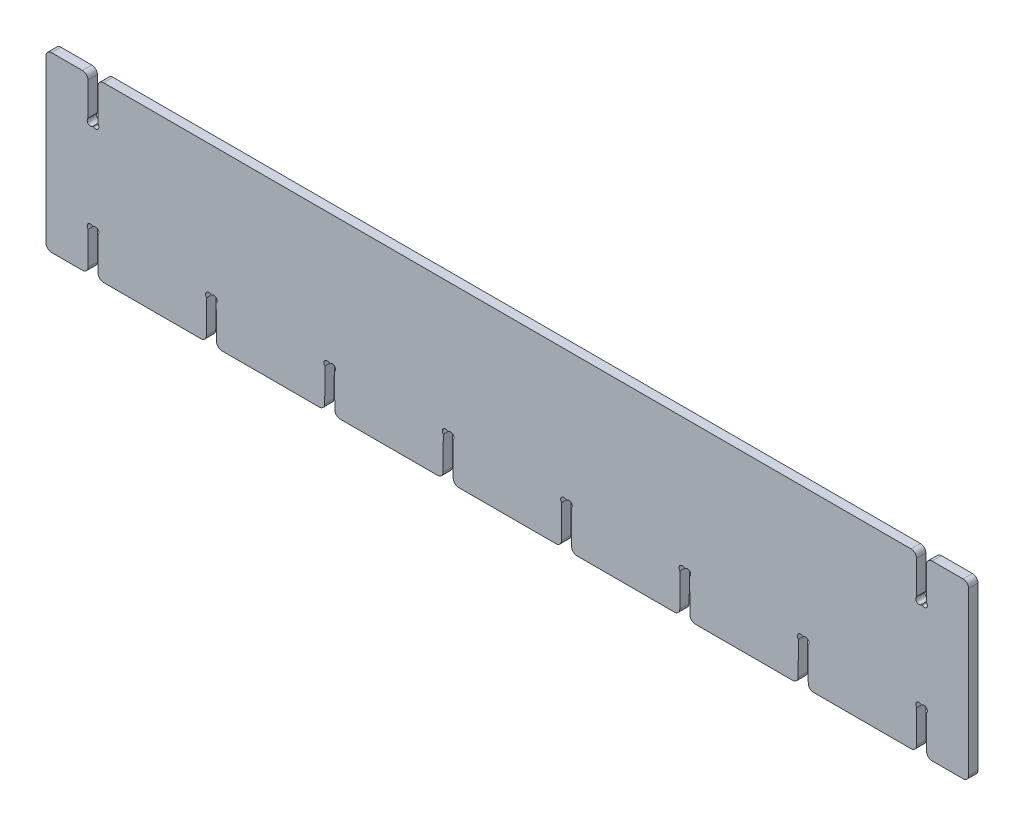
ISO-10303-21;
HEADER;
FILE_DESCRIPTION(('STEP AP214'),'2;1');
FILE_NAME('part.step','',(''),(''),'','','');
FILE_SCHEMA(('AUTOMOTIVE_DESIGN { 1 0 10303 214 1 1 1 1 }'));
ENDSEC;
DATA;
#1=APPLICATION_CONTEXT('core data for automotive mechanical design processes');
#2=APPLICATION_PROTOCOL_DEFINITION('international standard','automotive_design',2000,#1);
#3=PRODUCT_CONTEXT('',#1,'mechanical');
#4=PRODUCT('Part','Part','',(#3));
#5=PRODUCT_RELATED_PRODUCT_CATEGORY('part','',(#4));
#6=PRODUCT_DEFINITION_FORMATION('','',#4);
#7=PRODUCT_DEFINITION_CONTEXT('part definition',#1,'design');
#8=PRODUCT_DEFINITION('design','',#6,#7);
#9=PRODUCT_DEFINITION_SHAPE('','',#8);
#10=(LENGTH_UNIT() NAMED_UNIT(*) SI_UNIT(.MILLI.,.METRE.));
#11=(NAMED_UNIT(*) PLANE_ANGLE_UNIT() SI_UNIT($,.RADIAN.));
#12=(NAMED_UNIT(*) SI_UNIT($,.STERADIAN.) SOLID_ANGLE_UNIT());
#13=UNCERTAINTY_MEASURE_WITH_UNIT(LENGTH_MEASURE(1.E-05),#10,'distance_accuracy_value','');
#14=(GEOMETRIC_REPRESENTATION_CONTEXT(3) GLOBAL_UNCERTAINTY_ASSIGNED_CONTEXT((#13)) GLOBAL_UNIT_ASSIGNED_CONTEXT((#10,
#11,#12)) REPRESENTATION_CONTEXT('',''));
#15=CARTESIAN_POINT('',(0.,0.,0.));
#16=DIRECTION('',(0.,0.,1.));
#17=DIRECTION('',(1.,0.,0.));
#18=AXIS2_PLACEMENT_3D('',#15,#16,#17);
#19=CARTESIAN_POINT('',(0.,0.,12.));
#20=DIRECTION('',(0.,1.,0.));
#21=DIRECTION('',(0.,0.,1.));
#22=AXIS2_PLACEMENT_3D('',#19,#20,#21);
#23=PLANE('',#22);
#24=DIRECTION('',(1.,0.,0.));
#25=VECTOR('',#24,1.);
#26=CARTESIAN_POINT('',(0.,0.,12.));
#27=LINE('',#26,#25);
#28=CARTESIAN_POINT('',(375.449459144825,0.,12.));
#29=VERTEX_POINT('',#28);
#30=CARTESIAN_POINT('',(499.550540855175,0.,12.));
#31=VERTEX_POINT('',#30);
#32=EDGE_CURVE('E1673',#29,#31,#27,.T.);
#33=ORIENTED_EDGE('',*,*,#32,.F.);
#34=DIRECTION('',(0.,0.,1.));
#35=VECTOR('',#34,1.);
#36=CARTESIAN_POINT('',(375.449459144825,0.,12.));
#37=LINE('',#36,#35);
#38=CARTESIAN_POINT('',(375.449459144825,0.,0.));
#39=VERTEX_POINT('',#38);
#40=EDGE_CURVE('E1757',#29,#39,#37,.F.);
#41=ORIENTED_EDGE('',*,*,#40,.T.);
#42=DIRECTION('',(1.,0.,0.));
#43=VECTOR('',#42,1.);
#44=CARTESIAN_POINT('',(0.,0.,0.));
#45=LINE('',#44,#43);
#46=CARTESIAN_POINT('',(499.550540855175,0.,0.));
#47=VERTEX_POINT('',#46);
#48=EDGE_CURVE('E1683',#39,#47,#45,.T.);
#49=ORIENTED_EDGE('',*,*,#48,.T.);
#50=DIRECTION('',(0.,0.,1.));
#51=VECTOR('',#50,1.);
#52=CARTESIAN_POINT('',(499.550540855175,0.,12.));
#53=LINE('',#52,#51);
#54=EDGE_CURVE('E1754',#47,#31,#53,.T.);
#55=ORIENTED_EDGE('',*,*,#54,.T.);
#56=EDGE_LOOP('',(#33,#41,#49,#55));
#57=FACE_BOUND('',#56,.T.);
#58=ADVANCED_FACE('F33',(#57),#23,.F.);
#59=CARTESIAN_POINT('',(224.449459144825,0.,12.));
#60=VERTEX_POINT('',#59);
#61=CARTESIAN_POINT('',(348.550540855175,0.,12.));
#62=VERTEX_POINT('',#61);
#63=EDGE_CURVE('E1669',#60,#62,#27,.T.);
#64=ORIENTED_EDGE('',*,*,#63,.F.);
#65=DIRECTION('',(0.,0.,1.));
#66=VECTOR('',#65,1.);
#67=CARTESIAN_POINT('',(224.449459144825,0.,12.));
#68=LINE('',#67,#66);
#69=CARTESIAN_POINT('',(224.449459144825,0.,0.));
#70=VERTEX_POINT('',#69);
#71=EDGE_CURVE('E1765',#60,#70,#68,.F.);
#72=ORIENTED_EDGE('',*,*,#71,.T.);
#73=CARTESIAN_POINT('',(348.550540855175,0.,0.));
#74=VERTEX_POINT('',#73);
#75=EDGE_CURVE('E1865',#70,#74,#45,.T.);
#76=ORIENTED_EDGE('',*,*,#75,.T.);
#77=DIRECTION('',(0.,0.,1.));
#78=VECTOR('',#77,1.);
#79=CARTESIAN_POINT('',(348.550540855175,0.,12.));
#80=LINE('',#79,#78);
#81=EDGE_CURVE('E1762',#74,#62,#80,.T.);
#82=ORIENTED_EDGE('',*,*,#81,.T.);
#83=EDGE_LOOP('',(#64,#72,#76,#82));
#84=FACE_BOUND('',#83,.T.);
#85=ADVANCED_FACE('F1863',(#84),#23,.F.);
#86=CARTESIAN_POINT('',(73.4494591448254,0.,12.));
#87=VERTEX_POINT('',#86);
#88=CARTESIAN_POINT('',(197.550540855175,0.,12.));
#89=VERTEX_POINT('',#88);
#90=EDGE_CURVE('E1672',#87,#89,#27,.T.);
#91=ORIENTED_EDGE('',*,*,#90,.F.);
#92=DIRECTION('',(0.,0.,1.));
#93=VECTOR('',#92,1.);
#94=CARTESIAN_POINT('',(73.4494591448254,0.,12.));
#95=LINE('',#94,#93);
#96=CARTESIAN_POINT('',(73.4494591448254,0.,0.));
#97=VERTEX_POINT('',#96);
#98=EDGE_CURVE('E1745',#87,#97,#95,.F.);
#99=ORIENTED_EDGE('',*,*,#98,.T.);
#100=CARTESIAN_POINT('',(197.550540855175,0.,0.));
#101=VERTEX_POINT('',#100);
#102=EDGE_CURVE('E1878',#97,#101,#45,.T.);
#103=ORIENTED_EDGE('',*,*,#102,.T.);
#104=DIRECTION('',(0.,0.,1.));
#105=VECTOR('',#104,1.);
#106=CARTESIAN_POINT('',(197.550540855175,0.,12.));
#107=LINE('',#106,#105);
#108=EDGE_CURVE('E1742',#101,#89,#107,.T.);
#109=ORIENTED_EDGE('',*,*,#108,.T.);
#110=EDGE_LOOP('',(#91,#99,#103,#109));
#111=FACE_BOUND('',#110,.T.);
#112=ADVANCED_FACE('F1939',(#111),#23,.F.);
#113=CARTESIAN_POINT('',(0.,220.8,12.));
#114=DIRECTION('',(0.,-1.,0.));
#115=DIRECTION('',(0.,0.,-1.));
#116=AXIS2_PLACEMENT_3D('',#113,#114,#115);
#117=PLANE('',#116);
#118=DIRECTION('',(-1.,0.,0.));
#119=VECTOR('',#118,1.);
#120=CARTESIAN_POINT('',(0.,220.8,0.));
#121=LINE('',#120,#119);
#122=CARTESIAN_POINT('',(1103.55054085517,220.8,0.));
#123=VERTEX_POINT('',#122);
#124=CARTESIAN_POINT('',(73.4494591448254,220.8,0.));
#125=VERTEX_POINT('',#124);
#126=EDGE_CURVE('E1668',#123,#125,#121,.T.);
#127=ORIENTED_EDGE('',*,*,#126,.T.);
#128=DIRECTION('',(0.,0.,1.));
#129=VECTOR('',#128,1.);
#130=CARTESIAN_POINT('',(73.4494591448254,220.8,12.));
#131=LINE('',#130,#129);
#132=CARTESIAN_POINT('',(73.4494591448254,220.8,12.));
#133=VERTEX_POINT('',#132);
#134=EDGE_CURVE('E1677',#125,#133,#131,.T.);
#135=ORIENTED_EDGE('',*,*,#134,.T.);
#136=DIRECTION('',(-1.,0.,0.));
#137=VECTOR('',#136,1.);
#138=CARTESIAN_POINT('',(0.,220.8,12.));
#139=LINE('',#138,#137);
#140=CARTESIAN_POINT('',(1103.55054085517,220.8,12.));
#141=VERTEX_POINT('',#140);
#142=EDGE_CURVE('E1674',#141,#133,#139,.T.);
#143=ORIENTED_EDGE('',*,*,#142,.F.);
#144=DIRECTION('',(0.,0.,1.));
#145=VECTOR('',#144,1.);
#146=CARTESIAN_POINT('',(1103.55054085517,220.8,12.));
#147=LINE('',#146,#145);
#148=EDGE_CURVE('E1194',#123,#141,#147,.T.);
#149=ORIENTED_EDGE('',*,*,#148,.F.);
#150=EDGE_LOOP('',(#127,#135,#143,#149));
#151=FACE_BOUND('',#150,.T.);
#152=ADVANCED_FACE('F1959',(#151),#117,.F.);
#153=CARTESIAN_POINT('',(46.5505408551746,220.8,0.));
#154=VERTEX_POINT('',#153);
#155=CARTESIAN_POINT('',(7.,220.8,0.));
#156=VERTEX_POINT('',#155);
#157=EDGE_CURVE('E1687',#154,#156,#121,.T.);
#158=ORIENTED_EDGE('',*,*,#157,.T.);
#159=DIRECTION('',(0.,0.,-1.));
#160=VECTOR('',#159,1.);
#161=CARTESIAN_POINT('',(7.,220.8,12.));
#162=LINE('',#161,#160);
#163=CARTESIAN_POINT('',(7.,220.8,12.));
#164=VERTEX_POINT('',#163);
#165=EDGE_CURVE('E1774',#156,#164,#162,.F.);
#166=ORIENTED_EDGE('',*,*,#165,.T.);
#167=CARTESIAN_POINT('',(46.5505408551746,220.8,12.));
#168=VERTEX_POINT('',#167);
#169=EDGE_CURVE('E1678',#168,#164,#139,.T.);
#170=ORIENTED_EDGE('',*,*,#169,.F.);
#171=DIRECTION('',(0.,0.,1.));
#172=VECTOR('',#171,1.);
#173=CARTESIAN_POINT('',(46.5505408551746,220.8,0.));
#174=LINE('',#173,#172);
#175=EDGE_CURVE('E1772',#168,#154,#174,.F.);
#176=ORIENTED_EDGE('',*,*,#175,.T.);
#177=EDGE_LOOP('',(#158,#166,#170,#176));
#178=FACE_BOUND('',#177,.T.);
#179=ADVANCED_FACE('F1964',(#178),#117,.F.);
#180=CARTESIAN_POINT('',(0.,0.,12.));
#181=DIRECTION('',(0.,0.,-1.));
#182=DIRECTION('',(-1.,0.,0.));
#183=AXIS2_PLACEMENT_3D('',#180,#181,#182);
#184=PLANE('',#183);
#185=ORIENTED_EDGE('',*,*,#142,.T.);
#186=CARTESIAN_POINT('',(73.4494591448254,213.8,12.));
#187=DIRECTION('',(0.,0.,-1.));
#188=DIRECTION('',(-1.,0.,0.));
#189=AXIS2_PLACEMENT_3D('',#186,#187,#188);
#190=CIRCLE('',#189,7.);
#191=CARTESIAN_POINT('',(66.449642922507,213.850723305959,12.));
#192=VERTEX_POINT('',#191);
#193=EDGE_CURVE('E1712',#133,#192,#190,.F.);
#194=ORIENTED_EDGE('',*,*,#193,.T.);
#195=DIRECTION('',(-0.00724618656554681,-0.999973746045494,0.));
#196=VECTOR('',#195,1.);
#197=CARTESIAN_POINT('',(66.1470582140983,172.094033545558,12.));
#198=LINE('',#197,#196);
#199=CARTESIAN_POINT('',(66.1470582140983,172.094033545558,12.));
#200=VERTEX_POINT('',#199);
#201=EDGE_CURVE('E1536',#192,#200,#198,.T.);
#202=ORIENTED_EDGE('',*,*,#201,.T.);
#203=CARTESIAN_POINT('',(67.3470267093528,172.085338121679,12.));
#204=DIRECTION('',(0.,0.,1.));
#205=DIRECTION('',(1.,0.,0.));
#206=AXIS2_PLACEMENT_3D('',#203,#204,#205);
#207=CIRCLE('',#206,1.2);
#208=CARTESIAN_POINT('',(66.4380772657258,171.301877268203,12.));
#209=VERTEX_POINT('',#208);
#210=EDGE_CURVE('E1574',#200,#209,#207,.T.);
#211=ORIENTED_EDGE('',*,*,#210,.T.);
#212=CARTESIAN_POINT('',(63.3325,168.625052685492,12.));
#213=DIRECTION('',(0.,0.,-1.));
#214=DIRECTION('',(-1.,0.,0.));
#215=AXIS2_PLACEMENT_3D('',#212,#213,#214);
#216=CIRCLE('',#215,4.1);
#217=CARTESIAN_POINT('',(60.8571576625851,165.356615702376,12.));
#218=VERTEX_POINT('',#217);
#219=EDGE_CURVE('E1571',#209,#218,#216,.T.);
#220=ORIENTED_EDGE('',*,*,#219,.T.);
#221=CARTESIAN_POINT('',(60.1326672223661,164.4,12.));
#222=DIRECTION('',(0.,0.,1.));
#223=DIRECTION('',(-1.,0.,0.));
#224=AXIS2_PLACEMENT_3D('',#221,#222,#223);
#225=CIRCLE('',#224,1.2);
#226=CARTESIAN_POINT('',(60.1326672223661,165.6,12.));
#227=VERTEX_POINT('',#226);
#228=EDGE_CURVE('E1568',#218,#227,#225,.T.);
#229=ORIENTED_EDGE('',*,*,#228,.T.);
#230=DIRECTION('',(-1.,0.,0.));
#231=VECTOR('',#230,1.);
#232=CARTESIAN_POINT('',(59.8673327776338,165.6,12.));
#233=LINE('',#232,#231);
#234=CARTESIAN_POINT('',(59.8673327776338,165.6,12.));
#235=VERTEX_POINT('',#234);
#236=EDGE_CURVE('E1565',#227,#235,#233,.T.);
#237=ORIENTED_EDGE('',*,*,#236,.T.);
#238=CARTESIAN_POINT('',(59.8673327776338,164.4,12.));
#239=DIRECTION('',(0.,0.,1.));
#240=DIRECTION('',(1.,0.,0.));
#241=AXIS2_PLACEMENT_3D('',#238,#239,#240);
#242=CIRCLE('',#241,1.2);
#243=CARTESIAN_POINT('',(59.1428423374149,165.356615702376,12.));
#244=VERTEX_POINT('',#243);
#245=EDGE_CURVE('E1562',#235,#244,#242,.T.);
#246=ORIENTED_EDGE('',*,*,#245,.T.);
#247=CARTESIAN_POINT('',(56.6675,168.625052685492,12.));
#248=DIRECTION('',(0.,0.,-1.));
#249=DIRECTION('',(1.,0.,0.));
#250=AXIS2_PLACEMENT_3D('',#247,#248,#249);
#251=CIRCLE('',#250,4.1);
#252=CARTESIAN_POINT('',(53.5619227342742,171.301877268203,12.));
#253=VERTEX_POINT('',#252);
#254=EDGE_CURVE('E1559',#244,#253,#251,.T.);
#255=ORIENTED_EDGE('',*,*,#254,.T.);
#256=CARTESIAN_POINT('',(52.6529732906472,172.085338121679,12.));
#257=DIRECTION('',(0.,0.,1.));
#258=DIRECTION('',(-1.,0.,0.));
#259=AXIS2_PLACEMENT_3D('',#256,#257,#258);
#260=CIRCLE('',#259,1.19999999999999);
#261=CARTESIAN_POINT('',(53.8529417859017,172.094033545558,12.));
#262=VERTEX_POINT('',#261);
#263=EDGE_CURVE('E1556',#253,#262,#260,.T.);
#264=ORIENTED_EDGE('',*,*,#263,.T.);
#265=DIRECTION('',(-0.00724618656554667,0.999973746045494,0.));
#266=VECTOR('',#265,1.);
#267=CARTESIAN_POINT('',(53.8529417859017,172.094033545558,12.));
#268=LINE('',#267,#266);
#269=CARTESIAN_POINT('',(53.5503570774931,213.850723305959,12.));
#270=VERTEX_POINT('',#269);
#271=EDGE_CURVE('E1517',#262,#270,#268,.T.);
#272=ORIENTED_EDGE('',*,*,#271,.T.);
#273=CARTESIAN_POINT('',(46.5505408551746,213.8,12.));
#274=DIRECTION('',(0.,0.,-1.));
#275=DIRECTION('',(-1.,0.,0.));
#276=AXIS2_PLACEMENT_3D('',#273,#274,#275);
#277=CIRCLE('',#276,7.);
#278=EDGE_CURVE('E1700',#270,#168,#277,.F.);
#279=ORIENTED_EDGE('',*,*,#278,.T.);
#280=ORIENTED_EDGE('',*,*,#169,.T.);
#281=CARTESIAN_POINT('',(7.,213.8,12.));
#282=DIRECTION('',(0.,0.,-1.));
#283=DIRECTION('',(-1.,0.,0.));
#284=AXIS2_PLACEMENT_3D('',#281,#282,#283);
#285=CIRCLE('',#284,7.);
#286=CARTESIAN_POINT('',(0.,213.8,12.));
#287=VERTEX_POINT('',#286);
#288=EDGE_CURVE('E1702',#164,#287,#285,.F.);
#289=ORIENTED_EDGE('',*,*,#288,.T.);
#290=DIRECTION('',(0.,-1.,0.));
#291=VECTOR('',#290,1.);
#292=CARTESIAN_POINT('',(0.,0.,12.));
#293=LINE('',#292,#291);
#294=CARTESIAN_POINT('',(0.,7.,12.));
#295=VERTEX_POINT('',#294);
#296=EDGE_CURVE('E1664',#287,#295,#293,.T.);
#297=ORIENTED_EDGE('',*,*,#296,.T.);
#298=CARTESIAN_POINT('',(7.,7.,12.));
#299=DIRECTION('',(0.,0.,-1.));
#300=DIRECTION('',(-1.,0.,0.));
#301=AXIS2_PLACEMENT_3D('',#298,#299,#300);
#302=CIRCLE('',#301,7.);
#303=CARTESIAN_POINT('',(7.,0.,12.));
#304=VERTEX_POINT('',#303);
#305=EDGE_CURVE('E1690',#295,#304,#302,.F.);
#306=ORIENTED_EDGE('',*,*,#305,.T.);
#307=CARTESIAN_POINT('',(46.5505408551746,0.,12.));
#308=VERTEX_POINT('',#307);
#309=EDGE_CURVE('E1794',#304,#308,#27,.T.);
#310=ORIENTED_EDGE('',*,*,#309,.T.);
#311=CARTESIAN_POINT('',(46.5505408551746,7.,12.));
#312=DIRECTION('',(0.,0.,-1.));
#313=DIRECTION('',(-1.,0.,0.));
#314=AXIS2_PLACEMENT_3D('',#311,#312,#313);
#315=CIRCLE('',#314,7.);
#316=CARTESIAN_POINT('',(53.5503570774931,6.94927669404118,12.));
#317=VERTEX_POINT('',#316);
#318=EDGE_CURVE('E1692',#308,#317,#315,.F.);
#319=ORIENTED_EDGE('',*,*,#318,.T.);
#320=DIRECTION('',(-0.00724618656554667,-0.999973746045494,0.));
#321=VECTOR('',#320,1.);
#322=CARTESIAN_POINT('',(53.8529417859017,48.705966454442,12.));
#323=LINE('',#322,#321);
#324=CARTESIAN_POINT('',(53.8529417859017,48.705966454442,12.));
#325=VERTEX_POINT('',#324);
#326=EDGE_CURVE('E1598',#325,#317,#323,.T.);
#327=ORIENTED_EDGE('',*,*,#326,.F.);
#328=CARTESIAN_POINT('',(52.6529732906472,48.7146618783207,12.));
#329=DIRECTION('',(0.,0.,-1.));
#330=DIRECTION('',(-1.,0.,0.));
#331=AXIS2_PLACEMENT_3D('',#328,#329,#330);
#332=CIRCLE('',#331,1.19999999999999);
#333=CARTESIAN_POINT('',(53.5619227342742,49.4981227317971,12.));
#334=VERTEX_POINT('',#333);
#335=EDGE_CURVE('E1642',#334,#325,#332,.T.);
#336=ORIENTED_EDGE('',*,*,#335,.F.);
#337=CARTESIAN_POINT('',(56.6675,52.1749473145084,12.));
#338=DIRECTION('',(0.,0.,1.));
#339=DIRECTION('',(1.,0.,0.));
#340=AXIS2_PLACEMENT_3D('',#337,#338,#339);
#341=CIRCLE('',#340,4.1);
#342=CARTESIAN_POINT('',(59.1428423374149,55.4433842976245,12.));
#343=VERTEX_POINT('',#342);
#344=EDGE_CURVE('E1639',#343,#334,#341,.T.);
#345=ORIENTED_EDGE('',*,*,#344,.F.);
#346=CARTESIAN_POINT('',(59.8673327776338,56.4,12.));
#347=DIRECTION('',(0.,0.,-1.));
#348=DIRECTION('',(1.,0.,0.));
#349=AXIS2_PLACEMENT_3D('',#346,#347,#348);
#350=CIRCLE('',#349,1.2);
#351=CARTESIAN_POINT('',(59.8673327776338,55.2,12.));
#352=VERTEX_POINT('',#351);
#353=EDGE_CURVE('E1636',#352,#343,#350,.T.);
#354=ORIENTED_EDGE('',*,*,#353,.F.);
#355=DIRECTION('',(-1.,0.,0.));
#356=VECTOR('',#355,1.);
#357=CARTESIAN_POINT('',(59.8673327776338,55.2,12.));
#358=LINE('',#357,#356);
#359=CARTESIAN_POINT('',(60.1326672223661,55.2,12.));
#360=VERTEX_POINT('',#359);
#361=EDGE_CURVE('E1633',#360,#352,#358,.T.);
#362=ORIENTED_EDGE('',*,*,#361,.F.);
#363=CARTESIAN_POINT('',(60.1326672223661,56.4,12.));
#364=DIRECTION('',(0.,0.,-1.));
#365=DIRECTION('',(-1.,0.,0.));
#366=AXIS2_PLACEMENT_3D('',#363,#364,#365);
#367=CIRCLE('',#366,1.2);
#368=CARTESIAN_POINT('',(60.8571576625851,55.4433842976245,12.));
#369=VERTEX_POINT('',#368);
#370=EDGE_CURVE('E1630',#369,#360,#367,.T.);
#371=ORIENTED_EDGE('',*,*,#370,.F.);
#372=CARTESIAN_POINT('',(63.3325,52.1749473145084,12.));
#373=DIRECTION('',(0.,0.,1.));
#374=DIRECTION('',(-1.,0.,0.));
#375=AXIS2_PLACEMENT_3D('',#372,#373,#374);
#376=CIRCLE('',#375,4.1);
#377=CARTESIAN_POINT('',(66.4380772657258,49.4981227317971,12.));
#378=VERTEX_POINT('',#377);
#379=EDGE_CURVE('E1627',#378,#369,#376,.T.);
#380=ORIENTED_EDGE('',*,*,#379,.F.);
#381=CARTESIAN_POINT('',(67.3470267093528,48.7146618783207,12.));
#382=DIRECTION('',(0.,0.,-1.));
#383=DIRECTION('',(1.,0.,0.));
#384=AXIS2_PLACEMENT_3D('',#381,#382,#383);
#385=CIRCLE('',#384,1.2);
#386=CARTESIAN_POINT('',(66.1470582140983,48.705966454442,12.));
#387=VERTEX_POINT('',#386);
#388=EDGE_CURVE('E1624',#387,#378,#385,.T.);
#389=ORIENTED_EDGE('',*,*,#388,.F.);
#390=DIRECTION('',(-0.00724618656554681,0.999973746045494,0.));
#391=VECTOR('',#390,1.);
#392=CARTESIAN_POINT('',(66.1470582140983,48.705966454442,12.));
#393=LINE('',#392,#391);
#394=CARTESIAN_POINT('',(66.449642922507,6.94927669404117,12.));
#395=VERTEX_POINT('',#394);
#396=EDGE_CURVE('E1581',#395,#387,#393,.T.);
#397=ORIENTED_EDGE('',*,*,#396,.F.);
#398=CARTESIAN_POINT('',(73.4494591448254,7.,12.));
#399=DIRECTION('',(0.,0.,-1.));
#400=DIRECTION('',(-1.,0.,0.));
#401=AXIS2_PLACEMENT_3D('',#398,#399,#400);
#402=CIRCLE('',#401,7.);
#403=EDGE_CURVE('E1710',#395,#87,#402,.F.);
#404=ORIENTED_EDGE('',*,*,#403,.T.);
#405=ORIENTED_EDGE('',*,*,#90,.T.);
#406=CARTESIAN_POINT('',(197.550540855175,7.,12.));
#407=DIRECTION('',(0.,0.,-1.));
#408=DIRECTION('',(-1.,0.,0.));
#409=AXIS2_PLACEMENT_3D('',#406,#407,#408);
#410=CIRCLE('',#409,7.);
#411=CARTESIAN_POINT('',(204.550357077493,6.94927669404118,12.));
#412=VERTEX_POINT('',#411);
#413=EDGE_CURVE('E1694',#89,#412,#410,.F.);
#414=ORIENTED_EDGE('',*,*,#413,.T.);
#415=DIRECTION('',(-0.00724618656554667,-0.999973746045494,0.));
#416=VECTOR('',#415,1.);
#417=CARTESIAN_POINT('',(204.852941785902,48.705966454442,12.));
#418=LINE('',#417,#416);
#419=CARTESIAN_POINT('',(204.852941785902,48.705966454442,12.));
#420=VERTEX_POINT('',#419);
#421=EDGE_CURVE('E1466',#420,#412,#418,.T.);
#422=ORIENTED_EDGE('',*,*,#421,.F.);
#423=CARTESIAN_POINT('',(203.652973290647,48.7146618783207,12.));
#424=DIRECTION('',(0.,0.,-1.));
#425=DIRECTION('',(-1.,0.,0.));
#426=AXIS2_PLACEMENT_3D('',#423,#424,#425);
#427=CIRCLE('',#426,1.19999999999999);
#428=CARTESIAN_POINT('',(204.561922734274,49.4981227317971,12.));
#429=VERTEX_POINT('',#428);
#430=EDGE_CURVE('E1510',#429,#420,#427,.T.);
#431=ORIENTED_EDGE('',*,*,#430,.F.);
#432=CARTESIAN_POINT('',(207.6675,52.1749473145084,12.));
#433=DIRECTION('',(0.,0.,1.));
#434=DIRECTION('',(1.,0.,0.));
#435=AXIS2_PLACEMENT_3D('',#432,#433,#434);
#436=CIRCLE('',#435,4.1);
#437=CARTESIAN_POINT('',(210.142842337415,55.4433842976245,12.));
#438=VERTEX_POINT('',#437);
#439=EDGE_CURVE('E1507',#438,#429,#436,.T.);
#440=ORIENTED_EDGE('',*,*,#439,.F.);
#441=CARTESIAN_POINT('',(210.867332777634,56.4,12.));
#442=DIRECTION('',(0.,0.,-1.));
#443=DIRECTION('',(1.,0.,0.));
#444=AXIS2_PLACEMENT_3D('',#441,#442,#443);
#445=CIRCLE('',#444,1.2);
#446=CARTESIAN_POINT('',(210.867332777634,55.2,12.));
#447=VERTEX_POINT('',#446);
#448=EDGE_CURVE('E1504',#447,#438,#445,.T.);
#449=ORIENTED_EDGE('',*,*,#448,.F.);
#450=DIRECTION('',(-1.,0.,0.));
#451=VECTOR('',#450,1.);
#452=CARTESIAN_POINT('',(210.867332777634,55.2,12.));
#453=LINE('',#452,#451);
#454=CARTESIAN_POINT('',(211.132667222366,55.2,12.));
#455=VERTEX_POINT('',#454);
#456=EDGE_CURVE('E1501',#455,#447,#453,.T.);
#457=ORIENTED_EDGE('',*,*,#456,.F.);
#458=CARTESIAN_POINT('',(211.132667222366,56.4,12.));
#459=DIRECTION('',(0.,0.,-1.));
#460=DIRECTION('',(-1.,0.,0.));
#461=AXIS2_PLACEMENT_3D('',#458,#459,#460);
#462=CIRCLE('',#461,1.2);
#463=CARTESIAN_POINT('',(211.857157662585,55.4433842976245,12.));
#464=VERTEX_POINT('',#463);
#465=EDGE_CURVE('E1498',#464,#455,#462,.T.);
#466=ORIENTED_EDGE('',*,*,#465,.F.);
#467=CARTESIAN_POINT('',(214.3325,52.1749473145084,12.));
#468=DIRECTION('',(0.,0.,1.));
#469=DIRECTION('',(-1.,0.,0.));
#470=AXIS2_PLACEMENT_3D('',#467,#468,#469);
#471=CIRCLE('',#470,4.1);
#472=CARTESIAN_POINT('',(217.438077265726,49.4981227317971,12.));
#473=VERTEX_POINT('',#472);
#474=EDGE_CURVE('E1495',#473,#464,#471,.T.);
#475=ORIENTED_EDGE('',*,*,#474,.F.);
#476=CARTESIAN_POINT('',(218.347026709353,48.7146618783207,12.));
#477=DIRECTION('',(0.,0.,-1.));
#478=DIRECTION('',(1.,0.,0.));
#479=AXIS2_PLACEMENT_3D('',#476,#477,#478);
#480=CIRCLE('',#479,1.2);
#481=CARTESIAN_POINT('',(217.147058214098,48.705966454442,12.));
#482=VERTEX_POINT('',#481);
#483=EDGE_CURVE('E1492',#482,#473,#480,.T.);
#484=ORIENTED_EDGE('',*,*,#483,.F.);
#485=DIRECTION('',(-0.00724618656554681,0.999973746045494,0.));
#486=VECTOR('',#485,1.);
#487=CARTESIAN_POINT('',(217.147058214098,48.705966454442,12.));
#488=LINE('',#487,#486);
#489=CARTESIAN_POINT('',(217.449642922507,6.94927669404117,12.));
#490=VERTEX_POINT('',#489);
#491=EDGE_CURVE('E1448',#490,#482,#488,.T.);
#492=ORIENTED_EDGE('',*,*,#491,.F.);
#493=CARTESIAN_POINT('',(224.449459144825,7.,12.));
#494=DIRECTION('',(0.,0.,-1.));
#495=DIRECTION('',(-1.,0.,0.));
#496=AXIS2_PLACEMENT_3D('',#493,#494,#495);
#497=CIRCLE('',#496,7.);
#498=EDGE_CURVE('E1704',#490,#60,#497,.F.);
#499=ORIENTED_EDGE('',*,*,#498,.T.);
#500=ORIENTED_EDGE('',*,*,#63,.T.);
#501=CARTESIAN_POINT('',(348.550540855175,7.,12.));
#502=DIRECTION('',(0.,0.,-1.));
#503=DIRECTION('',(-1.,0.,0.));
#504=AXIS2_PLACEMENT_3D('',#501,#502,#503);
#505=CIRCLE('',#504,7.);
#506=CARTESIAN_POINT('',(355.550357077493,6.94927669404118,12.));
#507=VERTEX_POINT('',#506);
#508=EDGE_CURVE('E1696',#62,#507,#505,.F.);
#509=ORIENTED_EDGE('',*,*,#508,.T.);
#510=DIRECTION('',(-0.00724618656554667,-0.999973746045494,0.));
#511=VECTOR('',#510,1.);
#512=CARTESIAN_POINT('',(355.852941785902,48.705966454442,12.));
#513=LINE('',#512,#511);
#514=CARTESIAN_POINT('',(355.852941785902,48.705966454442,12.));
#515=VERTEX_POINT('',#514);
#516=EDGE_CURVE('E1397',#515,#507,#513,.T.);
#517=ORIENTED_EDGE('',*,*,#516,.F.);
#518=CARTESIAN_POINT('',(354.652973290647,48.7146618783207,12.));
#519=DIRECTION('',(0.,0.,-1.));
#520=DIRECTION('',(-1.,0.,0.));
#521=AXIS2_PLACEMENT_3D('',#518,#519,#520);
#522=CIRCLE('',#521,1.19999999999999);
#523=CARTESIAN_POINT('',(355.561922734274,49.4981227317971,12.));
#524=VERTEX_POINT('',#523);
#525=EDGE_CURVE('E1441',#524,#515,#522,.T.);
#526=ORIENTED_EDGE('',*,*,#525,.F.);
#527=CARTESIAN_POINT('',(358.6675,52.1749473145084,12.));
#528=DIRECTION('',(0.,0.,1.));
#529=DIRECTION('',(1.,0.,0.));
#530=AXIS2_PLACEMENT_3D('',#527,#528,#529);
#531=CIRCLE('',#530,4.1);
#532=CARTESIAN_POINT('',(361.142842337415,55.4433842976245,12.));
#533=VERTEX_POINT('',#532);
#534=EDGE_CURVE('E1438',#533,#524,#531,.T.);
#535=ORIENTED_EDGE('',*,*,#534,.F.);
#536=CARTESIAN_POINT('',(361.867332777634,56.4,12.));
#537=DIRECTION('',(0.,0.,-1.));
#538=DIRECTION('',(1.,0.,0.));
#539=AXIS2_PLACEMENT_3D('',#536,#537,#538);
#540=CIRCLE('',#539,1.2);
#541=CARTESIAN_POINT('',(361.867332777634,55.2,12.));
#542=VERTEX_POINT('',#541);
#543=EDGE_CURVE('E1435',#542,#533,#540,.T.);
#544=ORIENTED_EDGE('',*,*,#543,.F.);
#545=DIRECTION('',(-1.,0.,0.));
#546=VECTOR('',#545,1.);
#547=CARTESIAN_POINT('',(361.867332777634,55.2,12.));
#548=LINE('',#547,#546);
#549=CARTESIAN_POINT('',(362.132667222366,55.2,12.));
#550=VERTEX_POINT('',#549);
#551=EDGE_CURVE('E1432',#550,#542,#548,.T.);
#552=ORIENTED_EDGE('',*,*,#551,.F.);
#553=CARTESIAN_POINT('',(362.132667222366,56.4,12.));
#554=DIRECTION('',(0.,0.,-1.));
#555=DIRECTION('',(-1.,0.,0.));
#556=AXIS2_PLACEMENT_3D('',#553,#554,#555);
#557=CIRCLE('',#556,1.2);
#558=CARTESIAN_POINT('',(362.857157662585,55.4433842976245,12.));
#559=VERTEX_POINT('',#558);
#560=EDGE_CURVE('E1429',#559,#550,#557,.T.);
#561=ORIENTED_EDGE('',*,*,#560,.F.);
#562=CARTESIAN_POINT('',(365.3325,52.1749473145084,12.));
#563=DIRECTION('',(0.,0.,1.));
#564=DIRECTION('',(-1.,0.,0.));
#565=AXIS2_PLACEMENT_3D('',#562,#563,#564);
#566=CIRCLE('',#565,4.1);
#567=CARTESIAN_POINT('',(368.438077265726,49.4981227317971,12.));
#568=VERTEX_POINT('',#567);
#569=EDGE_CURVE('E1426',#568,#559,#566,.T.);
#570=ORIENTED_EDGE('',*,*,#569,.F.);
#571=CARTESIAN_POINT('',(369.347026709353,48.7146618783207,12.));
#572=DIRECTION('',(0.,0.,-1.));
#573=DIRECTION('',(1.,0.,0.));
#574=AXIS2_PLACEMENT_3D('',#571,#572,#573);
#575=CIRCLE('',#574,1.2);
#576=CARTESIAN_POINT('',(368.147058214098,48.705966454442,12.));
#577=VERTEX_POINT('',#576);
#578=EDGE_CURVE('E1423',#577,#568,#575,.T.);
#579=ORIENTED_EDGE('',*,*,#578,.F.);
#580=DIRECTION('',(-0.00724618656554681,0.999973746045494,0.));
#581=VECTOR('',#580,1.);
#582=CARTESIAN_POINT('',(368.147058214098,48.705966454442,12.));
#583=LINE('',#582,#581);
#584=CARTESIAN_POINT('',(368.449642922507,6.94927669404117,12.));
#585=VERTEX_POINT('',#584);
#586=EDGE_CURVE('E1379',#585,#577,#583,.T.);
#587=ORIENTED_EDGE('',*,*,#586,.F.);
#588=CARTESIAN_POINT('',(375.449459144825,7.,12.));
#589=DIRECTION('',(0.,0.,-1.));
#590=DIRECTION('',(-1.,0.,0.));
#591=AXIS2_PLACEMENT_3D('',#588,#589,#590);
#592=CIRCLE('',#591,7.);
#593=EDGE_CURVE('E1706',#585,#29,#592,.F.);
#594=ORIENTED_EDGE('',*,*,#593,.T.);
#595=ORIENTED_EDGE('',*,*,#32,.T.);
#596=CARTESIAN_POINT('',(499.550540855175,7.,12.));
#597=DIRECTION('',(0.,0.,-1.));
#598=DIRECTION('',(-1.,0.,0.));
#599=AXIS2_PLACEMENT_3D('',#596,#597,#598);
#600=CIRCLE('',#599,7.);
#601=CARTESIAN_POINT('',(506.550357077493,6.94927669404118,12.));
#602=VERTEX_POINT('',#601);
#603=EDGE_CURVE('E1698',#31,#602,#600,.F.);
#604=ORIENTED_EDGE('',*,*,#603,.T.);
#605=DIRECTION('',(-0.00724618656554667,-0.999973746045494,0.));
#606=VECTOR('',#605,1.);
#607=CARTESIAN_POINT('',(506.852941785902,48.705966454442,12.));
#608=LINE('',#607,#606);
#609=CARTESIAN_POINT('',(506.852941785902,48.705966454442,12.));
#610=VERTEX_POINT('',#609);
#611=EDGE_CURVE('E1328',#610,#602,#608,.T.);
#612=ORIENTED_EDGE('',*,*,#611,.F.);
#613=CARTESIAN_POINT('',(505.652973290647,48.7146618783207,12.));
#614=DIRECTION('',(0.,0.,-1.));
#615=DIRECTION('',(-1.,0.,0.));
#616=AXIS2_PLACEMENT_3D('',#613,#614,#615);
#617=CIRCLE('',#616,1.19999999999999);
#618=CARTESIAN_POINT('',(506.561922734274,49.4981227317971,12.));
#619=VERTEX_POINT('',#618);
#620=EDGE_CURVE('E1372',#619,#610,#617,.T.);
#621=ORIENTED_EDGE('',*,*,#620,.F.);
#622=CARTESIAN_POINT('',(509.6675,52.1749473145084,12.));
#623=DIRECTION('',(0.,0.,1.));
#624=DIRECTION('',(1.,0.,0.));
#625=AXIS2_PLACEMENT_3D('',#622,#623,#624);
#626=CIRCLE('',#625,4.1);
#627=CARTESIAN_POINT('',(512.142842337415,55.4433842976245,12.));
#628=VERTEX_POINT('',#627);
#629=EDGE_CURVE('E1369',#628,#619,#626,.T.);
#630=ORIENTED_EDGE('',*,*,#629,.F.);
#631=CARTESIAN_POINT('',(512.867332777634,56.4,12.));
#632=DIRECTION('',(0.,0.,-1.));
#633=DIRECTION('',(1.,0.,0.));
#634=AXIS2_PLACEMENT_3D('',#631,#632,#633);
#635=CIRCLE('',#634,1.2);
#636=CARTESIAN_POINT('',(512.867332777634,55.2,12.));
#637=VERTEX_POINT('',#636);
#638=EDGE_CURVE('E1366',#637,#628,#635,.T.);
#639=ORIENTED_EDGE('',*,*,#638,.F.);
#640=DIRECTION('',(-1.,0.,0.));
#641=VECTOR('',#640,1.);
#642=CARTESIAN_POINT('',(512.867332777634,55.2,12.));
#643=LINE('',#642,#641);
#644=CARTESIAN_POINT('',(513.132667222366,55.2,12.));
#645=VERTEX_POINT('',#644);
#646=EDGE_CURVE('E1363',#645,#637,#643,.T.);
#647=ORIENTED_EDGE('',*,*,#646,.F.);
#648=CARTESIAN_POINT('',(513.132667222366,56.4,12.));
#649=DIRECTION('',(0.,0.,-1.));
#650=DIRECTION('',(-1.,0.,0.));
#651=AXIS2_PLACEMENT_3D('',#648,#649,#650);
#652=CIRCLE('',#651,1.2);
#653=CARTESIAN_POINT('',(513.857157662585,55.4433842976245,12.));
#654=VERTEX_POINT('',#653);
#655=EDGE_CURVE('E1360',#654,#645,#652,.T.);
#656=ORIENTED_EDGE('',*,*,#655,.F.);
#657=CARTESIAN_POINT('',(516.3325,52.1749473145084,12.));
#658=DIRECTION('',(0.,0.,1.));
#659=DIRECTION('',(-1.,0.,0.));
#660=AXIS2_PLACEMENT_3D('',#657,#658,#659);
#661=CIRCLE('',#660,4.1);
#662=CARTESIAN_POINT('',(519.438077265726,49.4981227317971,12.));
#663=VERTEX_POINT('',#662);
#664=EDGE_CURVE('E1357',#663,#654,#661,.T.);
#665=ORIENTED_EDGE('',*,*,#664,.F.);
#666=CARTESIAN_POINT('',(520.347026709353,48.7146618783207,12.));
#667=DIRECTION('',(0.,0.,-1.));
#668=DIRECTION('',(1.,0.,0.));
#669=AXIS2_PLACEMENT_3D('',#666,#667,#668);
#670=CIRCLE('',#669,1.2);
#671=CARTESIAN_POINT('',(519.147058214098,48.705966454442,12.));
#672=VERTEX_POINT('',#671);
#673=EDGE_CURVE('E1354',#672,#663,#670,.T.);
#674=ORIENTED_EDGE('',*,*,#673,.F.);
#675=DIRECTION('',(-0.00724618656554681,0.999973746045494,0.));
#676=VECTOR('',#675,1.);
#677=CARTESIAN_POINT('',(519.147058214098,48.705966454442,12.));
#678=LINE('',#677,#676);
#679=CARTESIAN_POINT('',(519.449642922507,6.94927669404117,12.));
#680=VERTEX_POINT('',#679);
#681=EDGE_CURVE('E1324',#680,#672,#678,.T.);
#682=ORIENTED_EDGE('',*,*,#681,.F.);
#683=CARTESIAN_POINT('',(526.449459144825,7.,12.));
#684=DIRECTION('',(0.,0.,-1.));
#685=DIRECTION('',(-1.,0.,0.));
#686=AXIS2_PLACEMENT_3D('',#683,#684,#685);
#687=CIRCLE('',#686,7.);
#688=CARTESIAN_POINT('',(526.449459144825,0.,12.));
#689=VERTEX_POINT('',#688);
#690=EDGE_CURVE('E1708',#680,#689,#687,.F.);
#691=ORIENTED_EDGE('',*,*,#690,.T.);
#692=CARTESIAN_POINT('',(650.550540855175,0.,12.));
#693=VERTEX_POINT('',#692);
#694=EDGE_CURVE('E1667',#689,#693,#27,.T.);
#695=ORIENTED_EDGE('',*,*,#694,.T.);
#696=CARTESIAN_POINT('',(650.550540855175,7.,12.));
#697=DIRECTION('',(0.,0.,1.));
#698=DIRECTION('',(1.,0.,0.));
#699=AXIS2_PLACEMENT_3D('',#696,#697,#698);
#700=CIRCLE('',#699,7.);
#701=CARTESIAN_POINT('',(657.550357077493,6.94927669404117,12.));
#702=VERTEX_POINT('',#701);
#703=EDGE_CURVE('E1231',#702,#693,#700,.F.);
#704=ORIENTED_EDGE('',*,*,#703,.F.);
#705=DIRECTION('',(0.00724618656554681,0.999973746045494,0.));
#706=VECTOR('',#705,1.);
#707=CARTESIAN_POINT('',(657.852941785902,48.705966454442,12.));
#708=LINE('',#707,#706);
#709=CARTESIAN_POINT('',(657.852941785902,48.705966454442,12.));
#710=VERTEX_POINT('',#709);
#711=EDGE_CURVE('E865',#702,#710,#708,.T.);
#712=ORIENTED_EDGE('',*,*,#711,.T.);
#713=CARTESIAN_POINT('',(656.652973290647,48.7146618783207,12.));
#714=DIRECTION('',(0.,0.,1.));
#715=DIRECTION('',(-1.,0.,0.));
#716=AXIS2_PLACEMENT_3D('',#713,#714,#715);
#717=CIRCLE('',#716,1.2);
#718=CARTESIAN_POINT('',(657.561922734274,49.4981227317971,12.));
#719=VERTEX_POINT('',#718);
#720=EDGE_CURVE('E825',#710,#719,#717,.T.);
#721=ORIENTED_EDGE('',*,*,#720,.T.);
#722=CARTESIAN_POINT('',(660.6675,52.1749473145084,12.));
#723=DIRECTION('',(0.,0.,-1.));
#724=DIRECTION('',(1.,0.,0.));
#725=AXIS2_PLACEMENT_3D('',#722,#723,#724);
#726=CIRCLE('',#725,4.1);
#727=CARTESIAN_POINT('',(663.142842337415,55.4433842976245,12.));
#728=VERTEX_POINT('',#727);
#729=EDGE_CURVE('E868',#719,#728,#726,.T.);
#730=ORIENTED_EDGE('',*,*,#729,.T.);
#731=CARTESIAN_POINT('',(663.867332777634,56.4,12.));
#732=DIRECTION('',(0.,0.,1.));
#733=DIRECTION('',(1.,0.,0.));
#734=AXIS2_PLACEMENT_3D('',#731,#732,#733);
#735=CIRCLE('',#734,1.2);
#736=CARTESIAN_POINT('',(663.867332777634,55.2,12.));
#737=VERTEX_POINT('',#736);
#738=EDGE_CURVE('E871',#728,#737,#735,.T.);
#739=ORIENTED_EDGE('',*,*,#738,.T.);
#740=DIRECTION('',(1.,0.,0.));
#741=VECTOR('',#740,1.);
#742=CARTESIAN_POINT('',(664.132667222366,55.2,12.));
#743=LINE('',#742,#741);
#744=CARTESIAN_POINT('',(664.132667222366,55.2,12.));
#745=VERTEX_POINT('',#744);
#746=EDGE_CURVE('E874',#737,#745,#743,.T.);
#747=ORIENTED_EDGE('',*,*,#746,.T.);
#748=CARTESIAN_POINT('',(664.132667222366,56.4,12.));
#749=DIRECTION('',(0.,0.,1.));
#750=DIRECTION('',(-1.,0.,0.));
#751=AXIS2_PLACEMENT_3D('',#748,#749,#750);
#752=CIRCLE('',#751,1.2);
#753=CARTESIAN_POINT('',(664.857157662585,55.4433842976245,12.));
#754=VERTEX_POINT('',#753);
#755=EDGE_CURVE('E877',#745,#754,#752,.T.);
#756=ORIENTED_EDGE('',*,*,#755,.T.);
#757=CARTESIAN_POINT('',(667.3325,52.1749473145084,12.));
#758=DIRECTION('',(0.,0.,-1.));
#759=DIRECTION('',(-1.,0.,0.));
#760=AXIS2_PLACEMENT_3D('',#757,#758,#759);
#761=CIRCLE('',#760,4.1);
#762=CARTESIAN_POINT('',(670.438077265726,49.4981227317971,12.));
#763=VERTEX_POINT('',#762);
#764=EDGE_CURVE('E880',#754,#763,#761,.T.);
#765=ORIENTED_EDGE('',*,*,#764,.T.);
#766=CARTESIAN_POINT('',(671.347026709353,48.7146618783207,12.));
#767=DIRECTION('',(0.,0.,1.));
#768=DIRECTION('',(1.,0.,0.));
#769=AXIS2_PLACEMENT_3D('',#766,#767,#768);
#770=CIRCLE('',#769,1.19999999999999);
#771=CARTESIAN_POINT('',(670.147058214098,48.705966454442,12.));
#772=VERTEX_POINT('',#771);
#773=EDGE_CURVE('E883',#763,#772,#770,.T.);
#774=ORIENTED_EDGE('',*,*,#773,.T.);
#775=DIRECTION('',(0.00724618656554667,-0.999973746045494,0.));
#776=VECTOR('',#775,1.);
#777=CARTESIAN_POINT('',(670.147058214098,48.705966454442,12.));
#778=LINE('',#777,#776);
#779=CARTESIAN_POINT('',(670.449642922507,6.94927669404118,12.));
#780=VERTEX_POINT('',#779);
#781=EDGE_CURVE('E838',#772,#780,#778,.T.);
#782=ORIENTED_EDGE('',*,*,#781,.T.);
#783=CARTESIAN_POINT('',(677.449459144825,7.,12.));
#784=DIRECTION('',(0.,0.,1.));
#785=DIRECTION('',(1.,0.,0.));
#786=AXIS2_PLACEMENT_3D('',#783,#784,#785);
#787=CIRCLE('',#786,7.);
#788=CARTESIAN_POINT('',(677.449459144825,0.,12.));
#789=VERTEX_POINT('',#788);
#790=EDGE_CURVE('E1219',#789,#780,#787,.F.);
#791=ORIENTED_EDGE('',*,*,#790,.F.);
#792=DIRECTION('',(-1.,0.,0.));
#793=VECTOR('',#792,1.);
#794=CARTESIAN_POINT('',(1177.,0.,12.));
#795=LINE('',#794,#793);
#796=CARTESIAN_POINT('',(801.550540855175,0.,12.));
#797=VERTEX_POINT('',#796);
#798=EDGE_CURVE('E1185',#797,#789,#795,.T.);
#799=ORIENTED_EDGE('',*,*,#798,.F.);
#800=CARTESIAN_POINT('',(801.550540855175,7.,12.));
#801=DIRECTION('',(0.,0.,1.));
#802=DIRECTION('',(1.,0.,0.));
#803=AXIS2_PLACEMENT_3D('',#800,#801,#802);
#804=CIRCLE('',#803,7.);
#805=CARTESIAN_POINT('',(808.550357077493,6.94927669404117,12.));
#806=VERTEX_POINT('',#805);
#807=EDGE_CURVE('E1229',#806,#797,#804,.F.);
#808=ORIENTED_EDGE('',*,*,#807,.F.);
#809=DIRECTION('',(0.00724618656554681,0.999973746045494,0.));
#810=VECTOR('',#809,1.);
#811=CARTESIAN_POINT('',(808.852941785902,48.705966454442,12.));
#812=LINE('',#811,#810);
#813=CARTESIAN_POINT('',(808.852941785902,48.705966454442,12.));
#814=VERTEX_POINT('',#813);
#815=EDGE_CURVE('E890',#806,#814,#812,.T.);
#816=ORIENTED_EDGE('',*,*,#815,.T.);
#817=CARTESIAN_POINT('',(807.652973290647,48.7146618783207,12.));
#818=DIRECTION('',(0.,0.,1.));
#819=DIRECTION('',(-1.,0.,0.));
#820=AXIS2_PLACEMENT_3D('',#817,#818,#819);
#821=CIRCLE('',#820,1.2);
#822=CARTESIAN_POINT('',(808.561922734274,49.4981227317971,12.));
#823=VERTEX_POINT('',#822);
#824=EDGE_CURVE('E933',#814,#823,#821,.T.);
#825=ORIENTED_EDGE('',*,*,#824,.T.);
#826=CARTESIAN_POINT('',(811.6675,52.1749473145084,12.));
#827=DIRECTION('',(0.,0.,-1.));
#828=DIRECTION('',(1.,0.,0.));
#829=AXIS2_PLACEMENT_3D('',#826,#827,#828);
#830=CIRCLE('',#829,4.1);
#831=CARTESIAN_POINT('',(814.142842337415,55.4433842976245,12.));
#832=VERTEX_POINT('',#831);
#833=EDGE_CURVE('E936',#823,#832,#830,.T.);
#834=ORIENTED_EDGE('',*,*,#833,.T.);
#835=CARTESIAN_POINT('',(814.867332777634,56.4,12.));
#836=DIRECTION('',(0.,0.,1.));
#837=DIRECTION('',(1.,0.,0.));
#838=AXIS2_PLACEMENT_3D('',#835,#836,#837);
#839=CIRCLE('',#838,1.2);
#840=CARTESIAN_POINT('',(814.867332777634,55.2,12.));
#841=VERTEX_POINT('',#840);
#842=EDGE_CURVE('E939',#832,#841,#839,.T.);
#843=ORIENTED_EDGE('',*,*,#842,.T.);
#844=DIRECTION('',(1.,0.,0.));
#845=VECTOR('',#844,1.);
#846=CARTESIAN_POINT('',(815.132667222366,55.2,12.));
#847=LINE('',#846,#845);
#848=CARTESIAN_POINT('',(815.132667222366,55.2,12.));
#849=VERTEX_POINT('',#848);
#850=EDGE_CURVE('E942',#841,#849,#847,.T.);
#851=ORIENTED_EDGE('',*,*,#850,.T.);
#852=CARTESIAN_POINT('',(815.132667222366,56.4,12.));
#853=DIRECTION('',(0.,0.,1.));
#854=DIRECTION('',(-1.,0.,0.));
#855=AXIS2_PLACEMENT_3D('',#852,#853,#854);
#856=CIRCLE('',#855,1.2);
#857=CARTESIAN_POINT('',(815.857157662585,55.4433842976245,12.));
#858=VERTEX_POINT('',#857);
#859=EDGE_CURVE('E945',#849,#858,#856,.T.);
#860=ORIENTED_EDGE('',*,*,#859,.T.);
#861=CARTESIAN_POINT('',(818.3325,52.1749473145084,12.));
#862=DIRECTION('',(0.,0.,-1.));
#863=DIRECTION('',(-1.,0.,0.));
#864=AXIS2_PLACEMENT_3D('',#861,#862,#863);
#865=CIRCLE('',#864,4.1);
#866=CARTESIAN_POINT('',(821.438077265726,49.4981227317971,12.));
#867=VERTEX_POINT('',#866);
#868=EDGE_CURVE('E948',#858,#867,#865,.T.);
#869=ORIENTED_EDGE('',*,*,#868,.T.);
#870=CARTESIAN_POINT('',(822.347026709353,48.7146618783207,12.));
#871=DIRECTION('',(0.,0.,1.));
#872=DIRECTION('',(1.,0.,0.));
#873=AXIS2_PLACEMENT_3D('',#870,#871,#872);
#874=CIRCLE('',#873,1.19999999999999);
#875=CARTESIAN_POINT('',(821.147058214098,48.705966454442,12.));
#876=VERTEX_POINT('',#875);
#877=EDGE_CURVE('E951',#867,#876,#874,.T.);
#878=ORIENTED_EDGE('',*,*,#877,.T.);
#879=DIRECTION('',(0.00724618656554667,-0.999973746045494,0.));
#880=VECTOR('',#879,1.);
#881=CARTESIAN_POINT('',(821.147058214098,48.705966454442,12.));
#882=LINE('',#881,#880);
#883=CARTESIAN_POINT('',(821.449642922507,6.94927669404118,12.));
#884=VERTEX_POINT('',#883);
#885=EDGE_CURVE('E906',#876,#884,#882,.T.);
#886=ORIENTED_EDGE('',*,*,#885,.T.);
#887=CARTESIAN_POINT('',(828.449459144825,7.,12.));
#888=DIRECTION('',(0.,0.,1.));
#889=DIRECTION('',(1.,0.,0.));
#890=AXIS2_PLACEMENT_3D('',#887,#888,#889);
#891=CIRCLE('',#890,7.);
#892=CARTESIAN_POINT('',(828.449459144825,0.,12.));
#893=VERTEX_POINT('',#892);
#894=EDGE_CURVE('E1216',#893,#884,#891,.F.);
#895=ORIENTED_EDGE('',*,*,#894,.F.);
#896=CARTESIAN_POINT('',(952.550540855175,0.,12.));
#897=VERTEX_POINT('',#896);
#898=EDGE_CURVE('E1187',#897,#893,#795,.T.);
#899=ORIENTED_EDGE('',*,*,#898,.F.);
#900=CARTESIAN_POINT('',(952.550540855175,7.,12.));
#901=DIRECTION('',(0.,0.,1.));
#902=DIRECTION('',(1.,0.,0.));
#903=AXIS2_PLACEMENT_3D('',#900,#901,#902);
#904=CIRCLE('',#903,7.);
#905=CARTESIAN_POINT('',(959.550357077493,6.94927669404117,12.));
#906=VERTEX_POINT('',#905);
#907=EDGE_CURVE('E1227',#906,#897,#904,.F.);
#908=ORIENTED_EDGE('',*,*,#907,.F.);
#909=DIRECTION('',(0.00724618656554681,0.999973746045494,0.));
#910=VECTOR('',#909,1.);
#911=CARTESIAN_POINT('',(959.852941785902,48.705966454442,12.));
#912=LINE('',#911,#910);
#913=CARTESIAN_POINT('',(959.852941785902,48.705966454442,12.));
#914=VERTEX_POINT('',#913);
#915=EDGE_CURVE('E958',#906,#914,#912,.T.);
#916=ORIENTED_EDGE('',*,*,#915,.T.);
#917=CARTESIAN_POINT('',(958.652973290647,48.7146618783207,12.));
#918=DIRECTION('',(0.,0.,1.));
#919=DIRECTION('',(-1.,0.,0.));
#920=AXIS2_PLACEMENT_3D('',#917,#918,#919);
#921=CIRCLE('',#920,1.2);
#922=CARTESIAN_POINT('',(959.561922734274,49.4981227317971,12.));
#923=VERTEX_POINT('',#922);
#924=EDGE_CURVE('E1003',#914,#923,#921,.T.);
#925=ORIENTED_EDGE('',*,*,#924,.T.);
#926=CARTESIAN_POINT('',(962.6675,52.1749473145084,12.));
#927=DIRECTION('',(0.,0.,-1.));
#928=DIRECTION('',(1.,0.,0.));
#929=AXIS2_PLACEMENT_3D('',#926,#927,#928);
#930=CIRCLE('',#929,4.1);
#931=CARTESIAN_POINT('',(965.142842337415,55.4433842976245,12.));
#932=VERTEX_POINT('',#931);
#933=EDGE_CURVE('E1006',#923,#932,#930,.T.);
#934=ORIENTED_EDGE('',*,*,#933,.T.);
#935=CARTESIAN_POINT('',(965.867332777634,56.4,12.));
#936=DIRECTION('',(0.,0.,1.));
#937=DIRECTION('',(1.,0.,0.));
#938=AXIS2_PLACEMENT_3D('',#935,#936,#937);
#939=CIRCLE('',#938,1.2);
#940=CARTESIAN_POINT('',(965.867332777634,55.2,12.));
#941=VERTEX_POINT('',#940);
#942=EDGE_CURVE('E1009',#932,#941,#939,.T.);
#943=ORIENTED_EDGE('',*,*,#942,.T.);
#944=DIRECTION('',(1.,0.,0.));
#945=VECTOR('',#944,1.);
#946=CARTESIAN_POINT('',(966.132667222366,55.2,12.));
#947=LINE('',#946,#945);
#948=CARTESIAN_POINT('',(966.132667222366,55.2,12.));
#949=VERTEX_POINT('',#948);
#950=EDGE_CURVE('E1012',#941,#949,#947,.T.);
#951=ORIENTED_EDGE('',*,*,#950,.T.);
#952=CARTESIAN_POINT('',(966.132667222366,56.4,12.));
#953=DIRECTION('',(0.,0.,1.));
#954=DIRECTION('',(-1.,0.,0.));
#955=AXIS2_PLACEMENT_3D('',#952,#953,#954);
#956=CIRCLE('',#955,1.2);
#957=CARTESIAN_POINT('',(966.857157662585,55.4433842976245,12.));
#958=VERTEX_POINT('',#957);
#959=EDGE_CURVE('E1015',#949,#958,#956,.T.);
#960=ORIENTED_EDGE('',*,*,#959,.T.);
#961=CARTESIAN_POINT('',(969.3325,52.1749473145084,12.));
#962=DIRECTION('',(0.,0.,-1.));
#963=DIRECTION('',(-1.,0.,0.));
#964=AXIS2_PLACEMENT_3D('',#961,#962,#963);
#965=CIRCLE('',#964,4.1);
#966=CARTESIAN_POINT('',(972.438077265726,49.4981227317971,12.));
#967=VERTEX_POINT('',#966);
#968=EDGE_CURVE('E1018',#958,#967,#965,.T.);
#969=ORIENTED_EDGE('',*,*,#968,.T.);
#970=CARTESIAN_POINT('',(973.347026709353,48.7146618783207,12.));
#971=DIRECTION('',(0.,0.,1.));
#972=DIRECTION('',(1.,0.,0.));
#973=AXIS2_PLACEMENT_3D('',#970,#971,#972);
#974=CIRCLE('',#973,1.19999999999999);
#975=CARTESIAN_POINT('',(972.147058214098,48.705966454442,12.));
#976=VERTEX_POINT('',#975);
#977=EDGE_CURVE('E1021',#967,#976,#974,.T.);
#978=ORIENTED_EDGE('',*,*,#977,.T.);
#979=DIRECTION('',(0.00724618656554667,-0.999973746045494,0.));
#980=VECTOR('',#979,1.);
#981=CARTESIAN_POINT('',(972.147058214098,48.705966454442,12.));
#982=LINE('',#981,#980);
#983=CARTESIAN_POINT('',(972.449642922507,6.94927669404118,12.));
#984=VERTEX_POINT('',#983);
#985=EDGE_CURVE('E976',#976,#984,#982,.T.);
#986=ORIENTED_EDGE('',*,*,#985,.T.);
#987=CARTESIAN_POINT('',(979.449459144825,7.,12.));
#988=DIRECTION('',(0.,0.,1.));
#989=DIRECTION('',(1.,0.,0.));
#990=AXIS2_PLACEMENT_3D('',#987,#988,#989);
#991=CIRCLE('',#990,7.);
#992=CARTESIAN_POINT('',(979.449459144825,0.,12.));
#993=VERTEX_POINT('',#992);
#994=EDGE_CURVE('E1213',#993,#984,#991,.F.);
#995=ORIENTED_EDGE('',*,*,#994,.F.);
#996=CARTESIAN_POINT('',(1103.55054085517,0.,12.));
#997=VERTEX_POINT('',#996);
#998=EDGE_CURVE('E1190',#997,#993,#795,.T.);
#999=ORIENTED_EDGE('',*,*,#998,.F.);
#1000=CARTESIAN_POINT('',(1103.55054085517,7.,12.));
#1001=DIRECTION('',(0.,0.,1.));
#1002=DIRECTION('',(1.,0.,0.));
#1003=AXIS2_PLACEMENT_3D('',#1000,#1001,#1002);
#1004=CIRCLE('',#1003,7.);
#1005=CARTESIAN_POINT('',(1110.55035707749,6.94927669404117,12.));
#1006=VERTEX_POINT('',#1005);
#1007=EDGE_CURVE('E1234',#1006,#997,#1004,.F.);
#1008=ORIENTED_EDGE('',*,*,#1007,.F.);
#1009=DIRECTION('',(0.00724618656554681,0.999973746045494,0.));
#1010=VECTOR('',#1009,1.);
#1011=CARTESIAN_POINT('',(1110.8529417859,48.705966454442,12.));
#1012=LINE('',#1011,#1010);
#1013=CARTESIAN_POINT('',(1110.8529417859,48.705966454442,12.));
#1014=VERTEX_POINT('',#1013);
#1015=EDGE_CURVE('E1098',#1006,#1014,#1012,.T.);
#1016=ORIENTED_EDGE('',*,*,#1015,.T.);
#1017=CARTESIAN_POINT('',(1109.65297329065,48.7146618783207,12.));
#1018=DIRECTION('',(0.,0.,1.));
#1019=DIRECTION('',(-1.,0.,0.));
#1020=AXIS2_PLACEMENT_3D('',#1017,#1018,#1019);
#1021=CIRCLE('',#1020,1.2);
#1022=CARTESIAN_POINT('',(1110.56192273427,49.4981227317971,12.));
#1023=VERTEX_POINT('',#1022);
#1024=EDGE_CURVE('E1143',#1014,#1023,#1021,.T.);
#1025=ORIENTED_EDGE('',*,*,#1024,.T.);
#1026=CARTESIAN_POINT('',(1113.6675,52.1749473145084,12.));
#1027=DIRECTION('',(0.,0.,-1.));
#1028=DIRECTION('',(1.,0.,0.));
#1029=AXIS2_PLACEMENT_3D('',#1026,#1027,#1028);
#1030=CIRCLE('',#1029,4.1);
#1031=CARTESIAN_POINT('',(1116.14284233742,55.4433842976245,12.));
#1032=VERTEX_POINT('',#1031);
#1033=EDGE_CURVE('E1146',#1023,#1032,#1030,.T.);
#1034=ORIENTED_EDGE('',*,*,#1033,.T.);
#1035=CARTESIAN_POINT('',(1116.86733277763,56.4,12.));
#1036=DIRECTION('',(0.,0.,1.));
#1037=DIRECTION('',(1.,0.,0.));
#1038=AXIS2_PLACEMENT_3D('',#1035,#1036,#1037);
#1039=CIRCLE('',#1038,1.2);
#1040=CARTESIAN_POINT('',(1116.86733277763,55.2,12.));
#1041=VERTEX_POINT('',#1040);
#1042=EDGE_CURVE('E1149',#1032,#1041,#1039,.T.);
#1043=ORIENTED_EDGE('',*,*,#1042,.T.);
#1044=DIRECTION('',(1.,0.,0.));
#1045=VECTOR('',#1044,1.);
#1046=CARTESIAN_POINT('',(1117.13266722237,55.2,12.));
#1047=LINE('',#1046,#1045);
#1048=CARTESIAN_POINT('',(1117.13266722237,55.2,12.));
#1049=VERTEX_POINT('',#1048);
#1050=EDGE_CURVE('E1152',#1041,#1049,#1047,.T.);
#1051=ORIENTED_EDGE('',*,*,#1050,.T.);
#1052=CARTESIAN_POINT('',(1117.13266722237,56.4,12.));
#1053=DIRECTION('',(0.,0.,1.));
#1054=DIRECTION('',(-1.,0.,0.));
#1055=AXIS2_PLACEMENT_3D('',#1052,#1053,#1054);
#1056=CIRCLE('',#1055,1.2);
#1057=CARTESIAN_POINT('',(1117.85715766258,55.4433842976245,12.));
#1058=VERTEX_POINT('',#1057);
#1059=EDGE_CURVE('E1155',#1049,#1058,#1056,.T.);
#1060=ORIENTED_EDGE('',*,*,#1059,.T.);
#1061=CARTESIAN_POINT('',(1120.3325,52.1749473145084,12.));
#1062=DIRECTION('',(0.,0.,-1.));
#1063=DIRECTION('',(-1.,0.,0.));
#1064=AXIS2_PLACEMENT_3D('',#1061,#1062,#1063);
#1065=CIRCLE('',#1064,4.1);
#1066=CARTESIAN_POINT('',(1123.43807726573,49.4981227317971,12.));
#1067=VERTEX_POINT('',#1066);
#1068=EDGE_CURVE('E1158',#1058,#1067,#1065,.T.);
#1069=ORIENTED_EDGE('',*,*,#1068,.T.);
#1070=CARTESIAN_POINT('',(1124.34702670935,48.7146618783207,12.));
#1071=DIRECTION('',(0.,0.,1.));
#1072=DIRECTION('',(1.,0.,0.));
#1073=AXIS2_PLACEMENT_3D('',#1070,#1071,#1072);
#1074=CIRCLE('',#1073,1.19999999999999);
#1075=CARTESIAN_POINT('',(1123.1470582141,48.705966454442,12.));
#1076=VERTEX_POINT('',#1075);
#1077=EDGE_CURVE('E1161',#1067,#1076,#1074,.T.);
#1078=ORIENTED_EDGE('',*,*,#1077,.T.);
#1079=DIRECTION('',(0.00724618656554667,-0.999973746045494,0.));
#1080=VECTOR('',#1079,1.);
#1081=CARTESIAN_POINT('',(1123.1470582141,48.705966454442,12.));
#1082=LINE('',#1081,#1080);
#1083=CARTESIAN_POINT('',(1123.44964292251,6.94927669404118,12.));
#1084=VERTEX_POINT('',#1083);
#1085=EDGE_CURVE('E1116',#1076,#1084,#1082,.T.);
#1086=ORIENTED_EDGE('',*,*,#1085,.T.);
#1087=CARTESIAN_POINT('',(1130.44945914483,7.,12.));
#1088=DIRECTION('',(0.,0.,1.));
#1089=DIRECTION('',(1.,0.,0.));
#1090=AXIS2_PLACEMENT_3D('',#1087,#1088,#1089);
#1091=CIRCLE('',#1090,7.);
#1092=CARTESIAN_POINT('',(1130.44945914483,0.,12.));
#1093=VERTEX_POINT('',#1092);
#1094=EDGE_CURVE('E1210',#1093,#1084,#1091,.F.);
#1095=ORIENTED_EDGE('',*,*,#1094,.F.);
#1096=CARTESIAN_POINT('',(1170.,0.,12.));
#1097=VERTEX_POINT('',#1096);
#1098=EDGE_CURVE('E1195',#1097,#1093,#795,.T.);
#1099=ORIENTED_EDGE('',*,*,#1098,.F.);
#1100=CARTESIAN_POINT('',(1170.,7.,12.));
#1101=DIRECTION('',(0.,0.,1.));
#1102=DIRECTION('',(1.,0.,0.));
#1103=AXIS2_PLACEMENT_3D('',#1100,#1101,#1102);
#1104=CIRCLE('',#1103,7.);
#1105=CARTESIAN_POINT('',(1177.,7.,12.));
#1106=VERTEX_POINT('',#1105);
#1107=EDGE_CURVE('E1207',#1106,#1097,#1104,.F.);
#1108=ORIENTED_EDGE('',*,*,#1107,.F.);
#1109=DIRECTION('',(0.,-1.,0.));
#1110=VECTOR('',#1109,1.);
#1111=CARTESIAN_POINT('',(1177.,0.,12.));
#1112=LINE('',#1111,#1110);
#1113=CARTESIAN_POINT('',(1177.,213.8,12.));
#1114=VERTEX_POINT('',#1113);
#1115=EDGE_CURVE('E1182',#1114,#1106,#1112,.T.);
#1116=ORIENTED_EDGE('',*,*,#1115,.F.);
#1117=CARTESIAN_POINT('',(1170.,213.8,12.));
#1118=DIRECTION('',(0.,0.,1.));
#1119=DIRECTION('',(1.,0.,0.));
#1120=AXIS2_PLACEMENT_3D('',#1117,#1118,#1119);
#1121=CIRCLE('',#1120,7.);
#1122=CARTESIAN_POINT('',(1170.,220.8,12.));
#1123=VERTEX_POINT('',#1122);
#1124=EDGE_CURVE('E1224',#1123,#1114,#1121,.F.);
#1125=ORIENTED_EDGE('',*,*,#1124,.F.);
#1126=DIRECTION('',(1.,0.,0.));
#1127=VECTOR('',#1126,1.);
#1128=CARTESIAN_POINT('',(1177.,220.8,12.));
#1129=LINE('',#1128,#1127);
#1130=CARTESIAN_POINT('',(1130.44945914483,220.8,12.));
#1131=VERTEX_POINT('',#1130);
#1132=EDGE_CURVE('E1191',#1131,#1123,#1129,.T.);
#1133=ORIENTED_EDGE('',*,*,#1132,.F.);
#1134=CARTESIAN_POINT('',(1130.44945914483,213.8,12.));
#1135=DIRECTION('',(0.,0.,1.));
#1136=DIRECTION('',(1.,0.,0.));
#1137=AXIS2_PLACEMENT_3D('',#1134,#1135,#1136);
#1138=CIRCLE('',#1137,7.);
#1139=CARTESIAN_POINT('',(1123.44964292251,213.850723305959,12.));
#1140=VERTEX_POINT('',#1139);
#1141=EDGE_CURVE('E1222',#1140,#1131,#1138,.F.);
#1142=ORIENTED_EDGE('',*,*,#1141,.F.);
#1143=DIRECTION('',(0.00724618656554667,0.999973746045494,0.));
#1144=VECTOR('',#1143,1.);
#1145=CARTESIAN_POINT('',(1123.1470582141,172.094033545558,12.));
#1146=LINE('',#1145,#1144);
#1147=CARTESIAN_POINT('',(1123.1470582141,172.094033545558,12.));
#1148=VERTEX_POINT('',#1147);
#1149=EDGE_CURVE('E1028',#1148,#1140,#1146,.T.);
#1150=ORIENTED_EDGE('',*,*,#1149,.F.);
#1151=CARTESIAN_POINT('',(1124.34702670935,172.085338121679,12.));
#1152=DIRECTION('',(0.,0.,-1.));
#1153=DIRECTION('',(1.,0.,0.));
#1154=AXIS2_PLACEMENT_3D('',#1151,#1152,#1153);
#1155=CIRCLE('',#1154,1.19999999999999);
#1156=CARTESIAN_POINT('',(1123.43807726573,171.301877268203,12.));
#1157=VERTEX_POINT('',#1156);
#1158=EDGE_CURVE('E1073',#1157,#1148,#1155,.T.);
#1159=ORIENTED_EDGE('',*,*,#1158,.F.);
#1160=CARTESIAN_POINT('',(1120.3325,168.625052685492,12.));
#1161=DIRECTION('',(0.,0.,1.));
#1162=DIRECTION('',(-1.,0.,0.));
#1163=AXIS2_PLACEMENT_3D('',#1160,#1161,#1162);
#1164=CIRCLE('',#1163,4.1);
#1165=CARTESIAN_POINT('',(1117.85715766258,165.356615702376,12.));
#1166=VERTEX_POINT('',#1165);
#1167=EDGE_CURVE('E1076',#1166,#1157,#1164,.T.);
#1168=ORIENTED_EDGE('',*,*,#1167,.F.);
#1169=CARTESIAN_POINT('',(1117.13266722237,164.4,12.));
#1170=DIRECTION('',(0.,0.,-1.));
#1171=DIRECTION('',(-1.,0.,0.));
#1172=AXIS2_PLACEMENT_3D('',#1169,#1170,#1171);
#1173=CIRCLE('',#1172,1.2);
#1174=CARTESIAN_POINT('',(1117.13266722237,165.6,12.));
#1175=VERTEX_POINT('',#1174);
#1176=EDGE_CURVE('E1079',#1175,#1166,#1173,.T.);
#1177=ORIENTED_EDGE('',*,*,#1176,.F.);
#1178=DIRECTION('',(1.,0.,0.));
#1179=VECTOR('',#1178,1.);
#1180=CARTESIAN_POINT('',(1117.13266722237,165.6,12.));
#1181=LINE('',#1180,#1179);
#1182=CARTESIAN_POINT('',(1116.86733277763,165.6,12.));
#1183=VERTEX_POINT('',#1182);
#1184=EDGE_CURVE('E1082',#1183,#1175,#1181,.T.);
#1185=ORIENTED_EDGE('',*,*,#1184,.F.);
#1186=CARTESIAN_POINT('',(1116.86733277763,164.4,12.));
#1187=DIRECTION('',(0.,0.,-1.));
#1188=DIRECTION('',(1.,0.,0.));
#1189=AXIS2_PLACEMENT_3D('',#1186,#1187,#1188);
#1190=CIRCLE('',#1189,1.2);
#1191=CARTESIAN_POINT('',(1116.14284233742,165.356615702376,12.));
#1192=VERTEX_POINT('',#1191);
#1193=EDGE_CURVE('E1085',#1192,#1183,#1190,.T.);
#1194=ORIENTED_EDGE('',*,*,#1193,.F.);
#1195=CARTESIAN_POINT('',(1113.6675,168.625052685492,12.));
#1196=DIRECTION('',(0.,0.,1.));
#1197=DIRECTION('',(1.,0.,0.));
#1198=AXIS2_PLACEMENT_3D('',#1195,#1196,#1197);
#1199=CIRCLE('',#1198,4.1);
#1200=CARTESIAN_POINT('',(1110.56192273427,171.301877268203,12.));
#1201=VERTEX_POINT('',#1200);
#1202=EDGE_CURVE('E1088',#1201,#1192,#1199,.T.);
#1203=ORIENTED_EDGE('',*,*,#1202,.F.);
#1204=CARTESIAN_POINT('',(1109.65297329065,172.085338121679,12.));
#1205=DIRECTION('',(0.,0.,-1.));
#1206=DIRECTION('',(-1.,0.,0.));
#1207=AXIS2_PLACEMENT_3D('',#1204,#1205,#1206);
#1208=CIRCLE('',#1207,1.2);
#1209=CARTESIAN_POINT('',(1110.8529417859,172.094033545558,12.));
#1210=VERTEX_POINT('',#1209);
#1211=EDGE_CURVE('E1091',#1210,#1201,#1208,.T.);
#1212=ORIENTED_EDGE('',*,*,#1211,.F.);
#1213=DIRECTION('',(0.00724618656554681,-0.999973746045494,0.));
#1214=VECTOR('',#1213,1.);
#1215=CARTESIAN_POINT('',(1110.8529417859,172.094033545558,12.));
#1216=LINE('',#1215,#1214);
#1217=CARTESIAN_POINT('',(1110.55035707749,213.850723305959,12.));
#1218=VERTEX_POINT('',#1217);
#1219=EDGE_CURVE('E1046',#1218,#1210,#1216,.T.);
#1220=ORIENTED_EDGE('',*,*,#1219,.F.);
#1221=CARTESIAN_POINT('',(1103.55054085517,213.8,12.));
#1222=DIRECTION('',(0.,0.,1.));
#1223=DIRECTION('',(1.,0.,0.));
#1224=AXIS2_PLACEMENT_3D('',#1221,#1222,#1223);
#1225=CIRCLE('',#1224,7.);
#1226=EDGE_CURVE('E1236',#141,#1218,#1225,.F.);
#1227=ORIENTED_EDGE('',*,*,#1226,.F.);
#1228=EDGE_LOOP('',(#185,#194,#202,#211,#220,#229,#237,#246,#255,#264,#272,#279,#280,#289,#297,
#306,#310,#319,#327,#336,#345,#354,#362,#371,#380,#389,#397,#404,#405,#414,#422,#431,#440,#449,
#457,#466,#475,#484,#492,#499,#500,#509,#517,#526,#535,#544,#552,#561,#570,#579,#587,#594,#595,
#604,#612,#621,#630,#639,#647,#656,#665,#674,#682,#691,#695,#704,#712,#721,#730,#739,#747,#756,
#765,#774,#782,#791,#799,#808,#816,#825,#834,#843,#851,#860,#869,#878,#886,#895,#899,#908,#916,
#925,#934,#943,#951,#960,#969,#978,#986,#995,#999,#1008,#1016,#1025,#1034,#1043,#1051,#1060,
#1069,#1078,#1086,#1095,#1099,#1108,#1116,#1125,#1133,#1142,#1150,#1159,#1168,#1177,#1185,#1194,
#1203,#1212,#1220,#1227));
#1229=FACE_BOUND('',#1228,.T.);
#1230=ADVANCED_FACE('F1800',(#1229),#184,.F.);
#1231=CARTESIAN_POINT('',(0.,0.,0.));
#1232=DIRECTION('',(0.,0.,-1.));
#1233=DIRECTION('',(-1.,0.,0.));
#1234=AXIS2_PLACEMENT_3D('',#1231,#1232,#1233);
#1235=PLANE('',#1234);
#1236=DIRECTION('',(-0.00724618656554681,-0.999973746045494,0.));
#1237=VECTOR('',#1236,1.);
#1238=CARTESIAN_POINT('',(66.1470582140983,172.094033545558,0.));
#1239=LINE('',#1238,#1237);
#1240=CARTESIAN_POINT('',(66.449642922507,213.850723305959,0.));
#1241=VERTEX_POINT('',#1240);
#1242=CARTESIAN_POINT('',(66.1470582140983,172.094033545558,0.));
#1243=VERTEX_POINT('',#1242);
#1244=EDGE_CURVE('E1551',#1241,#1243,#1239,.T.);
#1245=ORIENTED_EDGE('',*,*,#1244,.F.);
#1246=CARTESIAN_POINT('',(73.4494591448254,213.8,0.));
#1247=DIRECTION('',(0.,0.,-1.));
#1248=DIRECTION('',(-1.,0.,0.));
#1249=AXIS2_PLACEMENT_3D('',#1246,#1247,#1248);
#1250=CIRCLE('',#1249,7.);
#1251=EDGE_CURVE('E1737',#1241,#125,#1250,.T.);
#1252=ORIENTED_EDGE('',*,*,#1251,.T.);
#1253=ORIENTED_EDGE('',*,*,#126,.F.);
#1254=CARTESIAN_POINT('',(1103.55054085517,213.8,0.));
#1255=DIRECTION('',(0.,0.,1.));
#1256=DIRECTION('',(1.,0.,0.));
#1257=AXIS2_PLACEMENT_3D('',#1254,#1255,#1256);
#1258=CIRCLE('',#1257,7.);
#1259=CARTESIAN_POINT('',(1110.55035707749,213.850723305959,0.));
#1260=VERTEX_POINT('',#1259);
#1261=EDGE_CURVE('E1269',#1260,#123,#1258,.T.);
#1262=ORIENTED_EDGE('',*,*,#1261,.F.);
#1263=DIRECTION('',(0.00724618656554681,-0.999973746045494,0.));
#1264=VECTOR('',#1263,1.);
#1265=CARTESIAN_POINT('',(1110.8529417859,172.094033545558,0.));
#1266=LINE('',#1265,#1264);
#1267=CARTESIAN_POINT('',(1110.8529417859,172.094033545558,0.));
#1268=VERTEX_POINT('',#1267);
#1269=EDGE_CURVE('E1067',#1260,#1268,#1266,.T.);
#1270=ORIENTED_EDGE('',*,*,#1269,.T.);
#1271=CARTESIAN_POINT('',(1109.65297329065,172.085338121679,0.));
#1272=DIRECTION('',(0.,0.,-1.));
#1273=DIRECTION('',(-1.,0.,0.));
#1274=AXIS2_PLACEMENT_3D('',#1271,#1272,#1273);
#1275=CIRCLE('',#1274,1.2);
#1276=CARTESIAN_POINT('',(1110.56192273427,171.301877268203,0.));
#1277=VERTEX_POINT('',#1276);
#1278=EDGE_CURVE('E1064',#1268,#1277,#1275,.T.);
#1279=ORIENTED_EDGE('',*,*,#1278,.T.);
#1280=CARTESIAN_POINT('',(1113.6675,168.625052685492,0.));
#1281=DIRECTION('',(0.,0.,1.));
#1282=DIRECTION('',(1.,0.,0.));
#1283=AXIS2_PLACEMENT_3D('',#1280,#1281,#1282);
#1284=CIRCLE('',#1283,4.1);
#1285=CARTESIAN_POINT('',(1116.14284233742,165.356615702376,0.));
#1286=VERTEX_POINT('',#1285);
#1287=EDGE_CURVE('E1061',#1277,#1286,#1284,.T.);
#1288=ORIENTED_EDGE('',*,*,#1287,.T.);
#1289=CARTESIAN_POINT('',(1116.86733277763,164.4,0.));
#1290=DIRECTION('',(0.,0.,-1.));
#1291=DIRECTION('',(1.,0.,0.));
#1292=AXIS2_PLACEMENT_3D('',#1289,#1290,#1291);
#1293=CIRCLE('',#1292,1.2);
#1294=CARTESIAN_POINT('',(1116.86733277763,165.6,0.));
#1295=VERTEX_POINT('',#1294);
#1296=EDGE_CURVE('E1058',#1286,#1295,#1293,.T.);
#1297=ORIENTED_EDGE('',*,*,#1296,.T.);
#1298=DIRECTION('',(1.,0.,0.));
#1299=VECTOR('',#1298,1.);
#1300=CARTESIAN_POINT('',(1117.13266722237,165.6,0.));
#1301=LINE('',#1300,#1299);
#1302=CARTESIAN_POINT('',(1117.13266722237,165.6,0.));
#1303=VERTEX_POINT('',#1302);
#1304=EDGE_CURVE('E1055',#1295,#1303,#1301,.T.);
#1305=ORIENTED_EDGE('',*,*,#1304,.T.);
#1306=CARTESIAN_POINT('',(1117.13266722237,164.4,0.));
#1307=DIRECTION('',(0.,0.,-1.));
#1308=DIRECTION('',(-1.,0.,0.));
#1309=AXIS2_PLACEMENT_3D('',#1306,#1307,#1308);
#1310=CIRCLE('',#1309,1.2);
#1311=CARTESIAN_POINT('',(1117.85715766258,165.356615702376,0.));
#1312=VERTEX_POINT('',#1311);
#1313=EDGE_CURVE('E1052',#1303,#1312,#1310,.T.);
#1314=ORIENTED_EDGE('',*,*,#1313,.T.);
#1315=CARTESIAN_POINT('',(1120.3325,168.625052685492,0.));
#1316=DIRECTION('',(0.,0.,1.));
#1317=DIRECTION('',(-1.,0.,0.));
#1318=AXIS2_PLACEMENT_3D('',#1315,#1316,#1317);
#1319=CIRCLE('',#1318,4.1);
#1320=CARTESIAN_POINT('',(1123.43807726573,171.301877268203,0.));
#1321=VERTEX_POINT('',#1320);
#1322=EDGE_CURVE('E1049',#1312,#1321,#1319,.T.);
#1323=ORIENTED_EDGE('',*,*,#1322,.T.);
#1324=CARTESIAN_POINT('',(1124.34702670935,172.085338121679,0.));
#1325=DIRECTION('',(0.,0.,-1.));
#1326=DIRECTION('',(1.,0.,0.));
#1327=AXIS2_PLACEMENT_3D('',#1324,#1325,#1326);
#1328=CIRCLE('',#1327,1.19999999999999);
#1329=CARTESIAN_POINT('',(1123.1470582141,172.094033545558,0.));
#1330=VERTEX_POINT('',#1329);
#1331=EDGE_CURVE('E1045',#1321,#1330,#1328,.T.);
#1332=ORIENTED_EDGE('',*,*,#1331,.T.);
#1333=DIRECTION('',(0.00724618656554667,0.999973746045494,0.));
#1334=VECTOR('',#1333,1.);
#1335=CARTESIAN_POINT('',(1123.1470582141,172.094033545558,0.));
#1336=LINE('',#1335,#1334);
#1337=CARTESIAN_POINT('',(1123.44964292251,213.850723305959,0.));
#1338=VERTEX_POINT('',#1337);
#1339=EDGE_CURVE('E1042',#1330,#1338,#1336,.T.);
#1340=ORIENTED_EDGE('',*,*,#1339,.T.);
#1341=CARTESIAN_POINT('',(1130.44945914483,213.8,0.));
#1342=DIRECTION('',(0.,0.,1.));
#1343=DIRECTION('',(1.,0.,0.));
#1344=AXIS2_PLACEMENT_3D('',#1341,#1342,#1343);
#1345=CIRCLE('',#1344,7.);
#1346=CARTESIAN_POINT('',(1130.44945914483,220.8,0.));
#1347=VERTEX_POINT('',#1346);
#1348=EDGE_CURVE('E1253',#1347,#1338,#1345,.T.);
#1349=ORIENTED_EDGE('',*,*,#1348,.F.);
#1350=DIRECTION('',(1.,0.,0.));
#1351=VECTOR('',#1350,1.);
#1352=CARTESIAN_POINT('',(1177.,220.8,0.));
#1353=LINE('',#1352,#1351);
#1354=CARTESIAN_POINT('',(1170.,220.8,0.));
#1355=VERTEX_POINT('',#1354);
#1356=EDGE_CURVE('E1186',#1347,#1355,#1353,.T.);
#1357=ORIENTED_EDGE('',*,*,#1356,.T.);
#1358=CARTESIAN_POINT('',(1170.,213.8,0.));
#1359=DIRECTION('',(0.,0.,1.));
#1360=DIRECTION('',(1.,0.,0.));
#1361=AXIS2_PLACEMENT_3D('',#1358,#1359,#1360);
#1362=CIRCLE('',#1361,7.);
#1363=CARTESIAN_POINT('',(1177.,213.8,0.));
#1364=VERTEX_POINT('',#1363);
#1365=EDGE_CURVE('E1256',#1364,#1355,#1362,.T.);
#1366=ORIENTED_EDGE('',*,*,#1365,.F.);
#1367=DIRECTION('',(0.,-1.,0.));
#1368=VECTOR('',#1367,1.);
#1369=CARTESIAN_POINT('',(1177.,0.,0.));
#1370=LINE('',#1369,#1368);
#1371=CARTESIAN_POINT('',(1177.,7.,0.));
#1372=VERTEX_POINT('',#1371);
#1373=EDGE_CURVE('E1168',#1364,#1372,#1370,.T.);
#1374=ORIENTED_EDGE('',*,*,#1373,.T.);
#1375=CARTESIAN_POINT('',(1170.,7.,0.));
#1376=DIRECTION('',(0.,0.,1.));
#1377=DIRECTION('',(1.,0.,0.));
#1378=AXIS2_PLACEMENT_3D('',#1375,#1376,#1377);
#1379=CIRCLE('',#1378,7.);
#1380=CARTESIAN_POINT('',(1170.,0.,0.));
#1381=VERTEX_POINT('',#1380);
#1382=EDGE_CURVE('E1241',#1381,#1372,#1379,.T.);
#1383=ORIENTED_EDGE('',*,*,#1382,.F.);
#1384=DIRECTION('',(-1.,0.,0.));
#1385=VECTOR('',#1384,1.);
#1386=CARTESIAN_POINT('',(1177.,0.,0.));
#1387=LINE('',#1386,#1385);
#1388=CARTESIAN_POINT('',(1130.44945914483,0.,0.));
#1389=VERTEX_POINT('',#1388);
#1390=EDGE_CURVE('E1199',#1381,#1389,#1387,.T.);
#1391=ORIENTED_EDGE('',*,*,#1390,.T.);
#1392=CARTESIAN_POINT('',(1130.44945914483,7.,0.));
#1393=DIRECTION('',(0.,0.,1.));
#1394=DIRECTION('',(1.,0.,0.));
#1395=AXIS2_PLACEMENT_3D('',#1392,#1393,#1394);
#1396=CIRCLE('',#1395,7.);
#1397=CARTESIAN_POINT('',(1123.44964292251,6.94927669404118,0.));
#1398=VERTEX_POINT('',#1397);
#1399=EDGE_CURVE('E1244',#1398,#1389,#1396,.T.);
#1400=ORIENTED_EDGE('',*,*,#1399,.F.);
#1401=DIRECTION('',(0.00724618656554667,-0.999973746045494,0.));
#1402=VECTOR('',#1401,1.);
#1403=CARTESIAN_POINT('',(1123.1470582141,48.705966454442,0.));
#1404=LINE('',#1403,#1402);
#1405=CARTESIAN_POINT('',(1123.1470582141,48.705966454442,0.));
#1406=VERTEX_POINT('',#1405);
#1407=EDGE_CURVE('E1137',#1406,#1398,#1404,.T.);
#1408=ORIENTED_EDGE('',*,*,#1407,.F.);
#1409=CARTESIAN_POINT('',(1124.34702670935,48.7146618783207,0.));
#1410=DIRECTION('',(0.,0.,1.));
#1411=DIRECTION('',(1.,0.,0.));
#1412=AXIS2_PLACEMENT_3D('',#1409,#1410,#1411);
#1413=CIRCLE('',#1412,1.19999999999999);
#1414=CARTESIAN_POINT('',(1123.43807726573,49.4981227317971,0.));
#1415=VERTEX_POINT('',#1414);
#1416=EDGE_CURVE('E1134',#1415,#1406,#1413,.T.);
#1417=ORIENTED_EDGE('',*,*,#1416,.F.);
#1418=CARTESIAN_POINT('',(1120.3325,52.1749473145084,0.));
#1419=DIRECTION('',(0.,0.,-1.));
#1420=DIRECTION('',(-1.,0.,0.));
#1421=AXIS2_PLACEMENT_3D('',#1418,#1419,#1420);
#1422=CIRCLE('',#1421,4.1);
#1423=CARTESIAN_POINT('',(1117.85715766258,55.4433842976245,0.));
#1424=VERTEX_POINT('',#1423);
#1425=EDGE_CURVE('E1131',#1424,#1415,#1422,.T.);
#1426=ORIENTED_EDGE('',*,*,#1425,.F.);
#1427=CARTESIAN_POINT('',(1117.13266722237,56.4,0.));
#1428=DIRECTION('',(0.,0.,1.));
#1429=DIRECTION('',(-1.,0.,0.));
#1430=AXIS2_PLACEMENT_3D('',#1427,#1428,#1429);
#1431=CIRCLE('',#1430,1.2);
#1432=CARTESIAN_POINT('',(1117.13266722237,55.2,0.));
#1433=VERTEX_POINT('',#1432);
#1434=EDGE_CURVE('E1128',#1433,#1424,#1431,.T.);
#1435=ORIENTED_EDGE('',*,*,#1434,.F.);
#1436=DIRECTION('',(1.,0.,0.));
#1437=VECTOR('',#1436,1.);
#1438=CARTESIAN_POINT('',(1117.13266722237,55.2,0.));
#1439=LINE('',#1438,#1437);
#1440=CARTESIAN_POINT('',(1116.86733277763,55.2,0.));
#1441=VERTEX_POINT('',#1440);
#1442=EDGE_CURVE('E1125',#1441,#1433,#1439,.T.);
#1443=ORIENTED_EDGE('',*,*,#1442,.F.);
#1444=CARTESIAN_POINT('',(1116.86733277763,56.4,0.));
#1445=DIRECTION('',(0.,0.,1.));
#1446=DIRECTION('',(1.,0.,0.));
#1447=AXIS2_PLACEMENT_3D('',#1444,#1445,#1446);
#1448=CIRCLE('',#1447,1.2);
#1449=CARTESIAN_POINT('',(1116.14284233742,55.4433842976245,0.));
#1450=VERTEX_POINT('',#1449);
#1451=EDGE_CURVE('E1122',#1450,#1441,#1448,.T.);
#1452=ORIENTED_EDGE('',*,*,#1451,.F.);
#1453=CARTESIAN_POINT('',(1113.6675,52.1749473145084,0.));
#1454=DIRECTION('',(0.,0.,-1.));
#1455=DIRECTION('',(1.,0.,0.));
#1456=AXIS2_PLACEMENT_3D('',#1453,#1454,#1455);
#1457=CIRCLE('',#1456,4.1);
#1458=CARTESIAN_POINT('',(1110.56192273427,49.4981227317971,0.));
#1459=VERTEX_POINT('',#1458);
#1460=EDGE_CURVE('E1119',#1459,#1450,#1457,.T.);
#1461=ORIENTED_EDGE('',*,*,#1460,.F.);
#1462=CARTESIAN_POINT('',(1109.65297329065,48.7146618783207,0.));
#1463=DIRECTION('',(0.,0.,1.));
#1464=DIRECTION('',(-1.,0.,0.));
#1465=AXIS2_PLACEMENT_3D('',#1462,#1463,#1464);
#1466=CIRCLE('',#1465,1.2);
#1467=CARTESIAN_POINT('',(1110.8529417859,48.705966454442,0.));
#1468=VERTEX_POINT('',#1467);
#1469=EDGE_CURVE('E1115',#1468,#1459,#1466,.T.);
#1470=ORIENTED_EDGE('',*,*,#1469,.F.);
#1471=DIRECTION('',(0.00724618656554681,0.999973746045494,0.));
#1472=VECTOR('',#1471,1.);
#1473=CARTESIAN_POINT('',(1110.8529417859,48.705966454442,0.));
#1474=LINE('',#1473,#1472);
#1475=CARTESIAN_POINT('',(1110.55035707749,6.94927669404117,0.));
#1476=VERTEX_POINT('',#1475);
#1477=EDGE_CURVE('E1112',#1476,#1468,#1474,.T.);
#1478=ORIENTED_EDGE('',*,*,#1477,.F.);
#1479=CARTESIAN_POINT('',(1103.55054085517,7.,0.));
#1480=DIRECTION('',(0.,0.,1.));
#1481=DIRECTION('',(1.,0.,0.));
#1482=AXIS2_PLACEMENT_3D('',#1479,#1480,#1481);
#1483=CIRCLE('',#1482,7.);
#1484=CARTESIAN_POINT('',(1103.55054085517,0.,0.));
#1485=VERTEX_POINT('',#1484);
#1486=EDGE_CURVE('E1266',#1485,#1476,#1483,.T.);
#1487=ORIENTED_EDGE('',*,*,#1486,.F.);
#1488=CARTESIAN_POINT('',(979.449459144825,0.,0.));
#1489=VERTEX_POINT('',#1488);
#1490=EDGE_CURVE('E1202',#1485,#1489,#1387,.T.);
#1491=ORIENTED_EDGE('',*,*,#1490,.T.);
#1492=CARTESIAN_POINT('',(979.449459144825,7.,0.));
#1493=DIRECTION('',(0.,0.,1.));
#1494=DIRECTION('',(1.,0.,0.));
#1495=AXIS2_PLACEMENT_3D('',#1492,#1493,#1494);
#1496=CIRCLE('',#1495,7.);
#1497=CARTESIAN_POINT('',(972.449642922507,6.94927669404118,0.));
#1498=VERTEX_POINT('',#1497);
#1499=EDGE_CURVE('E1247',#1498,#1489,#1496,.T.);
#1500=ORIENTED_EDGE('',*,*,#1499,.F.);
#1501=DIRECTION('',(0.00724618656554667,-0.999973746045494,0.));
#1502=VECTOR('',#1501,1.);
#1503=CARTESIAN_POINT('',(972.147058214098,48.705966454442,0.));
#1504=LINE('',#1503,#1502);
#1505=CARTESIAN_POINT('',(972.147058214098,48.705966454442,0.));
#1506=VERTEX_POINT('',#1505);
#1507=EDGE_CURVE('E997',#1506,#1498,#1504,.T.);
#1508=ORIENTED_EDGE('',*,*,#1507,.F.);
#1509=CARTESIAN_POINT('',(973.347026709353,48.7146618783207,0.));
#1510=DIRECTION('',(0.,0.,1.));
#1511=DIRECTION('',(1.,0.,0.));
#1512=AXIS2_PLACEMENT_3D('',#1509,#1510,#1511);
#1513=CIRCLE('',#1512,1.19999999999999);
#1514=CARTESIAN_POINT('',(972.438077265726,49.4981227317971,0.));
#1515=VERTEX_POINT('',#1514);
#1516=EDGE_CURVE('E994',#1515,#1506,#1513,.T.);
#1517=ORIENTED_EDGE('',*,*,#1516,.F.);
#1518=CARTESIAN_POINT('',(969.3325,52.1749473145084,0.));
#1519=DIRECTION('',(0.,0.,-1.));
#1520=DIRECTION('',(-1.,0.,0.));
#1521=AXIS2_PLACEMENT_3D('',#1518,#1519,#1520);
#1522=CIRCLE('',#1521,4.1);
#1523=CARTESIAN_POINT('',(966.857157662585,55.4433842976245,0.));
#1524=VERTEX_POINT('',#1523);
#1525=EDGE_CURVE('E991',#1524,#1515,#1522,.T.);
#1526=ORIENTED_EDGE('',*,*,#1525,.F.);
#1527=CARTESIAN_POINT('',(966.132667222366,56.4,0.));
#1528=DIRECTION('',(0.,0.,1.));
#1529=DIRECTION('',(-1.,0.,0.));
#1530=AXIS2_PLACEMENT_3D('',#1527,#1528,#1529);
#1531=CIRCLE('',#1530,1.2);
#1532=CARTESIAN_POINT('',(966.132667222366,55.2,0.));
#1533=VERTEX_POINT('',#1532);
#1534=EDGE_CURVE('E988',#1533,#1524,#1531,.T.);
#1535=ORIENTED_EDGE('',*,*,#1534,.F.);
#1536=DIRECTION('',(1.,0.,0.));
#1537=VECTOR('',#1536,1.);
#1538=CARTESIAN_POINT('',(966.132667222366,55.2,0.));
#1539=LINE('',#1538,#1537);
#1540=CARTESIAN_POINT('',(965.867332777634,55.2,0.));
#1541=VERTEX_POINT('',#1540);
#1542=EDGE_CURVE('E985',#1541,#1533,#1539,.T.);
#1543=ORIENTED_EDGE('',*,*,#1542,.F.);
#1544=CARTESIAN_POINT('',(965.867332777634,56.4,0.));
#1545=DIRECTION('',(0.,0.,1.));
#1546=DIRECTION('',(1.,0.,0.));
#1547=AXIS2_PLACEMENT_3D('',#1544,#1545,#1546);
#1548=CIRCLE('',#1547,1.2);
#1549=CARTESIAN_POINT('',(965.142842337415,55.4433842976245,0.));
#1550=VERTEX_POINT('',#1549);
#1551=EDGE_CURVE('E982',#1550,#1541,#1548,.T.);
#1552=ORIENTED_EDGE('',*,*,#1551,.F.);
#1553=CARTESIAN_POINT('',(962.6675,52.1749473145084,0.));
#1554=DIRECTION('',(0.,0.,-1.));
#1555=DIRECTION('',(1.,0.,0.));
#1556=AXIS2_PLACEMENT_3D('',#1553,#1554,#1555);
#1557=CIRCLE('',#1556,4.1);
#1558=CARTESIAN_POINT('',(959.561922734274,49.4981227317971,0.));
#1559=VERTEX_POINT('',#1558);
#1560=EDGE_CURVE('E979',#1559,#1550,#1557,.T.);
#1561=ORIENTED_EDGE('',*,*,#1560,.F.);
#1562=CARTESIAN_POINT('',(958.652973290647,48.7146618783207,0.));
#1563=DIRECTION('',(0.,0.,1.));
#1564=DIRECTION('',(-1.,0.,0.));
#1565=AXIS2_PLACEMENT_3D('',#1562,#1563,#1564);
#1566=CIRCLE('',#1565,1.2);
#1567=CARTESIAN_POINT('',(959.852941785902,48.705966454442,0.));
#1568=VERTEX_POINT('',#1567);
#1569=EDGE_CURVE('E975',#1568,#1559,#1566,.T.);
#1570=ORIENTED_EDGE('',*,*,#1569,.F.);
#1571=DIRECTION('',(0.00724618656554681,0.999973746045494,0.));
#1572=VECTOR('',#1571,1.);
#1573=CARTESIAN_POINT('',(959.852941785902,48.705966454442,0.));
#1574=LINE('',#1573,#1572);
#1575=CARTESIAN_POINT('',(959.550357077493,6.94927669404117,0.));
#1576=VERTEX_POINT('',#1575);
#1577=EDGE_CURVE('E972',#1576,#1568,#1574,.T.);
#1578=ORIENTED_EDGE('',*,*,#1577,.F.);
#1579=CARTESIAN_POINT('',(952.550540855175,7.,0.));
#1580=DIRECTION('',(0.,0.,1.));
#1581=DIRECTION('',(1.,0.,0.));
#1582=AXIS2_PLACEMENT_3D('',#1579,#1580,#1581);
#1583=CIRCLE('',#1582,7.);
#1584=CARTESIAN_POINT('',(952.550540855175,0.,0.));
#1585=VERTEX_POINT('',#1584);
#1586=EDGE_CURVE('E1258',#1585,#1576,#1583,.T.);
#1587=ORIENTED_EDGE('',*,*,#1586,.F.);
#1588=CARTESIAN_POINT('',(828.449459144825,0.,0.));
#1589=VERTEX_POINT('',#1588);
#1590=EDGE_CURVE('E3146',#1585,#1589,#1387,.T.);
#1591=ORIENTED_EDGE('',*,*,#1590,.T.);
#1592=CARTESIAN_POINT('',(828.449459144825,7.,0.));
#1593=DIRECTION('',(0.,0.,1.));
#1594=DIRECTION('',(1.,0.,0.));
#1595=AXIS2_PLACEMENT_3D('',#1592,#1593,#1594);
#1596=CIRCLE('',#1595,7.);
#1597=CARTESIAN_POINT('',(821.449642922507,6.94927669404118,0.));
#1598=VERTEX_POINT('',#1597);
#1599=EDGE_CURVE('E1249',#1598,#1589,#1596,.T.);
#1600=ORIENTED_EDGE('',*,*,#1599,.F.);
#1601=DIRECTION('',(0.00724618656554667,-0.999973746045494,0.));
#1602=VECTOR('',#1601,1.);
#1603=CARTESIAN_POINT('',(821.147058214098,48.705966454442,0.));
#1604=LINE('',#1603,#1602);
#1605=CARTESIAN_POINT('',(821.147058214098,48.705966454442,0.));
#1606=VERTEX_POINT('',#1605);
#1607=EDGE_CURVE('E927',#1606,#1598,#1604,.T.);
#1608=ORIENTED_EDGE('',*,*,#1607,.F.);
#1609=CARTESIAN_POINT('',(822.347026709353,48.7146618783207,0.));
#1610=DIRECTION('',(0.,0.,1.));
#1611=DIRECTION('',(1.,0.,0.));
#1612=AXIS2_PLACEMENT_3D('',#1609,#1610,#1611);
#1613=CIRCLE('',#1612,1.19999999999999);
#1614=CARTESIAN_POINT('',(821.438077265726,49.4981227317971,0.));
#1615=VERTEX_POINT('',#1614);
#1616=EDGE_CURVE('E924',#1615,#1606,#1613,.T.);
#1617=ORIENTED_EDGE('',*,*,#1616,.F.);
#1618=CARTESIAN_POINT('',(818.3325,52.1749473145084,0.));
#1619=DIRECTION('',(0.,0.,-1.));
#1620=DIRECTION('',(-1.,0.,0.));
#1621=AXIS2_PLACEMENT_3D('',#1618,#1619,#1620);
#1622=CIRCLE('',#1621,4.1);
#1623=CARTESIAN_POINT('',(815.857157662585,55.4433842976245,0.));
#1624=VERTEX_POINT('',#1623);
#1625=EDGE_CURVE('E921',#1624,#1615,#1622,.T.);
#1626=ORIENTED_EDGE('',*,*,#1625,.F.);
#1627=CARTESIAN_POINT('',(815.132667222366,56.4,0.));
#1628=DIRECTION('',(0.,0.,1.));
#1629=DIRECTION('',(-1.,0.,0.));
#1630=AXIS2_PLACEMENT_3D('',#1627,#1628,#1629);
#1631=CIRCLE('',#1630,1.2);
#1632=CARTESIAN_POINT('',(815.132667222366,55.2,0.));
#1633=VERTEX_POINT('',#1632);
#1634=EDGE_CURVE('E918',#1633,#1624,#1631,.T.);
#1635=ORIENTED_EDGE('',*,*,#1634,.F.);
#1636=DIRECTION('',(1.,0.,0.));
#1637=VECTOR('',#1636,1.);
#1638=CARTESIAN_POINT('',(815.132667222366,55.2,0.));
#1639=LINE('',#1638,#1637);
#1640=CARTESIAN_POINT('',(814.867332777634,55.2,0.));
#1641=VERTEX_POINT('',#1640);
#1642=EDGE_CURVE('E915',#1641,#1633,#1639,.T.);
#1643=ORIENTED_EDGE('',*,*,#1642,.F.);
#1644=CARTESIAN_POINT('',(814.867332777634,56.4,0.));
#1645=DIRECTION('',(0.,0.,1.));
#1646=DIRECTION('',(1.,0.,0.));
#1647=AXIS2_PLACEMENT_3D('',#1644,#1645,#1646);
#1648=CIRCLE('',#1647,1.2);
#1649=CARTESIAN_POINT('',(814.142842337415,55.4433842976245,0.));
#1650=VERTEX_POINT('',#1649);
#1651=EDGE_CURVE('E912',#1650,#1641,#1648,.T.);
#1652=ORIENTED_EDGE('',*,*,#1651,.F.);
#1653=CARTESIAN_POINT('',(811.6675,52.1749473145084,0.));
#1654=DIRECTION('',(0.,0.,-1.));
#1655=DIRECTION('',(1.,0.,0.));
#1656=AXIS2_PLACEMENT_3D('',#1653,#1654,#1655);
#1657=CIRCLE('',#1656,4.1);
#1658=CARTESIAN_POINT('',(808.561922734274,49.4981227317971,0.));
#1659=VERTEX_POINT('',#1658);
#1660=EDGE_CURVE('E909',#1659,#1650,#1657,.T.);
#1661=ORIENTED_EDGE('',*,*,#1660,.F.);
#1662=CARTESIAN_POINT('',(807.652973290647,48.7146618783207,0.));
#1663=DIRECTION('',(0.,0.,1.));
#1664=DIRECTION('',(-1.,0.,0.));
#1665=AXIS2_PLACEMENT_3D('',#1662,#1663,#1664);
#1666=CIRCLE('',#1665,1.2);
#1667=CARTESIAN_POINT('',(808.852941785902,48.705966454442,0.));
#1668=VERTEX_POINT('',#1667);
#1669=EDGE_CURVE('E905',#1668,#1659,#1666,.T.);
#1670=ORIENTED_EDGE('',*,*,#1669,.F.);
#1671=DIRECTION('',(0.00724618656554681,0.999973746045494,0.));
#1672=VECTOR('',#1671,1.);
#1673=CARTESIAN_POINT('',(808.852941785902,48.705966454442,0.));
#1674=LINE('',#1673,#1672);
#1675=CARTESIAN_POINT('',(808.550357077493,6.94927669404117,0.));
#1676=VERTEX_POINT('',#1675);
#1677=EDGE_CURVE('E902',#1676,#1668,#1674,.T.);
#1678=ORIENTED_EDGE('',*,*,#1677,.F.);
#1679=CARTESIAN_POINT('',(801.550540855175,7.,0.));
#1680=DIRECTION('',(0.,0.,1.));
#1681=DIRECTION('',(1.,0.,0.));
#1682=AXIS2_PLACEMENT_3D('',#1679,#1680,#1681);
#1683=CIRCLE('',#1682,7.);
#1684=CARTESIAN_POINT('',(801.550540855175,0.,0.));
#1685=VERTEX_POINT('',#1684);
#1686=EDGE_CURVE('E1261',#1685,#1676,#1683,.T.);
#1687=ORIENTED_EDGE('',*,*,#1686,.F.);
#1688=CARTESIAN_POINT('',(677.449459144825,0.,0.));
#1689=VERTEX_POINT('',#1688);
#1690=EDGE_CURVE('E1198',#1685,#1689,#1387,.T.);
#1691=ORIENTED_EDGE('',*,*,#1690,.T.);
#1692=CARTESIAN_POINT('',(677.449459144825,7.,0.));
#1693=DIRECTION('',(0.,0.,1.));
#1694=DIRECTION('',(1.,0.,0.));
#1695=AXIS2_PLACEMENT_3D('',#1692,#1693,#1694);
#1696=CIRCLE('',#1695,7.);
#1697=CARTESIAN_POINT('',(670.449642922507,6.94927669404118,0.));
#1698=VERTEX_POINT('',#1697);
#1699=EDGE_CURVE('E1251',#1698,#1689,#1696,.T.);
#1700=ORIENTED_EDGE('',*,*,#1699,.F.);
#1701=DIRECTION('',(0.00724618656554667,-0.999973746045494,0.));
#1702=VECTOR('',#1701,1.);
#1703=CARTESIAN_POINT('',(670.147058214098,48.705966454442,0.));
#1704=LINE('',#1703,#1702);
#1705=CARTESIAN_POINT('',(670.147058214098,48.705966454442,0.));
#1706=VERTEX_POINT('',#1705);
#1707=EDGE_CURVE('E830',#1706,#1698,#1704,.T.);
#1708=ORIENTED_EDGE('',*,*,#1707,.F.);
#1709=CARTESIAN_POINT('',(671.347026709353,48.7146618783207,0.));
#1710=DIRECTION('',(0.,0.,1.));
#1711=DIRECTION('',(1.,0.,0.));
#1712=AXIS2_PLACEMENT_3D('',#1709,#1710,#1711);
#1713=CIRCLE('',#1712,1.19999999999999);
#1714=CARTESIAN_POINT('',(670.438077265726,49.4981227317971,0.));
#1715=VERTEX_POINT('',#1714);
#1716=EDGE_CURVE('E860',#1715,#1706,#1713,.T.);
#1717=ORIENTED_EDGE('',*,*,#1716,.F.);
#1718=CARTESIAN_POINT('',(667.3325,52.1749473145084,0.));
#1719=DIRECTION('',(0.,0.,-1.));
#1720=DIRECTION('',(-1.,0.,0.));
#1721=AXIS2_PLACEMENT_3D('',#1718,#1719,#1720);
#1722=CIRCLE('',#1721,4.1);
#1723=CARTESIAN_POINT('',(664.857157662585,55.4433842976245,0.));
#1724=VERTEX_POINT('',#1723);
#1725=EDGE_CURVE('E857',#1724,#1715,#1722,.T.);
#1726=ORIENTED_EDGE('',*,*,#1725,.F.);
#1727=CARTESIAN_POINT('',(664.132667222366,56.4,0.));
#1728=DIRECTION('',(0.,0.,1.));
#1729=DIRECTION('',(-1.,0.,0.));
#1730=AXIS2_PLACEMENT_3D('',#1727,#1728,#1729);
#1731=CIRCLE('',#1730,1.2);
#1732=CARTESIAN_POINT('',(664.132667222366,55.2,0.));
#1733=VERTEX_POINT('',#1732);
#1734=EDGE_CURVE('E854',#1733,#1724,#1731,.T.);
#1735=ORIENTED_EDGE('',*,*,#1734,.F.);
#1736=DIRECTION('',(1.,0.,0.));
#1737=VECTOR('',#1736,1.);
#1738=CARTESIAN_POINT('',(664.132667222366,55.2,0.));
#1739=LINE('',#1738,#1737);
#1740=CARTESIAN_POINT('',(663.867332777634,55.2,0.));
#1741=VERTEX_POINT('',#1740);
#1742=EDGE_CURVE('E851',#1741,#1733,#1739,.T.);
#1743=ORIENTED_EDGE('',*,*,#1742,.F.);
#1744=CARTESIAN_POINT('',(663.867332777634,56.4,0.));
#1745=DIRECTION('',(0.,0.,1.));
#1746=DIRECTION('',(1.,0.,0.));
#1747=AXIS2_PLACEMENT_3D('',#1744,#1745,#1746);
#1748=CIRCLE('',#1747,1.2);
#1749=CARTESIAN_POINT('',(663.142842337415,55.4433842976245,0.));
#1750=VERTEX_POINT('',#1749);
#1751=EDGE_CURVE('E846',#1750,#1741,#1748,.T.);
#1752=ORIENTED_EDGE('',*,*,#1751,.F.);
#1753=CARTESIAN_POINT('',(660.6675,52.1749473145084,0.));
#1754=DIRECTION('',(0.,0.,-1.));
#1755=DIRECTION('',(1.,0.,0.));
#1756=AXIS2_PLACEMENT_3D('',#1753,#1754,#1755);
#1757=CIRCLE('',#1756,4.1);
#1758=CARTESIAN_POINT('',(657.561922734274,49.4981227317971,0.));
#1759=VERTEX_POINT('',#1758);
#1760=EDGE_CURVE('E844',#1759,#1750,#1757,.T.);
#1761=ORIENTED_EDGE('',*,*,#1760,.F.);
#1762=CARTESIAN_POINT('',(656.652973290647,48.7146618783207,0.));
#1763=DIRECTION('',(0.,0.,1.));
#1764=DIRECTION('',(-1.,0.,0.));
#1765=AXIS2_PLACEMENT_3D('',#1762,#1763,#1764);
#1766=CIRCLE('',#1765,1.2);
#1767=CARTESIAN_POINT('',(657.852941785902,48.705966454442,0.));
#1768=VERTEX_POINT('',#1767);
#1769=EDGE_CURVE('E822',#1768,#1759,#1766,.T.);
#1770=ORIENTED_EDGE('',*,*,#1769,.F.);
#1771=DIRECTION('',(0.00724618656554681,0.999973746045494,0.));
#1772=VECTOR('',#1771,1.);
#1773=CARTESIAN_POINT('',(657.852941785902,48.705966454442,0.));
#1774=LINE('',#1773,#1772);
#1775=CARTESIAN_POINT('',(657.550357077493,6.94927669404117,0.));
#1776=VERTEX_POINT('',#1775);
#1777=EDGE_CURVE('E833',#1776,#1768,#1774,.T.);
#1778=ORIENTED_EDGE('',*,*,#1777,.F.);
#1779=CARTESIAN_POINT('',(650.550540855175,7.,0.));
#1780=DIRECTION('',(0.,0.,1.));
#1781=DIRECTION('',(1.,0.,0.));
#1782=AXIS2_PLACEMENT_3D('',#1779,#1780,#1781);
#1783=CIRCLE('',#1782,7.);
#1784=CARTESIAN_POINT('',(650.550540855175,0.,0.));
#1785=VERTEX_POINT('',#1784);
#1786=EDGE_CURVE('E1264',#1785,#1776,#1783,.T.);
#1787=ORIENTED_EDGE('',*,*,#1786,.F.);
#1788=CARTESIAN_POINT('',(526.449459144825,0.,0.));
#1789=VERTEX_POINT('',#1788);
#1790=EDGE_CURVE('E1681',#1789,#1785,#45,.T.);
#1791=ORIENTED_EDGE('',*,*,#1790,.F.);
#1792=CARTESIAN_POINT('',(526.449459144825,7.,0.));
#1793=DIRECTION('',(0.,0.,-1.));
#1794=DIRECTION('',(-1.,0.,0.));
#1795=AXIS2_PLACEMENT_3D('',#1792,#1793,#1794);
#1796=CIRCLE('',#1795,7.);
#1797=CARTESIAN_POINT('',(519.449642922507,6.94927669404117,0.));
#1798=VERTEX_POINT('',#1797);
#1799=EDGE_CURVE('E48',#1789,#1798,#1796,.T.);
#1800=ORIENTED_EDGE('',*,*,#1799,.T.);
#1801=DIRECTION('',(-0.00724618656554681,0.999973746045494,0.));
#1802=VECTOR('',#1801,1.);
#1803=CARTESIAN_POINT('',(519.147058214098,48.705966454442,0.));
#1804=LINE('',#1803,#1802);
#1805=CARTESIAN_POINT('',(519.147058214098,48.705966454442,0.));
#1806=VERTEX_POINT('',#1805);
#1807=EDGE_CURVE('E1325',#1798,#1806,#1804,.T.);
#1808=ORIENTED_EDGE('',*,*,#1807,.T.);
#1809=CARTESIAN_POINT('',(520.347026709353,48.7146618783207,0.));
#1810=DIRECTION('',(0.,0.,-1.));
#1811=DIRECTION('',(1.,0.,0.));
#1812=AXIS2_PLACEMENT_3D('',#1809,#1810,#1811);
#1813=CIRCLE('',#1812,1.2);
#1814=CARTESIAN_POINT('',(519.438077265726,49.4981227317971,0.));
#1815=VERTEX_POINT('',#1814);
#1816=EDGE_CURVE('E1327',#1806,#1815,#1813,.T.);
#1817=ORIENTED_EDGE('',*,*,#1816,.T.);
#1818=CARTESIAN_POINT('',(516.3325,52.1749473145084,0.));
#1819=DIRECTION('',(0.,0.,1.));
#1820=DIRECTION('',(-1.,0.,0.));
#1821=AXIS2_PLACEMENT_3D('',#1818,#1819,#1820);
#1822=CIRCLE('',#1821,4.1);
#1823=CARTESIAN_POINT('',(513.857157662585,55.4433842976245,0.));
#1824=VERTEX_POINT('',#1823);
#1825=EDGE_CURVE('E1331',#1815,#1824,#1822,.T.);
#1826=ORIENTED_EDGE('',*,*,#1825,.T.);
#1827=CARTESIAN_POINT('',(513.132667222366,56.4,0.));
#1828=DIRECTION('',(0.,0.,-1.));
#1829=DIRECTION('',(-1.,0.,0.));
#1830=AXIS2_PLACEMENT_3D('',#1827,#1828,#1829);
#1831=CIRCLE('',#1830,1.2);
#1832=CARTESIAN_POINT('',(513.132667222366,55.2,0.));
#1833=VERTEX_POINT('',#1832);
#1834=EDGE_CURVE('E1334',#1824,#1833,#1831,.T.);
#1835=ORIENTED_EDGE('',*,*,#1834,.T.);
#1836=DIRECTION('',(-1.,0.,0.));
#1837=VECTOR('',#1836,1.);
#1838=CARTESIAN_POINT('',(512.867332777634,55.2,0.));
#1839=LINE('',#1838,#1837);
#1840=CARTESIAN_POINT('',(512.867332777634,55.2,0.));
#1841=VERTEX_POINT('',#1840);
#1842=EDGE_CURVE('E1337',#1833,#1841,#1839,.T.);
#1843=ORIENTED_EDGE('',*,*,#1842,.T.);
#1844=CARTESIAN_POINT('',(512.867332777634,56.4,0.));
#1845=DIRECTION('',(0.,0.,-1.));
#1846=DIRECTION('',(1.,0.,0.));
#1847=AXIS2_PLACEMENT_3D('',#1844,#1845,#1846);
#1848=CIRCLE('',#1847,1.2);
#1849=CARTESIAN_POINT('',(512.142842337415,55.4433842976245,0.));
#1850=VERTEX_POINT('',#1849);
#1851=EDGE_CURVE('E1340',#1841,#1850,#1848,.T.);
#1852=ORIENTED_EDGE('',*,*,#1851,.T.);
#1853=CARTESIAN_POINT('',(509.6675,52.1749473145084,0.));
#1854=DIRECTION('',(0.,0.,1.));
#1855=DIRECTION('',(1.,0.,0.));
#1856=AXIS2_PLACEMENT_3D('',#1853,#1854,#1855);
#1857=CIRCLE('',#1856,4.1);
#1858=CARTESIAN_POINT('',(506.561922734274,49.4981227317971,0.));
#1859=VERTEX_POINT('',#1858);
#1860=EDGE_CURVE('E1343',#1850,#1859,#1857,.T.);
#1861=ORIENTED_EDGE('',*,*,#1860,.T.);
#1862=CARTESIAN_POINT('',(505.652973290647,48.7146618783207,0.));
#1863=DIRECTION('',(0.,0.,-1.));
#1864=DIRECTION('',(-1.,0.,0.));
#1865=AXIS2_PLACEMENT_3D('',#1862,#1863,#1864);
#1866=CIRCLE('',#1865,1.19999999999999);
#1867=CARTESIAN_POINT('',(506.852941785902,48.705966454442,0.));
#1868=VERTEX_POINT('',#1867);
#1869=EDGE_CURVE('E1346',#1859,#1868,#1866,.T.);
#1870=ORIENTED_EDGE('',*,*,#1869,.T.);
#1871=DIRECTION('',(-0.00724618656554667,-0.999973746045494,0.));
#1872=VECTOR('',#1871,1.);
#1873=CARTESIAN_POINT('',(506.852941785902,48.705966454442,0.));
#1874=LINE('',#1873,#1872);
#1875=CARTESIAN_POINT('',(506.550357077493,6.94927669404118,0.));
#1876=VERTEX_POINT('',#1875);
#1877=EDGE_CURVE('E1349',#1868,#1876,#1874,.T.);
#1878=ORIENTED_EDGE('',*,*,#1877,.T.);
#1879=CARTESIAN_POINT('',(499.550540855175,7.,0.));
#1880=DIRECTION('',(0.,0.,-1.));
#1881=DIRECTION('',(-1.,0.,0.));
#1882=AXIS2_PLACEMENT_3D('',#1879,#1880,#1881);
#1883=CIRCLE('',#1882,7.);
#1884=EDGE_CURVE('E1724',#1876,#47,#1883,.T.);
#1885=ORIENTED_EDGE('',*,*,#1884,.T.);
#1886=ORIENTED_EDGE('',*,*,#48,.F.);
#1887=CARTESIAN_POINT('',(375.449459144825,7.,0.));
#1888=DIRECTION('',(0.,0.,-1.));
#1889=DIRECTION('',(-1.,0.,0.));
#1890=AXIS2_PLACEMENT_3D('',#1887,#1888,#1889);
#1891=CIRCLE('',#1890,7.);
#1892=CARTESIAN_POINT('',(368.449642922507,6.94927669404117,0.));
#1893=VERTEX_POINT('',#1892);
#1894=EDGE_CURVE('E1732',#39,#1893,#1891,.T.);
#1895=ORIENTED_EDGE('',*,*,#1894,.T.);
#1896=DIRECTION('',(-0.00724618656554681,0.999973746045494,0.));
#1897=VECTOR('',#1896,1.);
#1898=CARTESIAN_POINT('',(368.147058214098,48.705966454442,0.));
#1899=LINE('',#1898,#1897);
#1900=CARTESIAN_POINT('',(368.147058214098,48.705966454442,0.));
#1901=VERTEX_POINT('',#1900);
#1902=EDGE_CURVE('E1394',#1893,#1901,#1899,.T.);
#1903=ORIENTED_EDGE('',*,*,#1902,.T.);
#1904=CARTESIAN_POINT('',(369.347026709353,48.7146618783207,0.));
#1905=DIRECTION('',(0.,0.,-1.));
#1906=DIRECTION('',(1.,0.,0.));
#1907=AXIS2_PLACEMENT_3D('',#1904,#1905,#1906);
#1908=CIRCLE('',#1907,1.2);
#1909=CARTESIAN_POINT('',(368.438077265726,49.4981227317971,0.));
#1910=VERTEX_POINT('',#1909);
#1911=EDGE_CURVE('E1396',#1901,#1910,#1908,.T.);
#1912=ORIENTED_EDGE('',*,*,#1911,.T.);
#1913=CARTESIAN_POINT('',(365.3325,52.1749473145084,0.));
#1914=DIRECTION('',(0.,0.,1.));
#1915=DIRECTION('',(-1.,0.,0.));
#1916=AXIS2_PLACEMENT_3D('',#1913,#1914,#1915);
#1917=CIRCLE('',#1916,4.1);
#1918=CARTESIAN_POINT('',(362.857157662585,55.4433842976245,0.));
#1919=VERTEX_POINT('',#1918);
#1920=EDGE_CURVE('E1400',#1910,#1919,#1917,.T.);
#1921=ORIENTED_EDGE('',*,*,#1920,.T.);
#1922=CARTESIAN_POINT('',(362.132667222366,56.4,0.));
#1923=DIRECTION('',(0.,0.,-1.));
#1924=DIRECTION('',(-1.,0.,0.));
#1925=AXIS2_PLACEMENT_3D('',#1922,#1923,#1924);
#1926=CIRCLE('',#1925,1.2);
#1927=CARTESIAN_POINT('',(362.132667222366,55.2,0.));
#1928=VERTEX_POINT('',#1927);
#1929=EDGE_CURVE('E1403',#1919,#1928,#1926,.T.);
#1930=ORIENTED_EDGE('',*,*,#1929,.T.);
#1931=DIRECTION('',(-1.,0.,0.));
#1932=VECTOR('',#1931,1.);
#1933=CARTESIAN_POINT('',(361.867332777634,55.2,0.));
#1934=LINE('',#1933,#1932);
#1935=CARTESIAN_POINT('',(361.867332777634,55.2,0.));
#1936=VERTEX_POINT('',#1935);
#1937=EDGE_CURVE('E1406',#1928,#1936,#1934,.T.);
#1938=ORIENTED_EDGE('',*,*,#1937,.T.);
#1939=CARTESIAN_POINT('',(361.867332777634,56.4,0.));
#1940=DIRECTION('',(0.,0.,-1.));
#1941=DIRECTION('',(1.,0.,0.));
#1942=AXIS2_PLACEMENT_3D('',#1939,#1940,#1941);
#1943=CIRCLE('',#1942,1.2);
#1944=CARTESIAN_POINT('',(361.142842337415,55.4433842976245,0.));
#1945=VERTEX_POINT('',#1944);
#1946=EDGE_CURVE('E1409',#1936,#1945,#1943,.T.);
#1947=ORIENTED_EDGE('',*,*,#1946,.T.);
#1948=CARTESIAN_POINT('',(358.6675,52.1749473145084,0.));
#1949=DIRECTION('',(0.,0.,1.));
#1950=DIRECTION('',(1.,0.,0.));
#1951=AXIS2_PLACEMENT_3D('',#1948,#1949,#1950);
#1952=CIRCLE('',#1951,4.1);
#1953=CARTESIAN_POINT('',(355.561922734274,49.4981227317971,0.));
#1954=VERTEX_POINT('',#1953);
#1955=EDGE_CURVE('E1412',#1945,#1954,#1952,.T.);
#1956=ORIENTED_EDGE('',*,*,#1955,.T.);
#1957=CARTESIAN_POINT('',(354.652973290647,48.7146618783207,0.));
#1958=DIRECTION('',(0.,0.,-1.));
#1959=DIRECTION('',(-1.,0.,0.));
#1960=AXIS2_PLACEMENT_3D('',#1957,#1958,#1959);
#1961=CIRCLE('',#1960,1.19999999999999);
#1962=CARTESIAN_POINT('',(355.852941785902,48.705966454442,0.));
#1963=VERTEX_POINT('',#1962);
#1964=EDGE_CURVE('E1415',#1954,#1963,#1961,.T.);
#1965=ORIENTED_EDGE('',*,*,#1964,.T.);
#1966=DIRECTION('',(-0.00724618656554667,-0.999973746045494,0.));
#1967=VECTOR('',#1966,1.);
#1968=CARTESIAN_POINT('',(355.852941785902,48.705966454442,0.));
#1969=LINE('',#1968,#1967);
#1970=CARTESIAN_POINT('',(355.550357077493,6.94927669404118,0.));
#1971=VERTEX_POINT('',#1970);
#1972=EDGE_CURVE('E1418',#1963,#1971,#1969,.T.);
#1973=ORIENTED_EDGE('',*,*,#1972,.T.);
#1974=CARTESIAN_POINT('',(348.550540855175,7.,0.));
#1975=DIRECTION('',(0.,0.,-1.));
#1976=DIRECTION('',(-1.,0.,0.));
#1977=AXIS2_PLACEMENT_3D('',#1974,#1975,#1976);
#1978=CIRCLE('',#1977,7.);
#1979=EDGE_CURVE('E1722',#1971,#74,#1978,.T.);
#1980=ORIENTED_EDGE('',*,*,#1979,.T.);
#1981=ORIENTED_EDGE('',*,*,#75,.F.);
#1982=CARTESIAN_POINT('',(224.449459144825,7.,0.));
#1983=DIRECTION('',(0.,0.,-1.));
#1984=DIRECTION('',(-1.,0.,0.));
#1985=AXIS2_PLACEMENT_3D('',#1982,#1983,#1984);
#1986=CIRCLE('',#1985,7.);
#1987=CARTESIAN_POINT('',(217.449642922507,6.94927669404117,0.));
#1988=VERTEX_POINT('',#1987);
#1989=EDGE_CURVE('E1730',#70,#1988,#1986,.T.);
#1990=ORIENTED_EDGE('',*,*,#1989,.T.);
#1991=DIRECTION('',(-0.00724618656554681,0.999973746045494,0.));
#1992=VECTOR('',#1991,1.);
#1993=CARTESIAN_POINT('',(217.147058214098,48.705966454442,0.));
#1994=LINE('',#1993,#1992);
#1995=CARTESIAN_POINT('',(217.147058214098,48.705966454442,0.));
#1996=VERTEX_POINT('',#1995);
#1997=EDGE_CURVE('E1463',#1988,#1996,#1994,.T.);
#1998=ORIENTED_EDGE('',*,*,#1997,.T.);
#1999=CARTESIAN_POINT('',(218.347026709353,48.7146618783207,0.));
#2000=DIRECTION('',(0.,0.,-1.));
#2001=DIRECTION('',(1.,0.,0.));
#2002=AXIS2_PLACEMENT_3D('',#1999,#2000,#2001);
#2003=CIRCLE('',#2002,1.2);
#2004=CARTESIAN_POINT('',(217.438077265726,49.4981227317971,0.));
#2005=VERTEX_POINT('',#2004);
#2006=EDGE_CURVE('E1465',#1996,#2005,#2003,.T.);
#2007=ORIENTED_EDGE('',*,*,#2006,.T.);
#2008=CARTESIAN_POINT('',(214.3325,52.1749473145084,0.));
#2009=DIRECTION('',(0.,0.,1.));
#2010=DIRECTION('',(-1.,0.,0.));
#2011=AXIS2_PLACEMENT_3D('',#2008,#2009,#2010);
#2012=CIRCLE('',#2011,4.1);
#2013=CARTESIAN_POINT('',(211.857157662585,55.4433842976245,0.));
#2014=VERTEX_POINT('',#2013);
#2015=EDGE_CURVE('E1469',#2005,#2014,#2012,.T.);
#2016=ORIENTED_EDGE('',*,*,#2015,.T.);
#2017=CARTESIAN_POINT('',(211.132667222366,56.4,0.));
#2018=DIRECTION('',(0.,0.,-1.));
#2019=DIRECTION('',(-1.,0.,0.));
#2020=AXIS2_PLACEMENT_3D('',#2017,#2018,#2019);
#2021=CIRCLE('',#2020,1.2);
#2022=CARTESIAN_POINT('',(211.132667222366,55.2,0.));
#2023=VERTEX_POINT('',#2022);
#2024=EDGE_CURVE('E1472',#2014,#2023,#2021,.T.);
#2025=ORIENTED_EDGE('',*,*,#2024,.T.);
#2026=DIRECTION('',(-1.,0.,0.));
#2027=VECTOR('',#2026,1.);
#2028=CARTESIAN_POINT('',(210.867332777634,55.2,0.));
#2029=LINE('',#2028,#2027);
#2030=CARTESIAN_POINT('',(210.867332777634,55.2,0.));
#2031=VERTEX_POINT('',#2030);
#2032=EDGE_CURVE('E1475',#2023,#2031,#2029,.T.);
#2033=ORIENTED_EDGE('',*,*,#2032,.T.);
#2034=CARTESIAN_POINT('',(210.867332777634,56.4,0.));
#2035=DIRECTION('',(0.,0.,-1.));
#2036=DIRECTION('',(1.,0.,0.));
#2037=AXIS2_PLACEMENT_3D('',#2034,#2035,#2036);
#2038=CIRCLE('',#2037,1.2);
#2039=CARTESIAN_POINT('',(210.142842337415,55.4433842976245,0.));
#2040=VERTEX_POINT('',#2039);
#2041=EDGE_CURVE('E1478',#2031,#2040,#2038,.T.);
#2042=ORIENTED_EDGE('',*,*,#2041,.T.);
#2043=CARTESIAN_POINT('',(207.6675,52.1749473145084,0.));
#2044=DIRECTION('',(0.,0.,1.));
#2045=DIRECTION('',(1.,0.,0.));
#2046=AXIS2_PLACEMENT_3D('',#2043,#2044,#2045);
#2047=CIRCLE('',#2046,4.1);
#2048=CARTESIAN_POINT('',(204.561922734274,49.4981227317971,0.));
#2049=VERTEX_POINT('',#2048);
#2050=EDGE_CURVE('E1481',#2040,#2049,#2047,.T.);
#2051=ORIENTED_EDGE('',*,*,#2050,.T.);
#2052=CARTESIAN_POINT('',(203.652973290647,48.7146618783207,0.));
#2053=DIRECTION('',(0.,0.,-1.));
#2054=DIRECTION('',(-1.,0.,0.));
#2055=AXIS2_PLACEMENT_3D('',#2052,#2053,#2054);
#2056=CIRCLE('',#2055,1.19999999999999);
#2057=CARTESIAN_POINT('',(204.852941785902,48.705966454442,0.));
#2058=VERTEX_POINT('',#2057);
#2059=EDGE_CURVE('E1484',#2049,#2058,#2056,.T.);
#2060=ORIENTED_EDGE('',*,*,#2059,.T.);
#2061=DIRECTION('',(-0.00724618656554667,-0.999973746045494,0.));
#2062=VECTOR('',#2061,1.);
#2063=CARTESIAN_POINT('',(204.852941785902,48.705966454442,0.));
#2064=LINE('',#2063,#2062);
#2065=CARTESIAN_POINT('',(204.550357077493,6.94927669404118,0.));
#2066=VERTEX_POINT('',#2065);
#2067=EDGE_CURVE('E1487',#2058,#2066,#2064,.T.);
#2068=ORIENTED_EDGE('',*,*,#2067,.T.);
#2069=CARTESIAN_POINT('',(197.550540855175,7.,0.));
#2070=DIRECTION('',(0.,0.,-1.));
#2071=DIRECTION('',(-1.,0.,0.));
#2072=AXIS2_PLACEMENT_3D('',#2069,#2070,#2071);
#2073=CIRCLE('',#2072,7.);
#2074=EDGE_CURVE('E1720',#2066,#101,#2073,.T.);
#2075=ORIENTED_EDGE('',*,*,#2074,.T.);
#2076=ORIENTED_EDGE('',*,*,#102,.F.);
#2077=CARTESIAN_POINT('',(73.4494591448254,7.,0.));
#2078=DIRECTION('',(0.,0.,-1.));
#2079=DIRECTION('',(-1.,0.,0.));
#2080=AXIS2_PLACEMENT_3D('',#2077,#2078,#2079);
#2081=CIRCLE('',#2080,7.);
#2082=CARTESIAN_POINT('',(66.449642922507,6.94927669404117,0.));
#2083=VERTEX_POINT('',#2082);
#2084=EDGE_CURVE('E1735',#97,#2083,#2081,.T.);
#2085=ORIENTED_EDGE('',*,*,#2084,.T.);
#2086=DIRECTION('',(-0.00724618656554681,0.999973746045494,0.));
#2087=VECTOR('',#2086,1.);
#2088=CARTESIAN_POINT('',(66.1470582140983,48.705966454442,0.));
#2089=LINE('',#2088,#2087);
#2090=CARTESIAN_POINT('',(66.1470582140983,48.705966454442,0.));
#2091=VERTEX_POINT('',#2090);
#2092=EDGE_CURVE('E1595',#2083,#2091,#2089,.T.);
#2093=ORIENTED_EDGE('',*,*,#2092,.T.);
#2094=CARTESIAN_POINT('',(67.3470267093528,48.7146618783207,0.));
#2095=DIRECTION('',(0.,0.,-1.));
#2096=DIRECTION('',(1.,0.,0.));
#2097=AXIS2_PLACEMENT_3D('',#2094,#2095,#2096);
#2098=CIRCLE('',#2097,1.2);
#2099=CARTESIAN_POINT('',(66.4380772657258,49.4981227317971,0.));
#2100=VERTEX_POINT('',#2099);
#2101=EDGE_CURVE('E1597',#2091,#2100,#2098,.T.);
#2102=ORIENTED_EDGE('',*,*,#2101,.T.);
#2103=CARTESIAN_POINT('',(63.3325,52.1749473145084,0.));
#2104=DIRECTION('',(0.,0.,1.));
#2105=DIRECTION('',(-1.,0.,0.));
#2106=AXIS2_PLACEMENT_3D('',#2103,#2104,#2105);
#2107=CIRCLE('',#2106,4.1);
#2108=CARTESIAN_POINT('',(60.8571576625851,55.4433842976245,0.));
#2109=VERTEX_POINT('',#2108);
#2110=EDGE_CURVE('E1601',#2100,#2109,#2107,.T.);
#2111=ORIENTED_EDGE('',*,*,#2110,.T.);
#2112=CARTESIAN_POINT('',(60.1326672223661,56.4,0.));
#2113=DIRECTION('',(0.,0.,-1.));
#2114=DIRECTION('',(-1.,0.,0.));
#2115=AXIS2_PLACEMENT_3D('',#2112,#2113,#2114);
#2116=CIRCLE('',#2115,1.2);
#2117=CARTESIAN_POINT('',(60.1326672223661,55.2,0.));
#2118=VERTEX_POINT('',#2117);
#2119=EDGE_CURVE('E1604',#2109,#2118,#2116,.T.);
#2120=ORIENTED_EDGE('',*,*,#2119,.T.);
#2121=DIRECTION('',(-1.,0.,0.));
#2122=VECTOR('',#2121,1.);
#2123=CARTESIAN_POINT('',(59.8673327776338,55.2,0.));
#2124=LINE('',#2123,#2122);
#2125=CARTESIAN_POINT('',(59.8673327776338,55.2,0.));
#2126=VERTEX_POINT('',#2125);
#2127=EDGE_CURVE('E1607',#2118,#2126,#2124,.T.);
#2128=ORIENTED_EDGE('',*,*,#2127,.T.);
#2129=CARTESIAN_POINT('',(59.8673327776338,56.4,0.));
#2130=DIRECTION('',(0.,0.,-1.));
#2131=DIRECTION('',(1.,0.,0.));
#2132=AXIS2_PLACEMENT_3D('',#2129,#2130,#2131);
#2133=CIRCLE('',#2132,1.2);
#2134=CARTESIAN_POINT('',(59.1428423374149,55.4433842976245,0.));
#2135=VERTEX_POINT('',#2134);
#2136=EDGE_CURVE('E1610',#2126,#2135,#2133,.T.);
#2137=ORIENTED_EDGE('',*,*,#2136,.T.);
#2138=CARTESIAN_POINT('',(56.6675,52.1749473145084,0.));
#2139=DIRECTION('',(0.,0.,1.));
#2140=DIRECTION('',(1.,0.,0.));
#2141=AXIS2_PLACEMENT_3D('',#2138,#2139,#2140);
#2142=CIRCLE('',#2141,4.1);
#2143=CARTESIAN_POINT('',(53.5619227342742,49.4981227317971,0.));
#2144=VERTEX_POINT('',#2143);
#2145=EDGE_CURVE('E1613',#2135,#2144,#2142,.T.);
#2146=ORIENTED_EDGE('',*,*,#2145,.T.);
#2147=CARTESIAN_POINT('',(52.6529732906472,48.7146618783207,0.));
#2148=DIRECTION('',(0.,0.,-1.));
#2149=DIRECTION('',(-1.,0.,0.));
#2150=AXIS2_PLACEMENT_3D('',#2147,#2148,#2149);
#2151=CIRCLE('',#2150,1.19999999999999);
#2152=CARTESIAN_POINT('',(53.8529417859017,48.705966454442,0.));
#2153=VERTEX_POINT('',#2152);
#2154=EDGE_CURVE('E1616',#2144,#2153,#2151,.T.);
#2155=ORIENTED_EDGE('',*,*,#2154,.T.);
#2156=DIRECTION('',(-0.00724618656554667,-0.999973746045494,0.));
#2157=VECTOR('',#2156,1.);
#2158=CARTESIAN_POINT('',(53.8529417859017,48.705966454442,0.));
#2159=LINE('',#2158,#2157);
#2160=CARTESIAN_POINT('',(53.5503570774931,6.94927669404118,0.));
#2161=VERTEX_POINT('',#2160);
#2162=EDGE_CURVE('E1619',#2153,#2161,#2159,.T.);
#2163=ORIENTED_EDGE('',*,*,#2162,.T.);
#2164=CARTESIAN_POINT('',(46.5505408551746,7.,0.));
#2165=DIRECTION('',(0.,0.,-1.));
#2166=DIRECTION('',(-1.,0.,0.));
#2167=AXIS2_PLACEMENT_3D('',#2164,#2165,#2166);
#2168=CIRCLE('',#2167,7.);
#2169=CARTESIAN_POINT('',(46.5505408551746,0.,0.));
#2170=VERTEX_POINT('',#2169);
#2171=EDGE_CURVE('E1718',#2161,#2170,#2168,.T.);
#2172=ORIENTED_EDGE('',*,*,#2171,.T.);
#2173=CARTESIAN_POINT('',(7.,0.,0.));
#2174=VERTEX_POINT('',#2173);
#2175=EDGE_CURVE('E1684',#2174,#2170,#45,.T.);
#2176=ORIENTED_EDGE('',*,*,#2175,.F.);
#2177=CARTESIAN_POINT('',(7.,7.,0.));
#2178=DIRECTION('',(0.,0.,-1.));
#2179=DIRECTION('',(-1.,0.,0.));
#2180=AXIS2_PLACEMENT_3D('',#2177,#2178,#2179);
#2181=CIRCLE('',#2180,7.);
#2182=CARTESIAN_POINT('',(0.,7.,0.));
#2183=VERTEX_POINT('',#2182);
#2184=EDGE_CURVE('E1716',#2174,#2183,#2181,.T.);
#2185=ORIENTED_EDGE('',*,*,#2184,.T.);
#2186=DIRECTION('',(0.,-1.,0.));
#2187=VECTOR('',#2186,1.);
#2188=CARTESIAN_POINT('',(0.,0.,0.));
#2189=LINE('',#2188,#2187);
#2190=CARTESIAN_POINT('',(0.,213.8,0.));
#2191=VERTEX_POINT('',#2190);
#2192=EDGE_CURVE('E1649',#2191,#2183,#2189,.T.);
#2193=ORIENTED_EDGE('',*,*,#2192,.F.);
#2194=CARTESIAN_POINT('',(7.,213.8,0.));
#2195=DIRECTION('',(0.,0.,-1.));
#2196=DIRECTION('',(-1.,0.,0.));
#2197=AXIS2_PLACEMENT_3D('',#2194,#2195,#2196);
#2198=CIRCLE('',#2197,7.);
#2199=EDGE_CURVE('E1728',#2191,#156,#2198,.T.);
#2200=ORIENTED_EDGE('',*,*,#2199,.T.);
#2201=ORIENTED_EDGE('',*,*,#157,.F.);
#2202=CARTESIAN_POINT('',(46.5505408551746,213.8,0.));
#2203=DIRECTION('',(0.,0.,-1.));
#2204=DIRECTION('',(-1.,0.,0.));
#2205=AXIS2_PLACEMENT_3D('',#2202,#2203,#2204);
#2206=CIRCLE('',#2205,7.);
#2207=CARTESIAN_POINT('',(53.5503570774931,213.850723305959,0.));
#2208=VERTEX_POINT('',#2207);
#2209=EDGE_CURVE('E1726',#154,#2208,#2206,.T.);
#2210=ORIENTED_EDGE('',*,*,#2209,.T.);
#2211=DIRECTION('',(-0.00724618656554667,0.999973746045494,0.));
#2212=VECTOR('',#2211,1.);
#2213=CARTESIAN_POINT('',(53.8529417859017,172.094033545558,0.));
#2214=LINE('',#2213,#2212);
#2215=CARTESIAN_POINT('',(53.8529417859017,172.094033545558,0.));
#2216=VERTEX_POINT('',#2215);
#2217=EDGE_CURVE('E1532',#2216,#2208,#2214,.T.);
#2218=ORIENTED_EDGE('',*,*,#2217,.F.);
#2219=CARTESIAN_POINT('',(52.6529732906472,172.085338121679,0.));
#2220=DIRECTION('',(0.,0.,1.));
#2221=DIRECTION('',(-1.,0.,0.));
#2222=AXIS2_PLACEMENT_3D('',#2219,#2220,#2221);
#2223=CIRCLE('',#2222,1.19999999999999);
#2224=CARTESIAN_POINT('',(53.5619227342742,171.301877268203,0.));
#2225=VERTEX_POINT('',#2224);
#2226=EDGE_CURVE('E1535',#2225,#2216,#2223,.T.);
#2227=ORIENTED_EDGE('',*,*,#2226,.F.);
#2228=CARTESIAN_POINT('',(56.6675,168.625052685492,0.));
#2229=DIRECTION('',(0.,0.,-1.));
#2230=DIRECTION('',(1.,0.,0.));
#2231=AXIS2_PLACEMENT_3D('',#2228,#2229,#2230);
#2232=CIRCLE('',#2231,4.1);
#2233=CARTESIAN_POINT('',(59.1428423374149,165.356615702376,0.));
#2234=VERTEX_POINT('',#2233);
#2235=EDGE_CURVE('E1539',#2234,#2225,#2232,.T.);
#2236=ORIENTED_EDGE('',*,*,#2235,.F.);
#2237=CARTESIAN_POINT('',(59.8673327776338,164.4,0.));
#2238=DIRECTION('',(0.,0.,1.));
#2239=DIRECTION('',(1.,0.,0.));
#2240=AXIS2_PLACEMENT_3D('',#2237,#2238,#2239);
#2241=CIRCLE('',#2240,1.2);
#2242=CARTESIAN_POINT('',(59.8673327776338,165.6,0.));
#2243=VERTEX_POINT('',#2242);
#2244=EDGE_CURVE('E1541',#2243,#2234,#2241,.T.);
#2245=ORIENTED_EDGE('',*,*,#2244,.F.);
#2246=DIRECTION('',(-1.,0.,0.));
#2247=VECTOR('',#2246,1.);
#2248=CARTESIAN_POINT('',(59.8673327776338,165.6,0.));
#2249=LINE('',#2248,#2247);
#2250=CARTESIAN_POINT('',(60.1326672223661,165.6,0.));
#2251=VERTEX_POINT('',#2250);
#2252=EDGE_CURVE('E1543',#2251,#2243,#2249,.T.);
#2253=ORIENTED_EDGE('',*,*,#2252,.F.);
#2254=CARTESIAN_POINT('',(60.1326672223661,164.4,0.));
#2255=DIRECTION('',(0.,0.,1.));
#2256=DIRECTION('',(-1.,0.,0.));
#2257=AXIS2_PLACEMENT_3D('',#2254,#2255,#2256);
#2258=CIRCLE('',#2257,1.2);
#2259=CARTESIAN_POINT('',(60.8571576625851,165.356615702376,0.));
#2260=VERTEX_POINT('',#2259);
#2261=EDGE_CURVE('E1545',#2260,#2251,#2258,.T.);
#2262=ORIENTED_EDGE('',*,*,#2261,.F.);
#2263=CARTESIAN_POINT('',(63.3325,168.625052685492,0.));
#2264=DIRECTION('',(0.,0.,-1.));
#2265=DIRECTION('',(-1.,0.,0.));
#2266=AXIS2_PLACEMENT_3D('',#2263,#2264,#2265);
#2267=CIRCLE('',#2266,4.1);
#2268=CARTESIAN_POINT('',(66.4380772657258,171.301877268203,0.));
#2269=VERTEX_POINT('',#2268);
#2270=EDGE_CURVE('E1547',#2269,#2260,#2267,.T.);
#2271=ORIENTED_EDGE('',*,*,#2270,.F.);
#2272=CARTESIAN_POINT('',(67.3470267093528,172.085338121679,0.));
#2273=DIRECTION('',(0.,0.,1.));
#2274=DIRECTION('',(1.,0.,0.));
#2275=AXIS2_PLACEMENT_3D('',#2272,#2273,#2274);
#2276=CIRCLE('',#2275,1.2);
#2277=EDGE_CURVE('E1549',#1243,#2269,#2276,.T.);
#2278=ORIENTED_EDGE('',*,*,#2277,.F.);
#2279=EDGE_LOOP('',(#1245,#1252,#1253,#1262,#1270,#1279,#1288,#1297,#1305,#1314,#1323,#1332,
#1340,#1349,#1357,#1366,#1374,#1383,#1391,#1400,#1408,#1417,#1426,#1435,#1443,#1452,#1461,#1470,
#1478,#1487,#1491,#1500,#1508,#1517,#1526,#1535,#1543,#1552,#1561,#1570,#1578,#1587,#1591,#1600,
#1608,#1617,#1626,#1635,#1643,#1652,#1661,#1670,#1678,#1687,#1691,#1700,#1708,#1717,#1726,#1735,
#1743,#1752,#1761,#1770,#1778,#1787,#1791,#1800,#1808,#1817,#1826,#1835,#1843,#1852,#1861,#1870,
#1878,#1885,#1886,#1895,#1903,#1912,#1921,#1930,#1938,#1947,#1956,#1965,#1973,#1980,#1981,#1990,
#1998,#2007,#2016,#2025,#2033,#2042,#2051,#2060,#2068,#2075,#2076,#2085,#2093,#2102,#2111,#2120,
#2128,#2137,#2146,#2155,#2163,#2172,#2176,#2185,#2193,#2200,#2201,#2210,#2218,#2227,#2236,#2245,
#2253,#2262,#2271,#2278));
#2280=FACE_BOUND('',#2279,.T.);
#2281=ADVANCED_FACE('F841',(#2280),#1235,.T.);
#2282=ORIENTED_EDGE('',*,*,#2175,.T.);
#2283=DIRECTION('',(0.,0.,1.));
#2284=VECTOR('',#2283,1.);
#2285=CARTESIAN_POINT('',(46.5505408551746,0.,12.));
#2286=LINE('',#2285,#2284);
#2287=EDGE_CURVE('E41',#2170,#308,#2286,.T.);
#2288=ORIENTED_EDGE('',*,*,#2287,.T.);
#2289=ORIENTED_EDGE('',*,*,#309,.F.);
#2290=DIRECTION('',(0.,0.,-1.));
#2291=VECTOR('',#2290,1.);
#2292=CARTESIAN_POINT('',(7.,0.,12.));
#2293=LINE('',#2292,#2291);
#2294=EDGE_CURVE('E1785',#304,#2174,#2293,.T.);
#2295=ORIENTED_EDGE('',*,*,#2294,.T.);
#2296=EDGE_LOOP('',(#2282,#2288,#2289,#2295));
#2297=FACE_BOUND('',#2296,.T.);
#2298=ADVANCED_FACE('F1793',(#2297),#23,.F.);
#2299=CARTESIAN_POINT('',(0.,0.,12.));
#2300=DIRECTION('',(1.,0.,0.));
#2301=DIRECTION('',(0.,0.,-1.));
#2302=AXIS2_PLACEMENT_3D('',#2299,#2300,#2301);
#2303=PLANE('',#2302);
#2304=ORIENTED_EDGE('',*,*,#296,.F.);
#2305=DIRECTION('',(0.,0.,-1.));
#2306=VECTOR('',#2305,1.);
#2307=CARTESIAN_POINT('',(0.,213.8,12.));
#2308=LINE('',#2307,#2306);
#2309=EDGE_CURVE('E1769',#287,#2191,#2308,.T.);
#2310=ORIENTED_EDGE('',*,*,#2309,.T.);
#2311=ORIENTED_EDGE('',*,*,#2192,.T.);
#2312=DIRECTION('',(0.,0.,-1.));
#2313=VECTOR('',#2312,1.);
#2314=CARTESIAN_POINT('',(0.,7.,12.));
#2315=LINE('',#2314,#2313);
#2316=EDGE_CURVE('E1767',#2183,#295,#2315,.F.);
#2317=ORIENTED_EDGE('',*,*,#2316,.T.);
#2318=EDGE_LOOP('',(#2304,#2310,#2311,#2317));
#2319=FACE_BOUND('',#2318,.T.);
#2320=ADVANCED_FACE('F1944',(#2319),#2303,.F.);
#2321=ORIENTED_EDGE('',*,*,#694,.F.);
#2322=DIRECTION('',(0.,0.,1.));
#2323=VECTOR('',#2322,1.);
#2324=CARTESIAN_POINT('',(526.449459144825,0.,12.));
#2325=LINE('',#2324,#2323);
#2326=EDGE_CURVE('E56',#689,#1789,#2325,.F.);
#2327=ORIENTED_EDGE('',*,*,#2326,.T.);
#2328=ORIENTED_EDGE('',*,*,#1790,.T.);
#2329=DIRECTION('',(0.,0.,1.));
#2330=VECTOR('',#2329,1.);
#2331=CARTESIAN_POINT('',(650.550540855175,0.,12.));
#2332=LINE('',#2331,#2330);
#2333=EDGE_CURVE('E1281',#693,#1785,#2332,.F.);
#2334=ORIENTED_EDGE('',*,*,#2333,.F.);
#2335=EDGE_LOOP('',(#2321,#2327,#2328,#2334));
#2336=FACE_BOUND('',#2335,.T.);
#2337=ADVANCED_FACE('F1935',(#2336),#23,.F.);
#2338=CARTESIAN_POINT('',(53.8529417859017,48.705966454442,0.));
#2339=DIRECTION('',(-0.999973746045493,0.00724618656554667,0.));
#2340=DIRECTION('',(-0.00724618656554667,-0.999973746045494,0.));
#2341=AXIS2_PLACEMENT_3D('',#2338,#2339,#2340);
#2342=PLANE('',#2341);
#2343=ORIENTED_EDGE('',*,*,#326,.T.);
#2344=DIRECTION('',(0.,0.,1.));
#2345=VECTOR('',#2344,1.);
#2346=CARTESIAN_POINT('',(53.5503570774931,6.94927669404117,0.));
#2347=LINE('',#2346,#2345);
#2348=EDGE_CURVE('E11',#317,#2161,#2347,.F.);
#2349=ORIENTED_EDGE('',*,*,#2348,.T.);
#2350=ORIENTED_EDGE('',*,*,#2162,.F.);
#2351=DIRECTION('',(0.,0.,1.));
#2352=VECTOR('',#2351,1.);
#2353=CARTESIAN_POINT('',(53.8529417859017,48.705966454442,0.));
#2354=LINE('',#2353,#2352);
#2355=EDGE_CURVE('E1647',#2153,#325,#2354,.T.);
#2356=ORIENTED_EDGE('',*,*,#2355,.T.);
#2357=EDGE_LOOP('',(#2343,#2349,#2350,#2356));
#2358=FACE_BOUND('',#2357,.T.);
#2359=ADVANCED_FACE('F1943',(#2358),#2342,.F.);
#2360=CARTESIAN_POINT('',(52.6529732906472,48.7146618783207,0.));
#2361=DIRECTION('',(0.,0.,1.));
#2362=DIRECTION('',(1.,0.,0.));
#2363=AXIS2_PLACEMENT_3D('',#2360,#2361,#2362);
#2364=CYLINDRICAL_SURFACE('',#2363,1.19999999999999);
#2365=ORIENTED_EDGE('',*,*,#335,.T.);
#2366=ORIENTED_EDGE('',*,*,#2355,.F.);
#2367=ORIENTED_EDGE('',*,*,#2154,.F.);
#2368=DIRECTION('',(0.,0.,1.));
#2369=VECTOR('',#2368,1.);
#2370=CARTESIAN_POINT('',(53.5619227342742,49.4981227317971,0.));
#2371=LINE('',#2370,#2369);
#2372=EDGE_CURVE('E1650',#2144,#334,#2371,.T.);
#2373=ORIENTED_EDGE('',*,*,#2372,.T.);
#2374=EDGE_LOOP('',(#2365,#2366,#2367,#2373));
#2375=FACE_BOUND('',#2374,.T.);
#2376=ADVANCED_FACE('F1949',(#2375),#2364,.T.);
#2377=CARTESIAN_POINT('',(56.6675,52.1749473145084,0.));
#2378=DIRECTION('',(0.,0.,1.));
#2379=DIRECTION('',(1.,0.,0.));
#2380=AXIS2_PLACEMENT_3D('',#2377,#2378,#2379);
#2381=CYLINDRICAL_SURFACE('',#2380,4.1);
#2382=ORIENTED_EDGE('',*,*,#344,.T.);
#2383=ORIENTED_EDGE('',*,*,#2372,.F.);
#2384=ORIENTED_EDGE('',*,*,#2145,.F.);
#2385=DIRECTION('',(0.,0.,1.));
#2386=VECTOR('',#2385,1.);
#2387=CARTESIAN_POINT('',(59.1428423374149,55.4433842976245,0.));
#2388=LINE('',#2387,#2386);
#2389=EDGE_CURVE('E1652',#2135,#343,#2388,.T.);
#2390=ORIENTED_EDGE('',*,*,#2389,.T.);
#2391=EDGE_LOOP('',(#2382,#2383,#2384,#2390));
#2392=FACE_BOUND('',#2391,.T.);
#2393=ADVANCED_FACE('F2000',(#2392),#2381,.F.);
#2394=CARTESIAN_POINT('',(59.8673327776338,56.4,0.));
#2395=DIRECTION('',(0.,0.,1.));
#2396=DIRECTION('',(1.,0.,0.));
#2397=AXIS2_PLACEMENT_3D('',#2394,#2395,#2396);
#2398=CYLINDRICAL_SURFACE('',#2397,1.2);
#2399=ORIENTED_EDGE('',*,*,#353,.T.);
#2400=ORIENTED_EDGE('',*,*,#2389,.F.);
#2401=ORIENTED_EDGE('',*,*,#2136,.F.);
#2402=DIRECTION('',(0.,0.,1.));
#2403=VECTOR('',#2402,1.);
#2404=CARTESIAN_POINT('',(59.8673327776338,55.2,0.));
#2405=LINE('',#2404,#2403);
#2406=EDGE_CURVE('E1654',#2126,#352,#2405,.T.);
#2407=ORIENTED_EDGE('',*,*,#2406,.T.);
#2408=EDGE_LOOP('',(#2399,#2400,#2401,#2407));
#2409=FACE_BOUND('',#2408,.T.);
#2410=ADVANCED_FACE('F1996',(#2409),#2398,.T.);
#2411=CARTESIAN_POINT('',(59.8673327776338,55.2,0.));
#2412=DIRECTION('',(0.,1.,0.));
#2413=DIRECTION('',(0.,0.,1.));
#2414=AXIS2_PLACEMENT_3D('',#2411,#2412,#2413);
#2415=PLANE('',#2414);
#2416=ORIENTED_EDGE('',*,*,#361,.T.);
#2417=ORIENTED_EDGE('',*,*,#2406,.F.);
#2418=ORIENTED_EDGE('',*,*,#2127,.F.);
#2419=DIRECTION('',(0.,0.,1.));
#2420=VECTOR('',#2419,1.);
#2421=CARTESIAN_POINT('',(60.1326672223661,55.2,0.));
#2422=LINE('',#2421,#2420);
#2423=EDGE_CURVE('E1656',#2118,#360,#2422,.T.);
#2424=ORIENTED_EDGE('',*,*,#2423,.T.);
#2425=EDGE_LOOP('',(#2416,#2417,#2418,#2424));
#2426=FACE_BOUND('',#2425,.T.);
#2427=ADVANCED_FACE('F1992',(#2426),#2415,.F.);
#2428=CARTESIAN_POINT('',(60.1326672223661,56.4,0.));
#2429=DIRECTION('',(0.,0.,1.));
#2430=DIRECTION('',(1.,0.,0.));
#2431=AXIS2_PLACEMENT_3D('',#2428,#2429,#2430);
#2432=CYLINDRICAL_SURFACE('',#2431,1.2);
#2433=ORIENTED_EDGE('',*,*,#370,.T.);
#2434=ORIENTED_EDGE('',*,*,#2423,.F.);
#2435=ORIENTED_EDGE('',*,*,#2119,.F.);
#2436=DIRECTION('',(0.,0.,1.));
#2437=VECTOR('',#2436,1.);
#2438=CARTESIAN_POINT('',(60.8571576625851,55.4433842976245,0.));
#2439=LINE('',#2438,#2437);
#2440=EDGE_CURVE('E1658',#2109,#369,#2439,.T.);
#2441=ORIENTED_EDGE('',*,*,#2440,.T.);
#2442=EDGE_LOOP('',(#2433,#2434,#2435,#2441));
#2443=FACE_BOUND('',#2442,.T.);
#2444=ADVANCED_FACE('F1990',(#2443),#2432,.T.);
#2445=CARTESIAN_POINT('',(63.3325,52.1749473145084,0.));
#2446=DIRECTION('',(0.,0.,1.));
#2447=DIRECTION('',(1.,0.,0.));
#2448=AXIS2_PLACEMENT_3D('',#2445,#2446,#2447);
#2449=CYLINDRICAL_SURFACE('',#2448,4.1);
#2450=ORIENTED_EDGE('',*,*,#379,.T.);
#2451=ORIENTED_EDGE('',*,*,#2440,.F.);
#2452=ORIENTED_EDGE('',*,*,#2110,.F.);
#2453=DIRECTION('',(0.,0.,1.));
#2454=VECTOR('',#2453,1.);
#2455=CARTESIAN_POINT('',(66.4380772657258,49.4981227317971,0.));
#2456=LINE('',#2455,#2454);
#2457=EDGE_CURVE('E1660',#2100,#378,#2456,.T.);
#2458=ORIENTED_EDGE('',*,*,#2457,.T.);
#2459=EDGE_LOOP('',(#2450,#2451,#2452,#2458));
#2460=FACE_BOUND('',#2459,.T.);
#2461=ADVANCED_FACE('F1985',(#2460),#2449,.F.);
#2462=CARTESIAN_POINT('',(67.3470267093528,48.7146618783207,0.));
#2463=DIRECTION('',(0.,0.,1.));
#2464=DIRECTION('',(1.,0.,0.));
#2465=AXIS2_PLACEMENT_3D('',#2462,#2463,#2464);
#2466=CYLINDRICAL_SURFACE('',#2465,1.2);
#2467=ORIENTED_EDGE('',*,*,#388,.T.);
#2468=ORIENTED_EDGE('',*,*,#2457,.F.);
#2469=ORIENTED_EDGE('',*,*,#2101,.F.);
#2470=DIRECTION('',(0.,0.,1.));
#2471=VECTOR('',#2470,1.);
#2472=CARTESIAN_POINT('',(66.1470582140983,48.705966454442,0.));
#2473=LINE('',#2472,#2471);
#2474=EDGE_CURVE('E1622',#2091,#387,#2473,.T.);
#2475=ORIENTED_EDGE('',*,*,#2474,.T.);
#2476=EDGE_LOOP('',(#2467,#2468,#2469,#2475));
#2477=FACE_BOUND('',#2476,.T.);
#2478=ADVANCED_FACE('F1980',(#2477),#2466,.T.);
#2479=CARTESIAN_POINT('',(66.1470582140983,48.705966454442,0.));
#2480=DIRECTION('',(0.999973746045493,0.00724618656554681,0.));
#2481=DIRECTION('',(-0.00724618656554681,0.999973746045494,0.));
#2482=AXIS2_PLACEMENT_3D('',#2479,#2480,#2481);
#2483=PLANE('',#2482);
#2484=ORIENTED_EDGE('',*,*,#2092,.F.);
#2485=DIRECTION('',(0.,0.,1.));
#2486=VECTOR('',#2485,1.);
#2487=CARTESIAN_POINT('',(66.449642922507,6.94927669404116,0.));
#2488=LINE('',#2487,#2486);
#2489=EDGE_CURVE('E1739',#2083,#395,#2488,.T.);
#2490=ORIENTED_EDGE('',*,*,#2489,.T.);
#2491=ORIENTED_EDGE('',*,*,#396,.T.);
#2492=ORIENTED_EDGE('',*,*,#2474,.F.);
#2493=EDGE_LOOP('',(#2484,#2490,#2491,#2492));
#2494=FACE_BOUND('',#2493,.T.);
#2495=ADVANCED_FACE('F1976',(#2494),#2483,.F.);
#2496=CARTESIAN_POINT('',(66.1470582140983,172.094033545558,0.));
#2497=DIRECTION('',(-0.999973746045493,0.00724618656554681,0.));
#2498=DIRECTION('',(-0.00724618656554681,-0.999973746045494,0.));
#2499=AXIS2_PLACEMENT_3D('',#2496,#2497,#2498);
#2500=PLANE('',#2499);
#2501=ORIENTED_EDGE('',*,*,#201,.F.);
#2502=DIRECTION('',(0.,0.,1.));
#2503=VECTOR('',#2502,1.);
#2504=CARTESIAN_POINT('',(66.449642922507,213.850723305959,0.));
#2505=LINE('',#2504,#2503);
#2506=EDGE_CURVE('E1714',#192,#1241,#2505,.F.);
#2507=ORIENTED_EDGE('',*,*,#2506,.T.);
#2508=ORIENTED_EDGE('',*,*,#1244,.T.);
#2509=DIRECTION('',(0.,0.,1.));
#2510=VECTOR('',#2509,1.);
#2511=CARTESIAN_POINT('',(66.1470582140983,172.094033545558,0.));
#2512=LINE('',#2511,#2510);
#2513=EDGE_CURVE('E1578',#1243,#200,#2512,.T.);
#2514=ORIENTED_EDGE('',*,*,#2513,.T.);
#2515=EDGE_LOOP('',(#2501,#2507,#2508,#2514));
#2516=FACE_BOUND('',#2515,.T.);
#2517=ADVANCED_FACE('F2418',(#2516),#2500,.T.);
#2518=CARTESIAN_POINT('',(67.3470267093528,172.085338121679,0.));
#2519=DIRECTION('',(0.,0.,1.));
#2520=DIRECTION('',(1.,0.,0.));
#2521=AXIS2_PLACEMENT_3D('',#2518,#2519,#2520);
#2522=CYLINDRICAL_SURFACE('',#2521,1.2);
#2523=ORIENTED_EDGE('',*,*,#210,.F.);
#2524=ORIENTED_EDGE('',*,*,#2513,.F.);
#2525=ORIENTED_EDGE('',*,*,#2277,.T.);
#2526=DIRECTION('',(0.,0.,1.));
#2527=VECTOR('',#2526,1.);
#2528=CARTESIAN_POINT('',(66.4380772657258,171.301877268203,0.));
#2529=LINE('',#2528,#2527);
#2530=EDGE_CURVE('E1582',#2269,#209,#2529,.T.);
#2531=ORIENTED_EDGE('',*,*,#2530,.T.);
#2532=EDGE_LOOP('',(#2523,#2524,#2525,#2531));
#2533=FACE_BOUND('',#2532,.T.);
#2534=ADVANCED_FACE('F2409',(#2533),#2522,.T.);
#2535=CARTESIAN_POINT('',(63.3325,168.625052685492,0.));
#2536=DIRECTION('',(0.,0.,1.));
#2537=DIRECTION('',(1.,0.,0.));
#2538=AXIS2_PLACEMENT_3D('',#2535,#2536,#2537);
#2539=CYLINDRICAL_SURFACE('',#2538,4.1);
#2540=ORIENTED_EDGE('',*,*,#219,.F.);
#2541=ORIENTED_EDGE('',*,*,#2530,.F.);
#2542=ORIENTED_EDGE('',*,*,#2270,.T.);
#2543=DIRECTION('',(0.,0.,1.));
#2544=VECTOR('',#2543,1.);
#2545=CARTESIAN_POINT('',(60.8571576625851,165.356615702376,0.));
#2546=LINE('',#2545,#2544);
#2547=EDGE_CURVE('E1584',#2260,#218,#2546,.T.);
#2548=ORIENTED_EDGE('',*,*,#2547,.T.);
#2549=EDGE_LOOP('',(#2540,#2541,#2542,#2548));
#2550=FACE_BOUND('',#2549,.T.);
#2551=ADVANCED_FACE('F2400',(#2550),#2539,.F.);
#2552=CARTESIAN_POINT('',(60.1326672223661,164.4,0.));
#2553=DIRECTION('',(0.,0.,1.));
#2554=DIRECTION('',(1.,0.,0.));
#2555=AXIS2_PLACEMENT_3D('',#2552,#2553,#2554);
#2556=CYLINDRICAL_SURFACE('',#2555,1.2);
#2557=ORIENTED_EDGE('',*,*,#228,.F.);
#2558=ORIENTED_EDGE('',*,*,#2547,.F.);
#2559=ORIENTED_EDGE('',*,*,#2261,.T.);
#2560=DIRECTION('',(0.,0.,1.));
#2561=VECTOR('',#2560,1.);
#2562=CARTESIAN_POINT('',(60.1326672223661,165.6,0.));
#2563=LINE('',#2562,#2561);
#2564=EDGE_CURVE('E1586',#2251,#227,#2563,.T.);
#2565=ORIENTED_EDGE('',*,*,#2564,.T.);
#2566=EDGE_LOOP('',(#2557,#2558,#2559,#2565));
#2567=FACE_BOUND('',#2566,.T.);
#2568=ADVANCED_FACE('F2391',(#2567),#2556,.T.);
#2569=CARTESIAN_POINT('',(59.8673327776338,165.6,0.));
#2570=DIRECTION('',(0.,1.,0.));
#2571=DIRECTION('',(0.,0.,1.));
#2572=AXIS2_PLACEMENT_3D('',#2569,#2570,#2571);
#2573=PLANE('',#2572);
#2574=ORIENTED_EDGE('',*,*,#236,.F.);
#2575=ORIENTED_EDGE('',*,*,#2564,.F.);
#2576=ORIENTED_EDGE('',*,*,#2252,.T.);
#2577=DIRECTION('',(0.,0.,1.));
#2578=VECTOR('',#2577,1.);
#2579=CARTESIAN_POINT('',(59.8673327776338,165.6,0.));
#2580=LINE('',#2579,#2578);
#2581=EDGE_CURVE('E1588',#2243,#235,#2580,.T.);
#2582=ORIENTED_EDGE('',*,*,#2581,.T.);
#2583=EDGE_LOOP('',(#2574,#2575,#2576,#2582));
#2584=FACE_BOUND('',#2583,.T.);
#2585=ADVANCED_FACE('F2382',(#2584),#2573,.T.);
#2586=CARTESIAN_POINT('',(59.8673327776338,164.4,0.));
#2587=DIRECTION('',(0.,0.,1.));
#2588=DIRECTION('',(1.,0.,0.));
#2589=AXIS2_PLACEMENT_3D('',#2586,#2587,#2588);
#2590=CYLINDRICAL_SURFACE('',#2589,1.2);
#2591=ORIENTED_EDGE('',*,*,#245,.F.);
#2592=ORIENTED_EDGE('',*,*,#2581,.F.);
#2593=ORIENTED_EDGE('',*,*,#2244,.T.);
#2594=DIRECTION('',(0.,0.,1.));
#2595=VECTOR('',#2594,1.);
#2596=CARTESIAN_POINT('',(59.1428423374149,165.356615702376,0.));
#2597=LINE('',#2596,#2595);
#2598=EDGE_CURVE('E1590',#2234,#244,#2597,.T.);
#2599=ORIENTED_EDGE('',*,*,#2598,.T.);
#2600=EDGE_LOOP('',(#2591,#2592,#2593,#2599));
#2601=FACE_BOUND('',#2600,.T.);
#2602=ADVANCED_FACE('F2373',(#2601),#2590,.T.);
#2603=CARTESIAN_POINT('',(56.6675,168.625052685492,0.));
#2604=DIRECTION('',(0.,0.,1.));
#2605=DIRECTION('',(1.,0.,0.));
#2606=AXIS2_PLACEMENT_3D('',#2603,#2604,#2605);
#2607=CYLINDRICAL_SURFACE('',#2606,4.1);
#2608=ORIENTED_EDGE('',*,*,#254,.F.);
#2609=ORIENTED_EDGE('',*,*,#2598,.F.);
#2610=ORIENTED_EDGE('',*,*,#2235,.T.);
#2611=DIRECTION('',(0.,0.,1.));
#2612=VECTOR('',#2611,1.);
#2613=CARTESIAN_POINT('',(53.5619227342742,171.301877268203,0.));
#2614=LINE('',#2613,#2612);
#2615=EDGE_CURVE('E1592',#2225,#253,#2614,.T.);
#2616=ORIENTED_EDGE('',*,*,#2615,.T.);
#2617=EDGE_LOOP('',(#2608,#2609,#2610,#2616));
#2618=FACE_BOUND('',#2617,.T.);
#2619=ADVANCED_FACE('F2364',(#2618),#2607,.F.);
#2620=CARTESIAN_POINT('',(52.6529732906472,172.085338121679,0.));
#2621=DIRECTION('',(0.,0.,1.));
#2622=DIRECTION('',(1.,0.,0.));
#2623=AXIS2_PLACEMENT_3D('',#2620,#2621,#2622);
#2624=CYLINDRICAL_SURFACE('',#2623,1.19999999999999);
#2625=ORIENTED_EDGE('',*,*,#263,.F.);
#2626=ORIENTED_EDGE('',*,*,#2615,.F.);
#2627=ORIENTED_EDGE('',*,*,#2226,.T.);
#2628=DIRECTION('',(0.,0.,1.));
#2629=VECTOR('',#2628,1.);
#2630=CARTESIAN_POINT('',(53.8529417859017,172.094033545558,0.));
#2631=LINE('',#2630,#2629);
#2632=EDGE_CURVE('E1553',#2216,#262,#2631,.T.);
#2633=ORIENTED_EDGE('',*,*,#2632,.T.);
#2634=EDGE_LOOP('',(#2625,#2626,#2627,#2633));
#2635=FACE_BOUND('',#2634,.T.);
#2636=ADVANCED_FACE('F2355',(#2635),#2624,.T.);
#2637=CARTESIAN_POINT('',(53.8529417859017,172.094033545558,0.));
#2638=DIRECTION('',(0.999973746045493,0.00724618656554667,0.));
#2639=DIRECTION('',(-0.00724618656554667,0.999973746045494,0.));
#2640=AXIS2_PLACEMENT_3D('',#2637,#2638,#2639);
#2641=PLANE('',#2640);
#2642=ORIENTED_EDGE('',*,*,#2217,.T.);
#2643=DIRECTION('',(0.,0.,1.));
#2644=VECTOR('',#2643,1.);
#2645=CARTESIAN_POINT('',(53.5503570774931,213.850723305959,12.));
#2646=LINE('',#2645,#2644);
#2647=EDGE_CURVE('E1776',#2208,#270,#2646,.T.);
#2648=ORIENTED_EDGE('',*,*,#2647,.T.);
#2649=ORIENTED_EDGE('',*,*,#271,.F.);
#2650=ORIENTED_EDGE('',*,*,#2632,.F.);
#2651=EDGE_LOOP('',(#2642,#2648,#2649,#2650));
#2652=FACE_BOUND('',#2651,.T.);
#2653=ADVANCED_FACE('F2346',(#2652),#2641,.T.);
#2654=CARTESIAN_POINT('',(204.852941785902,48.705966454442,0.));
#2655=DIRECTION('',(-0.999973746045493,0.00724618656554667,0.));
#2656=DIRECTION('',(-0.00724618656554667,-0.999973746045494,0.));
#2657=AXIS2_PLACEMENT_3D('',#2654,#2655,#2656);
#2658=PLANE('',#2657);
#2659=ORIENTED_EDGE('',*,*,#421,.T.);
#2660=DIRECTION('',(0.,0.,1.));
#2661=VECTOR('',#2660,1.);
#2662=CARTESIAN_POINT('',(204.550357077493,6.94927669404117,0.));
#2663=LINE('',#2662,#2661);
#2664=EDGE_CURVE('E1783',#412,#2066,#2663,.F.);
#2665=ORIENTED_EDGE('',*,*,#2664,.T.);
#2666=ORIENTED_EDGE('',*,*,#2067,.F.);
#2667=DIRECTION('',(0.,0.,1.));
#2668=VECTOR('',#2667,1.);
#2669=CARTESIAN_POINT('',(204.852941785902,48.705966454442,0.));
#2670=LINE('',#2669,#2668);
#2671=EDGE_CURVE('E1515',#2058,#420,#2670,.T.);
#2672=ORIENTED_EDGE('',*,*,#2671,.T.);
#2673=EDGE_LOOP('',(#2659,#2665,#2666,#2672));
#2674=FACE_BOUND('',#2673,.T.);
#2675=ADVANCED_FACE('F2337',(#2674),#2658,.F.);
#2676=CARTESIAN_POINT('',(203.652973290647,48.7146618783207,0.));
#2677=DIRECTION('',(0.,0.,1.));
#2678=DIRECTION('',(1.,0.,0.));
#2679=AXIS2_PLACEMENT_3D('',#2676,#2677,#2678);
#2680=CYLINDRICAL_SURFACE('',#2679,1.19999999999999);
#2681=ORIENTED_EDGE('',*,*,#430,.T.);
#2682=ORIENTED_EDGE('',*,*,#2671,.F.);
#2683=ORIENTED_EDGE('',*,*,#2059,.F.);
#2684=DIRECTION('',(0.,0.,1.));
#2685=VECTOR('',#2684,1.);
#2686=CARTESIAN_POINT('',(204.561922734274,49.4981227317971,0.));
#2687=LINE('',#2686,#2685);
#2688=EDGE_CURVE('E1518',#2049,#429,#2687,.T.);
#2689=ORIENTED_EDGE('',*,*,#2688,.T.);
#2690=EDGE_LOOP('',(#2681,#2682,#2683,#2689));
#2691=FACE_BOUND('',#2690,.T.);
#2692=ADVANCED_FACE('F2328',(#2691),#2680,.T.);
#2693=CARTESIAN_POINT('',(207.6675,52.1749473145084,0.));
#2694=DIRECTION('',(0.,0.,1.));
#2695=DIRECTION('',(1.,0.,0.));
#2696=AXIS2_PLACEMENT_3D('',#2693,#2694,#2695);
#2697=CYLINDRICAL_SURFACE('',#2696,4.1);
#2698=ORIENTED_EDGE('',*,*,#439,.T.);
#2699=ORIENTED_EDGE('',*,*,#2688,.F.);
#2700=ORIENTED_EDGE('',*,*,#2050,.F.);
#2701=DIRECTION('',(0.,0.,1.));
#2702=VECTOR('',#2701,1.);
#2703=CARTESIAN_POINT('',(210.142842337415,55.4433842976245,0.));
#2704=LINE('',#2703,#2702);
#2705=EDGE_CURVE('E1520',#2040,#438,#2704,.T.);
#2706=ORIENTED_EDGE('',*,*,#2705,.T.);
#2707=EDGE_LOOP('',(#2698,#2699,#2700,#2706));
#2708=FACE_BOUND('',#2707,.T.);
#2709=ADVANCED_FACE('F2319',(#2708),#2697,.F.);
#2710=CARTESIAN_POINT('',(210.867332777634,56.4,0.));
#2711=DIRECTION('',(0.,0.,1.));
#2712=DIRECTION('',(1.,0.,0.));
#2713=AXIS2_PLACEMENT_3D('',#2710,#2711,#2712);
#2714=CYLINDRICAL_SURFACE('',#2713,1.2);
#2715=ORIENTED_EDGE('',*,*,#448,.T.);
#2716=ORIENTED_EDGE('',*,*,#2705,.F.);
#2717=ORIENTED_EDGE('',*,*,#2041,.F.);
#2718=DIRECTION('',(0.,0.,1.));
#2719=VECTOR('',#2718,1.);
#2720=CARTESIAN_POINT('',(210.867332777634,55.2,0.));
#2721=LINE('',#2720,#2719);
#2722=EDGE_CURVE('E1522',#2031,#447,#2721,.T.);
#2723=ORIENTED_EDGE('',*,*,#2722,.T.);
#2724=EDGE_LOOP('',(#2715,#2716,#2717,#2723));
#2725=FACE_BOUND('',#2724,.T.);
#2726=ADVANCED_FACE('F2310',(#2725),#2714,.T.);
#2727=CARTESIAN_POINT('',(210.867332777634,55.2,0.));
#2728=DIRECTION('',(0.,1.,0.));
#2729=DIRECTION('',(0.,0.,1.));
#2730=AXIS2_PLACEMENT_3D('',#2727,#2728,#2729);
#2731=PLANE('',#2730);
#2732=ORIENTED_EDGE('',*,*,#456,.T.);
#2733=ORIENTED_EDGE('',*,*,#2722,.F.);
#2734=ORIENTED_EDGE('',*,*,#2032,.F.);
#2735=DIRECTION('',(0.,0.,1.));
#2736=VECTOR('',#2735,1.);
#2737=CARTESIAN_POINT('',(211.132667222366,55.2,0.));
#2738=LINE('',#2737,#2736);
#2739=EDGE_CURVE('E1524',#2023,#455,#2738,.T.);
#2740=ORIENTED_EDGE('',*,*,#2739,.T.);
#2741=EDGE_LOOP('',(#2732,#2733,#2734,#2740));
#2742=FACE_BOUND('',#2741,.T.);
#2743=ADVANCED_FACE('F2301',(#2742),#2731,.F.);
#2744=CARTESIAN_POINT('',(211.132667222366,56.4,0.));
#2745=DIRECTION('',(0.,0.,1.));
#2746=DIRECTION('',(1.,0.,0.));
#2747=AXIS2_PLACEMENT_3D('',#2744,#2745,#2746);
#2748=CYLINDRICAL_SURFACE('',#2747,1.2);
#2749=ORIENTED_EDGE('',*,*,#465,.T.);
#2750=ORIENTED_EDGE('',*,*,#2739,.F.);
#2751=ORIENTED_EDGE('',*,*,#2024,.F.);
#2752=DIRECTION('',(0.,0.,1.));
#2753=VECTOR('',#2752,1.);
#2754=CARTESIAN_POINT('',(211.857157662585,55.4433842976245,0.));
#2755=LINE('',#2754,#2753);
#2756=EDGE_CURVE('E1526',#2014,#464,#2755,.T.);
#2757=ORIENTED_EDGE('',*,*,#2756,.T.);
#2758=EDGE_LOOP('',(#2749,#2750,#2751,#2757));
#2759=FACE_BOUND('',#2758,.T.);
#2760=ADVANCED_FACE('F2292',(#2759),#2748,.T.);
#2761=CARTESIAN_POINT('',(214.3325,52.1749473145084,0.));
#2762=DIRECTION('',(0.,0.,1.));
#2763=DIRECTION('',(1.,0.,0.));
#2764=AXIS2_PLACEMENT_3D('',#2761,#2762,#2763);
#2765=CYLINDRICAL_SURFACE('',#2764,4.1);
#2766=ORIENTED_EDGE('',*,*,#474,.T.);
#2767=ORIENTED_EDGE('',*,*,#2756,.F.);
#2768=ORIENTED_EDGE('',*,*,#2015,.F.);
#2769=DIRECTION('',(0.,0.,1.));
#2770=VECTOR('',#2769,1.);
#2771=CARTESIAN_POINT('',(217.438077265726,49.4981227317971,0.));
#2772=LINE('',#2771,#2770);
#2773=EDGE_CURVE('E1528',#2005,#473,#2772,.T.);
#2774=ORIENTED_EDGE('',*,*,#2773,.T.);
#2775=EDGE_LOOP('',(#2766,#2767,#2768,#2774));
#2776=FACE_BOUND('',#2775,.T.);
#2777=ADVANCED_FACE('F2283',(#2776),#2765,.F.);
#2778=CARTESIAN_POINT('',(218.347026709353,48.7146618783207,0.));
#2779=DIRECTION('',(0.,0.,1.));
#2780=DIRECTION('',(1.,0.,0.));
#2781=AXIS2_PLACEMENT_3D('',#2778,#2779,#2780);
#2782=CYLINDRICAL_SURFACE('',#2781,1.2);
#2783=ORIENTED_EDGE('',*,*,#483,.T.);
#2784=ORIENTED_EDGE('',*,*,#2773,.F.);
#2785=ORIENTED_EDGE('',*,*,#2006,.F.);
#2786=DIRECTION('',(0.,0.,1.));
#2787=VECTOR('',#2786,1.);
#2788=CARTESIAN_POINT('',(217.147058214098,48.705966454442,0.));
#2789=LINE('',#2788,#2787);
#2790=EDGE_CURVE('E1490',#1996,#482,#2789,.T.);
#2791=ORIENTED_EDGE('',*,*,#2790,.T.);
#2792=EDGE_LOOP('',(#2783,#2784,#2785,#2791));
#2793=FACE_BOUND('',#2792,.T.);
#2794=ADVANCED_FACE('F2275',(#2793),#2782,.T.);
#2795=CARTESIAN_POINT('',(217.147058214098,48.705966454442,0.));
#2796=DIRECTION('',(0.999973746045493,0.00724618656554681,0.));
#2797=DIRECTION('',(-0.00724618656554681,0.999973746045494,0.));
#2798=AXIS2_PLACEMENT_3D('',#2795,#2796,#2797);
#2799=PLANE('',#2798);
#2800=ORIENTED_EDGE('',*,*,#1997,.F.);
#2801=DIRECTION('',(0.,0.,1.));
#2802=VECTOR('',#2801,1.);
#2803=CARTESIAN_POINT('',(217.449642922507,6.94927669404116,0.));
#2804=LINE('',#2803,#2802);
#2805=EDGE_CURVE('E1759',#1988,#490,#2804,.T.);
#2806=ORIENTED_EDGE('',*,*,#2805,.T.);
#2807=ORIENTED_EDGE('',*,*,#491,.T.);
#2808=ORIENTED_EDGE('',*,*,#2790,.F.);
#2809=EDGE_LOOP('',(#2800,#2806,#2807,#2808));
#2810=FACE_BOUND('',#2809,.T.);
#2811=ADVANCED_FACE('F1875',(#2810),#2799,.F.);
#2812=CARTESIAN_POINT('',(355.852941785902,48.705966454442,0.));
#2813=DIRECTION('',(-0.999973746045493,0.00724618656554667,0.));
#2814=DIRECTION('',(-0.00724618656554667,-0.999973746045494,0.));
#2815=AXIS2_PLACEMENT_3D('',#2812,#2813,#2814);
#2816=PLANE('',#2815);
#2817=ORIENTED_EDGE('',*,*,#516,.T.);
#2818=DIRECTION('',(0.,0.,1.));
#2819=VECTOR('',#2818,1.);
#2820=CARTESIAN_POINT('',(355.550357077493,6.94927669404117,0.));
#2821=LINE('',#2820,#2819);
#2822=EDGE_CURVE('E1781',#507,#1971,#2821,.F.);
#2823=ORIENTED_EDGE('',*,*,#2822,.T.);
#2824=ORIENTED_EDGE('',*,*,#1972,.F.);
#2825=DIRECTION('',(0.,0.,1.));
#2826=VECTOR('',#2825,1.);
#2827=CARTESIAN_POINT('',(355.852941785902,48.705966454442,0.));
#2828=LINE('',#2827,#2826);
#2829=EDGE_CURVE('E1446',#1963,#515,#2828,.T.);
#2830=ORIENTED_EDGE('',*,*,#2829,.T.);
#2831=EDGE_LOOP('',(#2817,#2823,#2824,#2830));
#2832=FACE_BOUND('',#2831,.T.);
#2833=ADVANCED_FACE('F2260',(#2832),#2816,.F.);
#2834=CARTESIAN_POINT('',(354.652973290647,48.7146618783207,0.));
#2835=DIRECTION('',(0.,0.,1.));
#2836=DIRECTION('',(1.,0.,0.));
#2837=AXIS2_PLACEMENT_3D('',#2834,#2835,#2836);
#2838=CYLINDRICAL_SURFACE('',#2837,1.19999999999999);
#2839=ORIENTED_EDGE('',*,*,#525,.T.);
#2840=ORIENTED_EDGE('',*,*,#2829,.F.);
#2841=ORIENTED_EDGE('',*,*,#1964,.F.);
#2842=DIRECTION('',(0.,0.,1.));
#2843=VECTOR('',#2842,1.);
#2844=CARTESIAN_POINT('',(355.561922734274,49.4981227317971,0.));
#2845=LINE('',#2844,#2843);
#2846=EDGE_CURVE('E1449',#1954,#524,#2845,.T.);
#2847=ORIENTED_EDGE('',*,*,#2846,.T.);
#2848=EDGE_LOOP('',(#2839,#2840,#2841,#2847));
#2849=FACE_BOUND('',#2848,.T.);
#2850=ADVANCED_FACE('F1851',(#2849),#2838,.T.);
#2851=CARTESIAN_POINT('',(358.6675,52.1749473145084,0.));
#2852=DIRECTION('',(0.,0.,1.));
#2853=DIRECTION('',(1.,0.,0.));
#2854=AXIS2_PLACEMENT_3D('',#2851,#2852,#2853);
#2855=CYLINDRICAL_SURFACE('',#2854,4.1);
#2856=ORIENTED_EDGE('',*,*,#534,.T.);
#2857=ORIENTED_EDGE('',*,*,#2846,.F.);
#2858=ORIENTED_EDGE('',*,*,#1955,.F.);
#2859=DIRECTION('',(0.,0.,1.));
#2860=VECTOR('',#2859,1.);
#2861=CARTESIAN_POINT('',(361.142842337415,55.4433842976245,0.));
#2862=LINE('',#2861,#2860);
#2863=EDGE_CURVE('E1451',#1945,#533,#2862,.T.);
#2864=ORIENTED_EDGE('',*,*,#2863,.T.);
#2865=EDGE_LOOP('',(#2856,#2857,#2858,#2864));
#2866=FACE_BOUND('',#2865,.T.);
#2867=ADVANCED_FACE('F1847',(#2866),#2855,.F.);
#2868=CARTESIAN_POINT('',(361.867332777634,56.4,0.));
#2869=DIRECTION('',(0.,0.,1.));
#2870=DIRECTION('',(1.,0.,0.));
#2871=AXIS2_PLACEMENT_3D('',#2868,#2869,#2870);
#2872=CYLINDRICAL_SURFACE('',#2871,1.2);
#2873=ORIENTED_EDGE('',*,*,#543,.T.);
#2874=ORIENTED_EDGE('',*,*,#2863,.F.);
#2875=ORIENTED_EDGE('',*,*,#1946,.F.);
#2876=DIRECTION('',(0.,0.,1.));
#2877=VECTOR('',#2876,1.);
#2878=CARTESIAN_POINT('',(361.867332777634,55.2,0.));
#2879=LINE('',#2878,#2877);
#2880=EDGE_CURVE('E1453',#1936,#542,#2879,.T.);
#2881=ORIENTED_EDGE('',*,*,#2880,.T.);
#2882=EDGE_LOOP('',(#2873,#2874,#2875,#2881));
#2883=FACE_BOUND('',#2882,.T.);
#2884=ADVANCED_FACE('F1843',(#2883),#2872,.T.);
#2885=CARTESIAN_POINT('',(361.867332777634,55.2,0.));
#2886=DIRECTION('',(0.,1.,0.));
#2887=DIRECTION('',(0.,0.,1.));
#2888=AXIS2_PLACEMENT_3D('',#2885,#2886,#2887);
#2889=PLANE('',#2888);
#2890=ORIENTED_EDGE('',*,*,#551,.T.);
#2891=ORIENTED_EDGE('',*,*,#2880,.F.);
#2892=ORIENTED_EDGE('',*,*,#1937,.F.);
#2893=DIRECTION('',(0.,0.,1.));
#2894=VECTOR('',#2893,1.);
#2895=CARTESIAN_POINT('',(362.132667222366,55.2,0.));
#2896=LINE('',#2895,#2894);
#2897=EDGE_CURVE('E1455',#1928,#550,#2896,.T.);
#2898=ORIENTED_EDGE('',*,*,#2897,.T.);
#2899=EDGE_LOOP('',(#2890,#2891,#2892,#2898));
#2900=FACE_BOUND('',#2899,.T.);
#2901=ADVANCED_FACE('F1839',(#2900),#2889,.F.);
#2902=CARTESIAN_POINT('',(362.132667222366,56.4,0.));
#2903=DIRECTION('',(0.,0.,1.));
#2904=DIRECTION('',(1.,0.,0.));
#2905=AXIS2_PLACEMENT_3D('',#2902,#2903,#2904);
#2906=CYLINDRICAL_SURFACE('',#2905,1.2);
#2907=ORIENTED_EDGE('',*,*,#560,.T.);
#2908=ORIENTED_EDGE('',*,*,#2897,.F.);
#2909=ORIENTED_EDGE('',*,*,#1929,.F.);
#2910=DIRECTION('',(0.,0.,1.));
#2911=VECTOR('',#2910,1.);
#2912=CARTESIAN_POINT('',(362.857157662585,55.4433842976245,0.));
#2913=LINE('',#2912,#2911);
#2914=EDGE_CURVE('E1457',#1919,#559,#2913,.T.);
#2915=ORIENTED_EDGE('',*,*,#2914,.T.);
#2916=EDGE_LOOP('',(#2907,#2908,#2909,#2915));
#2917=FACE_BOUND('',#2916,.T.);
#2918=ADVANCED_FACE('F1835',(#2917),#2906,.T.);
#2919=CARTESIAN_POINT('',(365.3325,52.1749473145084,0.));
#2920=DIRECTION('',(0.,0.,1.));
#2921=DIRECTION('',(1.,0.,0.));
#2922=AXIS2_PLACEMENT_3D('',#2919,#2920,#2921);
#2923=CYLINDRICAL_SURFACE('',#2922,4.1);
#2924=ORIENTED_EDGE('',*,*,#569,.T.);
#2925=ORIENTED_EDGE('',*,*,#2914,.F.);
#2926=ORIENTED_EDGE('',*,*,#1920,.F.);
#2927=DIRECTION('',(0.,0.,1.));
#2928=VECTOR('',#2927,1.);
#2929=CARTESIAN_POINT('',(368.438077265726,49.4981227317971,0.));
#2930=LINE('',#2929,#2928);
#2931=EDGE_CURVE('E1459',#1910,#568,#2930,.T.);
#2932=ORIENTED_EDGE('',*,*,#2931,.T.);
#2933=EDGE_LOOP('',(#2924,#2925,#2926,#2932));
#2934=FACE_BOUND('',#2933,.T.);
#2935=ADVANCED_FACE('F1831',(#2934),#2923,.F.);
#2936=CARTESIAN_POINT('',(369.347026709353,48.7146618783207,0.));
#2937=DIRECTION('',(0.,0.,1.));
#2938=DIRECTION('',(1.,0.,0.));
#2939=AXIS2_PLACEMENT_3D('',#2936,#2937,#2938);
#2940=CYLINDRICAL_SURFACE('',#2939,1.2);
#2941=ORIENTED_EDGE('',*,*,#578,.T.);
#2942=ORIENTED_EDGE('',*,*,#2931,.F.);
#2943=ORIENTED_EDGE('',*,*,#1911,.F.);
#2944=DIRECTION('',(0.,0.,1.));
#2945=VECTOR('',#2944,1.);
#2946=CARTESIAN_POINT('',(368.147058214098,48.705966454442,0.));
#2947=LINE('',#2946,#2945);
#2948=EDGE_CURVE('E1421',#1901,#577,#2947,.T.);
#2949=ORIENTED_EDGE('',*,*,#2948,.T.);
#2950=EDGE_LOOP('',(#2941,#2942,#2943,#2949));
#2951=FACE_BOUND('',#2950,.T.);
#2952=ADVANCED_FACE('F1827',(#2951),#2940,.T.);
#2953=CARTESIAN_POINT('',(368.147058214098,48.705966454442,0.));
#2954=DIRECTION('',(0.999973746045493,0.00724618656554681,0.));
#2955=DIRECTION('',(-0.00724618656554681,0.999973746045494,0.));
#2956=AXIS2_PLACEMENT_3D('',#2953,#2954,#2955);
#2957=PLANE('',#2956);
#2958=ORIENTED_EDGE('',*,*,#1902,.F.);
#2959=DIRECTION('',(0.,0.,1.));
#2960=VECTOR('',#2959,1.);
#2961=CARTESIAN_POINT('',(368.449642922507,6.94927669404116,0.));
#2962=LINE('',#2961,#2960);
#2963=EDGE_CURVE('E1751',#1893,#585,#2962,.T.);
#2964=ORIENTED_EDGE('',*,*,#2963,.T.);
#2965=ORIENTED_EDGE('',*,*,#586,.T.);
#2966=ORIENTED_EDGE('',*,*,#2948,.F.);
#2967=EDGE_LOOP('',(#2958,#2964,#2965,#2966));
#2968=FACE_BOUND('',#2967,.T.);
#2969=ADVANCED_FACE('F1823',(#2968),#2957,.F.);
#2970=CARTESIAN_POINT('',(506.852941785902,48.705966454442,0.));
#2971=DIRECTION('',(-0.999973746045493,0.00724618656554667,0.));
#2972=DIRECTION('',(-0.00724618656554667,-0.999973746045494,0.));
#2973=AXIS2_PLACEMENT_3D('',#2970,#2971,#2972);
#2974=PLANE('',#2973);
#2975=ORIENTED_EDGE('',*,*,#611,.T.);
#2976=DIRECTION('',(0.,0.,1.));
#2977=VECTOR('',#2976,1.);
#2978=CARTESIAN_POINT('',(506.550357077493,6.94927669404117,0.));
#2979=LINE('',#2978,#2977);
#2980=EDGE_CURVE('E1779',#602,#1876,#2979,.F.);
#2981=ORIENTED_EDGE('',*,*,#2980,.T.);
#2982=ORIENTED_EDGE('',*,*,#1877,.F.);
#2983=DIRECTION('',(0.,0.,1.));
#2984=VECTOR('',#2983,1.);
#2985=CARTESIAN_POINT('',(506.852941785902,48.705966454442,0.));
#2986=LINE('',#2985,#2984);
#2987=EDGE_CURVE('E1377',#1868,#610,#2986,.T.);
#2988=ORIENTED_EDGE('',*,*,#2987,.T.);
#2989=EDGE_LOOP('',(#2975,#2981,#2982,#2988));
#2990=FACE_BOUND('',#2989,.T.);
#2991=ADVANCED_FACE('F1886',(#2990),#2974,.F.);
#2992=CARTESIAN_POINT('',(505.652973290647,48.7146618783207,0.));
#2993=DIRECTION('',(0.,0.,1.));
#2994=DIRECTION('',(1.,0.,0.));
#2995=AXIS2_PLACEMENT_3D('',#2992,#2993,#2994);
#2996=CYLINDRICAL_SURFACE('',#2995,1.19999999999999);
#2997=ORIENTED_EDGE('',*,*,#620,.T.);
#2998=ORIENTED_EDGE('',*,*,#2987,.F.);
#2999=ORIENTED_EDGE('',*,*,#1869,.F.);
#3000=DIRECTION('',(0.,0.,1.));
#3001=VECTOR('',#3000,1.);
#3002=CARTESIAN_POINT('',(506.561922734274,49.4981227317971,0.));
#3003=LINE('',#3002,#3001);
#3004=EDGE_CURVE('E1380',#1859,#619,#3003,.T.);
#3005=ORIENTED_EDGE('',*,*,#3004,.T.);
#3006=EDGE_LOOP('',(#2997,#2998,#2999,#3005));
#3007=FACE_BOUND('',#3006,.T.);
#3008=ADVANCED_FACE('F1890',(#3007),#2996,.T.);
#3009=CARTESIAN_POINT('',(509.6675,52.1749473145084,0.));
#3010=DIRECTION('',(0.,0.,1.));
#3011=DIRECTION('',(1.,0.,0.));
#3012=AXIS2_PLACEMENT_3D('',#3009,#3010,#3011);
#3013=CYLINDRICAL_SURFACE('',#3012,4.1);
#3014=ORIENTED_EDGE('',*,*,#629,.T.);
#3015=ORIENTED_EDGE('',*,*,#3004,.F.);
#3016=ORIENTED_EDGE('',*,*,#1860,.F.);
#3017=DIRECTION('',(0.,0.,1.));
#3018=VECTOR('',#3017,1.);
#3019=CARTESIAN_POINT('',(512.142842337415,55.4433842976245,0.));
#3020=LINE('',#3019,#3018);
#3021=EDGE_CURVE('E1382',#1850,#628,#3020,.T.);
#3022=ORIENTED_EDGE('',*,*,#3021,.T.);
#3023=EDGE_LOOP('',(#3014,#3015,#3016,#3022));
#3024=FACE_BOUND('',#3023,.T.);
#3025=ADVANCED_FACE('F1896',(#3024),#3013,.F.);
#3026=CARTESIAN_POINT('',(512.867332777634,56.4,0.));
#3027=DIRECTION('',(0.,0.,1.));
#3028=DIRECTION('',(1.,0.,0.));
#3029=AXIS2_PLACEMENT_3D('',#3026,#3027,#3028);
#3030=CYLINDRICAL_SURFACE('',#3029,1.2);
#3031=ORIENTED_EDGE('',*,*,#638,.T.);
#3032=ORIENTED_EDGE('',*,*,#3021,.F.);
#3033=ORIENTED_EDGE('',*,*,#1851,.F.);
#3034=DIRECTION('',(0.,0.,1.));
#3035=VECTOR('',#3034,1.);
#3036=CARTESIAN_POINT('',(512.867332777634,55.2,0.));
#3037=LINE('',#3036,#3035);
#3038=EDGE_CURVE('E1384',#1841,#637,#3037,.T.);
#3039=ORIENTED_EDGE('',*,*,#3038,.T.);
#3040=EDGE_LOOP('',(#3031,#3032,#3033,#3039));
#3041=FACE_BOUND('',#3040,.T.);
#3042=ADVANCED_FACE('F1899',(#3041),#3030,.T.);
#3043=CARTESIAN_POINT('',(512.867332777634,55.2,0.));
#3044=DIRECTION('',(0.,1.,0.));
#3045=DIRECTION('',(0.,0.,1.));
#3046=AXIS2_PLACEMENT_3D('',#3043,#3044,#3045);
#3047=PLANE('',#3046);
#3048=ORIENTED_EDGE('',*,*,#646,.T.);
#3049=ORIENTED_EDGE('',*,*,#3038,.F.);
#3050=ORIENTED_EDGE('',*,*,#1842,.F.);
#3051=DIRECTION('',(0.,0.,1.));
#3052=VECTOR('',#3051,1.);
#3053=CARTESIAN_POINT('',(513.132667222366,55.2,0.));
#3054=LINE('',#3053,#3052);
#3055=EDGE_CURVE('E1386',#1833,#645,#3054,.T.);
#3056=ORIENTED_EDGE('',*,*,#3055,.T.);
#3057=EDGE_LOOP('',(#3048,#3049,#3050,#3056));
#3058=FACE_BOUND('',#3057,.T.);
#3059=ADVANCED_FACE('F1902',(#3058),#3047,.F.);
#3060=CARTESIAN_POINT('',(513.132667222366,56.4,0.));
#3061=DIRECTION('',(0.,0.,1.));
#3062=DIRECTION('',(1.,0.,0.));
#3063=AXIS2_PLACEMENT_3D('',#3060,#3061,#3062);
#3064=CYLINDRICAL_SURFACE('',#3063,1.2);
#3065=ORIENTED_EDGE('',*,*,#655,.T.);
#3066=ORIENTED_EDGE('',*,*,#3055,.F.);
#3067=ORIENTED_EDGE('',*,*,#1834,.F.);
#3068=DIRECTION('',(0.,0.,1.));
#3069=VECTOR('',#3068,1.);
#3070=CARTESIAN_POINT('',(513.857157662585,55.4433842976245,0.));
#3071=LINE('',#3070,#3069);
#3072=EDGE_CURVE('E1388',#1824,#654,#3071,.T.);
#3073=ORIENTED_EDGE('',*,*,#3072,.T.);
#3074=EDGE_LOOP('',(#3065,#3066,#3067,#3073));
#3075=FACE_BOUND('',#3074,.T.);
#3076=ADVANCED_FACE('F1907',(#3075),#3064,.T.);
#3077=CARTESIAN_POINT('',(516.3325,52.1749473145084,0.));
#3078=DIRECTION('',(0.,0.,1.));
#3079=DIRECTION('',(1.,0.,0.));
#3080=AXIS2_PLACEMENT_3D('',#3077,#3078,#3079);
#3081=CYLINDRICAL_SURFACE('',#3080,4.1);
#3082=ORIENTED_EDGE('',*,*,#664,.T.);
#3083=ORIENTED_EDGE('',*,*,#3072,.F.);
#3084=ORIENTED_EDGE('',*,*,#1825,.F.);
#3085=DIRECTION('',(0.,0.,1.));
#3086=VECTOR('',#3085,1.);
#3087=CARTESIAN_POINT('',(519.438077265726,49.4981227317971,0.));
#3088=LINE('',#3087,#3086);
#3089=EDGE_CURVE('E1390',#1815,#663,#3088,.T.);
#3090=ORIENTED_EDGE('',*,*,#3089,.T.);
#3091=EDGE_LOOP('',(#3082,#3083,#3084,#3090));
#3092=FACE_BOUND('',#3091,.T.);
#3093=ADVANCED_FACE('F1911',(#3092),#3081,.F.);
#3094=CARTESIAN_POINT('',(520.347026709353,48.7146618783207,0.));
#3095=DIRECTION('',(0.,0.,1.));
#3096=DIRECTION('',(1.,0.,0.));
#3097=AXIS2_PLACEMENT_3D('',#3094,#3095,#3096);
#3098=CYLINDRICAL_SURFACE('',#3097,1.2);
#3099=ORIENTED_EDGE('',*,*,#673,.T.);
#3100=ORIENTED_EDGE('',*,*,#3089,.F.);
#3101=ORIENTED_EDGE('',*,*,#1816,.F.);
#3102=DIRECTION('',(0.,0.,1.));
#3103=VECTOR('',#3102,1.);
#3104=CARTESIAN_POINT('',(519.147058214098,48.705966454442,0.));
#3105=LINE('',#3104,#3103);
#3106=EDGE_CURVE('E1352',#1806,#672,#3105,.T.);
#3107=ORIENTED_EDGE('',*,*,#3106,.T.);
#3108=EDGE_LOOP('',(#3099,#3100,#3101,#3107));
#3109=FACE_BOUND('',#3108,.T.);
#3110=ADVANCED_FACE('F1914',(#3109),#3098,.T.);
#3111=CARTESIAN_POINT('',(519.147058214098,48.705966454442,0.));
#3112=DIRECTION('',(0.999973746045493,0.00724618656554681,0.));
#3113=DIRECTION('',(-0.00724618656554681,0.999973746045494,0.));
#3114=AXIS2_PLACEMENT_3D('',#3111,#3112,#3113);
#3115=PLANE('',#3114);
#3116=ORIENTED_EDGE('',*,*,#1807,.F.);
#3117=DIRECTION('',(0.,0.,1.));
#3118=VECTOR('',#3117,1.);
#3119=CARTESIAN_POINT('',(519.449642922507,6.94927669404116,0.));
#3120=LINE('',#3119,#3118);
#3121=EDGE_CURVE('E1747',#1798,#680,#3120,.T.);
#3122=ORIENTED_EDGE('',*,*,#3121,.T.);
#3123=ORIENTED_EDGE('',*,*,#681,.T.);
#3124=ORIENTED_EDGE('',*,*,#3106,.F.);
#3125=EDGE_LOOP('',(#3116,#3122,#3123,#3124));
#3126=FACE_BOUND('',#3125,.T.);
#3127=ADVANCED_FACE('F1918',(#3126),#3115,.F.);
#3128=CARTESIAN_POINT('',(73.4494591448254,213.8,12.));
#3129=DIRECTION('',(0.,0.,-1.));
#3130=DIRECTION('',(-1.,0.,0.));
#3131=AXIS2_PLACEMENT_3D('',#3128,#3129,#3130);
#3132=CYLINDRICAL_SURFACE('',#3131,7.);
#3133=ORIENTED_EDGE('',*,*,#1251,.F.);
#3134=ORIENTED_EDGE('',*,*,#2506,.F.);
#3135=ORIENTED_EDGE('',*,*,#193,.F.);
#3136=ORIENTED_EDGE('',*,*,#134,.F.);
#3137=EDGE_LOOP('',(#3133,#3134,#3135,#3136));
#3138=FACE_BOUND('',#3137,.T.);
#3139=ADVANCED_FACE('F1930',(#3138),#3132,.T.);
#3140=CARTESIAN_POINT('',(73.4494591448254,7.,0.));
#3141=DIRECTION('',(0.,0.,1.));
#3142=DIRECTION('',(1.,0.,0.));
#3143=AXIS2_PLACEMENT_3D('',#3140,#3141,#3142);
#3144=CYLINDRICAL_SURFACE('',#3143,7.);
#3145=ORIENTED_EDGE('',*,*,#2084,.F.);
#3146=ORIENTED_EDGE('',*,*,#98,.F.);
#3147=ORIENTED_EDGE('',*,*,#403,.F.);
#3148=ORIENTED_EDGE('',*,*,#2489,.F.);
#3149=EDGE_LOOP('',(#3145,#3146,#3147,#3148));
#3150=FACE_BOUND('',#3149,.T.);
#3151=ADVANCED_FACE('F1923',(#3150),#3144,.T.);
#3152=CARTESIAN_POINT('',(526.449459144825,7.,0.));
#3153=DIRECTION('',(0.,0.,1.));
#3154=DIRECTION('',(1.,0.,0.));
#3155=AXIS2_PLACEMENT_3D('',#3152,#3153,#3154);
#3156=CYLINDRICAL_SURFACE('',#3155,7.);
#3157=ORIENTED_EDGE('',*,*,#1799,.F.);
#3158=ORIENTED_EDGE('',*,*,#2326,.F.);
#3159=ORIENTED_EDGE('',*,*,#690,.F.);
#3160=ORIENTED_EDGE('',*,*,#3121,.F.);
#3161=EDGE_LOOP('',(#3157,#3158,#3159,#3160));
#3162=FACE_BOUND('',#3161,.T.);
#3163=ADVANCED_FACE('F1921',(#3162),#3156,.T.);
#3164=CARTESIAN_POINT('',(375.449459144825,7.,0.));
#3165=DIRECTION('',(0.,0.,1.));
#3166=DIRECTION('',(1.,0.,0.));
#3167=AXIS2_PLACEMENT_3D('',#3164,#3165,#3166);
#3168=CYLINDRICAL_SURFACE('',#3167,7.);
#3169=ORIENTED_EDGE('',*,*,#1894,.F.);
#3170=ORIENTED_EDGE('',*,*,#40,.F.);
#3171=ORIENTED_EDGE('',*,*,#593,.F.);
#3172=ORIENTED_EDGE('',*,*,#2963,.F.);
#3173=EDGE_LOOP('',(#3169,#3170,#3171,#3172));
#3174=FACE_BOUND('',#3173,.T.);
#3175=ADVANCED_FACE('F1818',(#3174),#3168,.T.);
#3176=CARTESIAN_POINT('',(224.449459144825,7.,0.));
#3177=DIRECTION('',(0.,0.,1.));
#3178=DIRECTION('',(1.,0.,0.));
#3179=AXIS2_PLACEMENT_3D('',#3176,#3177,#3178);
#3180=CYLINDRICAL_SURFACE('',#3179,7.);
#3181=ORIENTED_EDGE('',*,*,#1989,.F.);
#3182=ORIENTED_EDGE('',*,*,#71,.F.);
#3183=ORIENTED_EDGE('',*,*,#498,.F.);
#3184=ORIENTED_EDGE('',*,*,#2805,.F.);
#3185=EDGE_LOOP('',(#3181,#3182,#3183,#3184));
#3186=FACE_BOUND('',#3185,.T.);
#3187=ADVANCED_FACE('F1872',(#3186),#3180,.T.);
#3188=CARTESIAN_POINT('',(7.,213.8,12.));
#3189=DIRECTION('',(0.,0.,-1.));
#3190=DIRECTION('',(-1.,0.,0.));
#3191=AXIS2_PLACEMENT_3D('',#3188,#3189,#3190);
#3192=CYLINDRICAL_SURFACE('',#3191,7.);
#3193=ORIENTED_EDGE('',*,*,#288,.F.);
#3194=ORIENTED_EDGE('',*,*,#165,.F.);
#3195=ORIENTED_EDGE('',*,*,#2199,.F.);
#3196=ORIENTED_EDGE('',*,*,#2309,.F.);
#3197=EDGE_LOOP('',(#3193,#3194,#3195,#3196));
#3198=FACE_BOUND('',#3197,.T.);
#3199=ADVANCED_FACE('F2025',(#3198),#3192,.T.);
#3200=CARTESIAN_POINT('',(46.5505408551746,213.8,0.));
#3201=DIRECTION('',(0.,0.,-1.));
#3202=DIRECTION('',(-1.,0.,0.));
#3203=AXIS2_PLACEMENT_3D('',#3200,#3201,#3202);
#3204=CYLINDRICAL_SURFACE('',#3203,7.);
#3205=ORIENTED_EDGE('',*,*,#2209,.F.);
#3206=ORIENTED_EDGE('',*,*,#175,.F.);
#3207=ORIENTED_EDGE('',*,*,#278,.F.);
#3208=ORIENTED_EDGE('',*,*,#2647,.F.);
#3209=EDGE_LOOP('',(#3205,#3206,#3207,#3208));
#3210=FACE_BOUND('',#3209,.T.);
#3211=ADVANCED_FACE('F2022',(#3210),#3204,.T.);
#3212=CARTESIAN_POINT('',(499.550540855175,7.,12.));
#3213=DIRECTION('',(0.,0.,1.));
#3214=DIRECTION('',(1.,0.,0.));
#3215=AXIS2_PLACEMENT_3D('',#3212,#3213,#3214);
#3216=CYLINDRICAL_SURFACE('',#3215,7.);
#3217=ORIENTED_EDGE('',*,*,#1884,.F.);
#3218=ORIENTED_EDGE('',*,*,#2980,.F.);
#3219=ORIENTED_EDGE('',*,*,#603,.F.);
#3220=ORIENTED_EDGE('',*,*,#54,.F.);
#3221=EDGE_LOOP('',(#3217,#3218,#3219,#3220));
#3222=FACE_BOUND('',#3221,.T.);
#3223=ADVANCED_FACE('F1882',(#3222),#3216,.T.);
#3224=CARTESIAN_POINT('',(348.550540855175,7.,12.));
#3225=DIRECTION('',(0.,0.,1.));
#3226=DIRECTION('',(1.,0.,0.));
#3227=AXIS2_PLACEMENT_3D('',#3224,#3225,#3226);
#3228=CYLINDRICAL_SURFACE('',#3227,7.);
#3229=ORIENTED_EDGE('',*,*,#1979,.F.);
#3230=ORIENTED_EDGE('',*,*,#2822,.F.);
#3231=ORIENTED_EDGE('',*,*,#508,.F.);
#3232=ORIENTED_EDGE('',*,*,#81,.F.);
#3233=EDGE_LOOP('',(#3229,#3230,#3231,#3232));
#3234=FACE_BOUND('',#3233,.T.);
#3235=ADVANCED_FACE('F1860',(#3234),#3228,.T.);
#3236=CARTESIAN_POINT('',(197.550540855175,7.,12.));
#3237=DIRECTION('',(0.,0.,1.));
#3238=DIRECTION('',(1.,0.,0.));
#3239=AXIS2_PLACEMENT_3D('',#3236,#3237,#3238);
#3240=CYLINDRICAL_SURFACE('',#3239,7.);
#3241=ORIENTED_EDGE('',*,*,#2074,.F.);
#3242=ORIENTED_EDGE('',*,*,#2664,.F.);
#3243=ORIENTED_EDGE('',*,*,#413,.F.);
#3244=ORIENTED_EDGE('',*,*,#108,.F.);
#3245=EDGE_LOOP('',(#3241,#3242,#3243,#3244));
#3246=FACE_BOUND('',#3245,.T.);
#3247=ADVANCED_FACE('F2008',(#3246),#3240,.T.);
#3248=CARTESIAN_POINT('',(46.5505408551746,7.,12.));
#3249=DIRECTION('',(0.,0.,1.));
#3250=DIRECTION('',(1.,0.,0.));
#3251=AXIS2_PLACEMENT_3D('',#3248,#3249,#3250);
#3252=CYLINDRICAL_SURFACE('',#3251,7.);
#3253=ORIENTED_EDGE('',*,*,#2171,.F.);
#3254=ORIENTED_EDGE('',*,*,#2348,.F.);
#3255=ORIENTED_EDGE('',*,*,#318,.F.);
#3256=ORIENTED_EDGE('',*,*,#2287,.F.);
#3257=EDGE_LOOP('',(#3253,#3254,#3255,#3256));
#3258=FACE_BOUND('',#3257,.T.);
#3259=ADVANCED_FACE('F2006',(#3258),#3252,.T.);
#3260=CARTESIAN_POINT('',(7.,7.,12.));
#3261=DIRECTION('',(0.,0.,-1.));
#3262=DIRECTION('',(-1.,0.,0.));
#3263=AXIS2_PLACEMENT_3D('',#3260,#3261,#3262);
#3264=CYLINDRICAL_SURFACE('',#3263,7.);
#3265=ORIENTED_EDGE('',*,*,#305,.F.);
#3266=ORIENTED_EDGE('',*,*,#2316,.F.);
#3267=ORIENTED_EDGE('',*,*,#2184,.F.);
#3268=ORIENTED_EDGE('',*,*,#2294,.F.);
#3269=EDGE_LOOP('',(#3265,#3266,#3267,#3268));
#3270=FACE_BOUND('',#3269,.T.);
#3271=ADVANCED_FACE('F35',(#3270),#3264,.T.);
#3272=CARTESIAN_POINT('',(1177.,0.,12.));
#3273=DIRECTION('',(0.,1.,0.));
#3274=DIRECTION('',(0.,0.,1.));
#3275=AXIS2_PLACEMENT_3D('',#3272,#3273,#3274);
#3276=PLANE('',#3275);
#3277=ORIENTED_EDGE('',*,*,#798,.T.);
#3278=DIRECTION('',(0.,0.,1.));
#3279=VECTOR('',#3278,1.);
#3280=CARTESIAN_POINT('',(677.449459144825,0.,12.));
#3281=LINE('',#3280,#3279);
#3282=EDGE_CURVE('E1286',#1689,#789,#3281,.T.);
#3283=ORIENTED_EDGE('',*,*,#3282,.F.);
#3284=ORIENTED_EDGE('',*,*,#1690,.F.);
#3285=DIRECTION('',(0.,0.,1.));
#3286=VECTOR('',#3285,1.);
#3287=CARTESIAN_POINT('',(801.550540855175,0.,12.));
#3288=LINE('',#3287,#3286);
#3289=EDGE_CURVE('E1289',#797,#1685,#3288,.F.);
#3290=ORIENTED_EDGE('',*,*,#3289,.F.);
#3291=EDGE_LOOP('',(#3277,#3283,#3284,#3290));
#3292=FACE_BOUND('',#3291,.T.);
#3293=ADVANCED_FACE('F2013',(#3292),#3276,.F.);
#3294=ORIENTED_EDGE('',*,*,#898,.T.);
#3295=DIRECTION('',(0.,0.,1.));
#3296=VECTOR('',#3295,1.);
#3297=CARTESIAN_POINT('',(828.449459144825,0.,12.));
#3298=LINE('',#3297,#3296);
#3299=EDGE_CURVE('E1294',#1589,#893,#3298,.T.);
#3300=ORIENTED_EDGE('',*,*,#3299,.F.);
#3301=ORIENTED_EDGE('',*,*,#1590,.F.);
#3302=DIRECTION('',(0.,0.,1.));
#3303=VECTOR('',#3302,1.);
#3304=CARTESIAN_POINT('',(952.550540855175,0.,12.));
#3305=LINE('',#3304,#3303);
#3306=EDGE_CURVE('E1297',#897,#1585,#3305,.F.);
#3307=ORIENTED_EDGE('',*,*,#3306,.F.);
#3308=EDGE_LOOP('',(#3294,#3300,#3301,#3307));
#3309=FACE_BOUND('',#3308,.T.);
#3310=ADVANCED_FACE('F2511',(#3309),#3276,.F.);
#3311=ORIENTED_EDGE('',*,*,#998,.T.);
#3312=DIRECTION('',(0.,0.,1.));
#3313=VECTOR('',#3312,1.);
#3314=CARTESIAN_POINT('',(979.449459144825,0.,12.));
#3315=LINE('',#3314,#3313);
#3316=EDGE_CURVE('E1274',#1489,#993,#3315,.T.);
#3317=ORIENTED_EDGE('',*,*,#3316,.F.);
#3318=ORIENTED_EDGE('',*,*,#1490,.F.);
#3319=DIRECTION('',(0.,0.,1.));
#3320=VECTOR('',#3319,1.);
#3321=CARTESIAN_POINT('',(1103.55054085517,0.,12.));
#3322=LINE('',#3321,#3320);
#3323=EDGE_CURVE('E1277',#997,#1485,#3322,.F.);
#3324=ORIENTED_EDGE('',*,*,#3323,.F.);
#3325=EDGE_LOOP('',(#3311,#3317,#3318,#3324));
#3326=FACE_BOUND('',#3325,.T.);
#3327=ADVANCED_FACE('F2522',(#3326),#3276,.F.);
#3328=CARTESIAN_POINT('',(1177.,220.8,12.));
#3329=DIRECTION('',(0.,-1.,0.));
#3330=DIRECTION('',(0.,0.,-1.));
#3331=AXIS2_PLACEMENT_3D('',#3328,#3329,#3330);
#3332=PLANE('',#3331);
#3333=ORIENTED_EDGE('',*,*,#1356,.F.);
#3334=DIRECTION('',(0.,0.,1.));
#3335=VECTOR('',#3334,1.);
#3336=CARTESIAN_POINT('',(1130.44945914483,220.8,0.));
#3337=LINE('',#3336,#3335);
#3338=EDGE_CURVE('E1304',#1131,#1347,#3337,.F.);
#3339=ORIENTED_EDGE('',*,*,#3338,.F.);
#3340=ORIENTED_EDGE('',*,*,#1132,.T.);
#3341=DIRECTION('',(0.,0.,-1.));
#3342=VECTOR('',#3341,1.);
#3343=CARTESIAN_POINT('',(1170.,220.8,12.));
#3344=LINE('',#3343,#3342);
#3345=EDGE_CURVE('E1307',#1355,#1123,#3344,.F.);
#3346=ORIENTED_EDGE('',*,*,#3345,.F.);
#3347=EDGE_LOOP('',(#3333,#3339,#3340,#3346));
#3348=FACE_BOUND('',#3347,.T.);
#3349=ADVANCED_FACE('F2531',(#3348),#3332,.F.);
#3350=ORIENTED_EDGE('',*,*,#1390,.F.);
#3351=DIRECTION('',(0.,0.,-1.));
#3352=VECTOR('',#3351,1.);
#3353=CARTESIAN_POINT('',(1170.,0.,12.));
#3354=LINE('',#3353,#3352);
#3355=EDGE_CURVE('E1318',#1097,#1381,#3354,.T.);
#3356=ORIENTED_EDGE('',*,*,#3355,.F.);
#3357=ORIENTED_EDGE('',*,*,#1098,.T.);
#3358=DIRECTION('',(0.,0.,1.));
#3359=VECTOR('',#3358,1.);
#3360=CARTESIAN_POINT('',(1130.44945914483,0.,12.));
#3361=LINE('',#3360,#3359);
#3362=EDGE_CURVE('E1320',#1389,#1093,#3361,.T.);
#3363=ORIENTED_EDGE('',*,*,#3362,.F.);
#3364=EDGE_LOOP('',(#3350,#3356,#3357,#3363));
#3365=FACE_BOUND('',#3364,.T.);
#3366=ADVANCED_FACE('F2514',(#3365),#3276,.F.);
#3367=CARTESIAN_POINT('',(1177.,0.,12.));
#3368=DIRECTION('',(-1.,0.,0.));
#3369=DIRECTION('',(0.,0.,-1.));
#3370=AXIS2_PLACEMENT_3D('',#3367,#3368,#3369);
#3371=PLANE('',#3370);
#3372=ORIENTED_EDGE('',*,*,#1115,.T.);
#3373=DIRECTION('',(0.,0.,-1.));
#3374=VECTOR('',#3373,1.);
#3375=CARTESIAN_POINT('',(1177.,7.,12.));
#3376=LINE('',#3375,#3374);
#3377=EDGE_CURVE('E1300',#1372,#1106,#3376,.F.);
#3378=ORIENTED_EDGE('',*,*,#3377,.F.);
#3379=ORIENTED_EDGE('',*,*,#1373,.F.);
#3380=DIRECTION('',(0.,0.,-1.));
#3381=VECTOR('',#3380,1.);
#3382=CARTESIAN_POINT('',(1177.,213.8,12.));
#3383=LINE('',#3382,#3381);
#3384=EDGE_CURVE('E1302',#1114,#1364,#3383,.T.);
#3385=ORIENTED_EDGE('',*,*,#3384,.F.);
#3386=EDGE_LOOP('',(#3372,#3378,#3379,#3385));
#3387=FACE_BOUND('',#3386,.T.);
#3388=ADVANCED_FACE('F2549',(#3387),#3371,.F.);
#3389=CARTESIAN_POINT('',(1123.1470582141,48.705966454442,0.));
#3390=DIRECTION('',(0.999973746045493,0.00724618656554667,0.));
#3391=DIRECTION('',(0.00724618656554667,-0.999973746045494,0.));
#3392=AXIS2_PLACEMENT_3D('',#3389,#3390,#3391);
#3393=PLANE('',#3392);
#3394=ORIENTED_EDGE('',*,*,#1085,.F.);
#3395=DIRECTION('',(0.,0.,1.));
#3396=VECTOR('',#3395,1.);
#3397=CARTESIAN_POINT('',(1123.1470582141,48.705966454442,0.));
#3398=LINE('',#3397,#3396);
#3399=EDGE_CURVE('E1166',#1406,#1076,#3398,.T.);
#3400=ORIENTED_EDGE('',*,*,#3399,.F.);
#3401=ORIENTED_EDGE('',*,*,#1407,.T.);
#3402=DIRECTION('',(0.,0.,1.));
#3403=VECTOR('',#3402,1.);
#3404=CARTESIAN_POINT('',(1123.44964292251,6.94927669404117,0.));
#3405=LINE('',#3404,#3403);
#3406=EDGE_CURVE('E1322',#1084,#1398,#3405,.F.);
#3407=ORIENTED_EDGE('',*,*,#3406,.F.);
#3408=EDGE_LOOP('',(#3394,#3400,#3401,#3407));
#3409=FACE_BOUND('',#3408,.T.);
#3410=ADVANCED_FACE('F2558',(#3409),#3393,.F.);
#3411=CARTESIAN_POINT('',(1124.34702670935,48.7146618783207,0.));
#3412=DIRECTION('',(0.,0.,1.));
#3413=DIRECTION('',(-1.,0.,0.));
#3414=AXIS2_PLACEMENT_3D('',#3411,#3412,#3413);
#3415=CYLINDRICAL_SURFACE('',#3414,1.19999999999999);
#3416=ORIENTED_EDGE('',*,*,#1077,.F.);
#3417=DIRECTION('',(0.,0.,1.));
#3418=VECTOR('',#3417,1.);
#3419=CARTESIAN_POINT('',(1123.43807726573,49.4981227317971,0.));
#3420=LINE('',#3419,#3418);
#3421=EDGE_CURVE('E1169',#1415,#1067,#3420,.T.);
#3422=ORIENTED_EDGE('',*,*,#3421,.F.);
#3423=ORIENTED_EDGE('',*,*,#1416,.T.);
#3424=ORIENTED_EDGE('',*,*,#3399,.T.);
#3425=EDGE_LOOP('',(#3416,#3422,#3423,#3424));
#3426=FACE_BOUND('',#3425,.T.);
#3427=ADVANCED_FACE('F2568',(#3426),#3415,.T.);
#3428=CARTESIAN_POINT('',(1120.3325,52.1749473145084,0.));
#3429=DIRECTION('',(0.,0.,1.));
#3430=DIRECTION('',(-1.,0.,0.));
#3431=AXIS2_PLACEMENT_3D('',#3428,#3429,#3430);
#3432=CYLINDRICAL_SURFACE('',#3431,4.1);
#3433=ORIENTED_EDGE('',*,*,#1068,.F.);
#3434=DIRECTION('',(0.,0.,1.));
#3435=VECTOR('',#3434,1.);
#3436=CARTESIAN_POINT('',(1117.85715766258,55.4433842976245,0.));
#3437=LINE('',#3436,#3435);
#3438=EDGE_CURVE('E1171',#1424,#1058,#3437,.T.);
#3439=ORIENTED_EDGE('',*,*,#3438,.F.);
#3440=ORIENTED_EDGE('',*,*,#1425,.T.);
#3441=ORIENTED_EDGE('',*,*,#3421,.T.);
#3442=EDGE_LOOP('',(#3433,#3439,#3440,#3441));
#3443=FACE_BOUND('',#3442,.T.);
#3444=ADVANCED_FACE('F2578',(#3443),#3432,.F.);
#3445=CARTESIAN_POINT('',(1117.13266722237,56.4,0.));
#3446=DIRECTION('',(0.,0.,1.));
#3447=DIRECTION('',(-1.,0.,0.));
#3448=AXIS2_PLACEMENT_3D('',#3445,#3446,#3447);
#3449=CYLINDRICAL_SURFACE('',#3448,1.2);
#3450=ORIENTED_EDGE('',*,*,#1059,.F.);
#3451=DIRECTION('',(0.,0.,1.));
#3452=VECTOR('',#3451,1.);
#3453=CARTESIAN_POINT('',(1117.13266722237,55.2,0.));
#3454=LINE('',#3453,#3452);
#3455=EDGE_CURVE('E1173',#1433,#1049,#3454,.T.);
#3456=ORIENTED_EDGE('',*,*,#3455,.F.);
#3457=ORIENTED_EDGE('',*,*,#1434,.T.);
#3458=ORIENTED_EDGE('',*,*,#3438,.T.);
#3459=EDGE_LOOP('',(#3450,#3456,#3457,#3458));
#3460=FACE_BOUND('',#3459,.T.);
#3461=ADVANCED_FACE('F2588',(#3460),#3449,.T.);
#3462=CARTESIAN_POINT('',(1117.13266722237,55.2,0.));
#3463=DIRECTION('',(0.,1.,0.));
#3464=DIRECTION('',(0.,0.,1.));
#3465=AXIS2_PLACEMENT_3D('',#3462,#3463,#3464);
#3466=PLANE('',#3465);
#3467=ORIENTED_EDGE('',*,*,#1050,.F.);
#3468=DIRECTION('',(0.,0.,1.));
#3469=VECTOR('',#3468,1.);
#3470=CARTESIAN_POINT('',(1116.86733277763,55.2,0.));
#3471=LINE('',#3470,#3469);
#3472=EDGE_CURVE('E1175',#1441,#1041,#3471,.T.);
#3473=ORIENTED_EDGE('',*,*,#3472,.F.);
#3474=ORIENTED_EDGE('',*,*,#1442,.T.);
#3475=ORIENTED_EDGE('',*,*,#3455,.T.);
#3476=EDGE_LOOP('',(#3467,#3473,#3474,#3475));
#3477=FACE_BOUND('',#3476,.T.);
#3478=ADVANCED_FACE('F2598',(#3477),#3466,.F.);
#3479=CARTESIAN_POINT('',(1116.86733277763,56.4,0.));
#3480=DIRECTION('',(0.,0.,1.));
#3481=DIRECTION('',(-1.,0.,0.));
#3482=AXIS2_PLACEMENT_3D('',#3479,#3480,#3481);
#3483=CYLINDRICAL_SURFACE('',#3482,1.2);
#3484=ORIENTED_EDGE('',*,*,#1042,.F.);
#3485=DIRECTION('',(0.,0.,1.));
#3486=VECTOR('',#3485,1.);
#3487=CARTESIAN_POINT('',(1116.14284233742,55.4433842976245,0.));
#3488=LINE('',#3487,#3486);
#3489=EDGE_CURVE('E1177',#1450,#1032,#3488,.T.);
#3490=ORIENTED_EDGE('',*,*,#3489,.F.);
#3491=ORIENTED_EDGE('',*,*,#1451,.T.);
#3492=ORIENTED_EDGE('',*,*,#3472,.T.);
#3493=EDGE_LOOP('',(#3484,#3490,#3491,#3492));
#3494=FACE_BOUND('',#3493,.T.);
#3495=ADVANCED_FACE('F2608',(#3494),#3483,.T.);
#3496=CARTESIAN_POINT('',(1113.6675,52.1749473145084,0.));
#3497=DIRECTION('',(0.,0.,1.));
#3498=DIRECTION('',(-1.,0.,0.));
#3499=AXIS2_PLACEMENT_3D('',#3496,#3497,#3498);
#3500=CYLINDRICAL_SURFACE('',#3499,4.1);
#3501=ORIENTED_EDGE('',*,*,#1033,.F.);
#3502=DIRECTION('',(0.,0.,1.));
#3503=VECTOR('',#3502,1.);
#3504=CARTESIAN_POINT('',(1110.56192273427,49.4981227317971,0.));
#3505=LINE('',#3504,#3503);
#3506=EDGE_CURVE('E1179',#1459,#1023,#3505,.T.);
#3507=ORIENTED_EDGE('',*,*,#3506,.F.);
#3508=ORIENTED_EDGE('',*,*,#1460,.T.);
#3509=ORIENTED_EDGE('',*,*,#3489,.T.);
#3510=EDGE_LOOP('',(#3501,#3507,#3508,#3509));
#3511=FACE_BOUND('',#3510,.T.);
#3512=ADVANCED_FACE('F2618',(#3511),#3500,.F.);
#3513=CARTESIAN_POINT('',(1109.65297329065,48.7146618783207,0.));
#3514=DIRECTION('',(0.,0.,1.));
#3515=DIRECTION('',(-1.,0.,0.));
#3516=AXIS2_PLACEMENT_3D('',#3513,#3514,#3515);
#3517=CYLINDRICAL_SURFACE('',#3516,1.2);
#3518=ORIENTED_EDGE('',*,*,#1024,.F.);
#3519=DIRECTION('',(0.,0.,1.));
#3520=VECTOR('',#3519,1.);
#3521=CARTESIAN_POINT('',(1110.8529417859,48.705966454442,0.));
#3522=LINE('',#3521,#3520);
#3523=EDGE_CURVE('E1140',#1468,#1014,#3522,.T.);
#3524=ORIENTED_EDGE('',*,*,#3523,.F.);
#3525=ORIENTED_EDGE('',*,*,#1469,.T.);
#3526=ORIENTED_EDGE('',*,*,#3506,.T.);
#3527=EDGE_LOOP('',(#3518,#3524,#3525,#3526));
#3528=FACE_BOUND('',#3527,.T.);
#3529=ADVANCED_FACE('F2628',(#3528),#3517,.T.);
#3530=CARTESIAN_POINT('',(1110.8529417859,48.705966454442,0.));
#3531=DIRECTION('',(-0.999973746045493,0.00724618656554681,0.));
#3532=DIRECTION('',(0.00724618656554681,0.999973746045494,0.));
#3533=AXIS2_PLACEMENT_3D('',#3530,#3531,#3532);
#3534=PLANE('',#3533);
#3535=ORIENTED_EDGE('',*,*,#1477,.T.);
#3536=ORIENTED_EDGE('',*,*,#3523,.T.);
#3537=ORIENTED_EDGE('',*,*,#1015,.F.);
#3538=DIRECTION('',(0.,0.,1.));
#3539=VECTOR('',#3538,1.);
#3540=CARTESIAN_POINT('',(1110.55035707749,6.94927669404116,0.));
#3541=LINE('',#3540,#3539);
#3542=EDGE_CURVE('E1272',#1476,#1006,#3541,.T.);
#3543=ORIENTED_EDGE('',*,*,#3542,.F.);
#3544=EDGE_LOOP('',(#3535,#3536,#3537,#3543));
#3545=FACE_BOUND('',#3544,.T.);
#3546=ADVANCED_FACE('F2638',(#3545),#3534,.F.);
#3547=CARTESIAN_POINT('',(1110.8529417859,172.094033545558,0.));
#3548=DIRECTION('',(0.999973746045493,0.00724618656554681,0.));
#3549=DIRECTION('',(0.00724618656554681,-0.999973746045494,0.));
#3550=AXIS2_PLACEMENT_3D('',#3547,#3548,#3549);
#3551=PLANE('',#3550);
#3552=ORIENTED_EDGE('',*,*,#1219,.T.);
#3553=DIRECTION('',(0.,0.,1.));
#3554=VECTOR('',#3553,1.);
#3555=CARTESIAN_POINT('',(1110.8529417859,172.094033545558,0.));
#3556=LINE('',#3555,#3554);
#3557=EDGE_CURVE('E1096',#1268,#1210,#3556,.T.);
#3558=ORIENTED_EDGE('',*,*,#3557,.F.);
#3559=ORIENTED_EDGE('',*,*,#1269,.F.);
#3560=DIRECTION('',(0.,0.,1.));
#3561=VECTOR('',#3560,1.);
#3562=CARTESIAN_POINT('',(1110.55035707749,213.850723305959,0.));
#3563=LINE('',#3562,#3561);
#3564=EDGE_CURVE('E1239',#1218,#1260,#3563,.F.);
#3565=ORIENTED_EDGE('',*,*,#3564,.F.);
#3566=EDGE_LOOP('',(#3552,#3558,#3559,#3565));
#3567=FACE_BOUND('',#3566,.T.);
#3568=ADVANCED_FACE('F2648',(#3567),#3551,.T.);
#3569=CARTESIAN_POINT('',(1109.65297329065,172.085338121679,0.));
#3570=DIRECTION('',(0.,0.,1.));
#3571=DIRECTION('',(-1.,0.,0.));
#3572=AXIS2_PLACEMENT_3D('',#3569,#3570,#3571);
#3573=CYLINDRICAL_SURFACE('',#3572,1.2);
#3574=ORIENTED_EDGE('',*,*,#1211,.T.);
#3575=DIRECTION('',(0.,0.,1.));
#3576=VECTOR('',#3575,1.);
#3577=CARTESIAN_POINT('',(1110.56192273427,171.301877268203,0.));
#3578=LINE('',#3577,#3576);
#3579=EDGE_CURVE('E1099',#1277,#1201,#3578,.T.);
#3580=ORIENTED_EDGE('',*,*,#3579,.F.);
#3581=ORIENTED_EDGE('',*,*,#1278,.F.);
#3582=ORIENTED_EDGE('',*,*,#3557,.T.);
#3583=EDGE_LOOP('',(#3574,#3580,#3581,#3582));
#3584=FACE_BOUND('',#3583,.T.);
#3585=ADVANCED_FACE('F2658',(#3584),#3573,.T.);
#3586=CARTESIAN_POINT('',(1113.6675,168.625052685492,0.));
#3587=DIRECTION('',(0.,0.,1.));
#3588=DIRECTION('',(-1.,0.,0.));
#3589=AXIS2_PLACEMENT_3D('',#3586,#3587,#3588);
#3590=CYLINDRICAL_SURFACE('',#3589,4.1);
#3591=ORIENTED_EDGE('',*,*,#1202,.T.);
#3592=DIRECTION('',(0.,0.,1.));
#3593=VECTOR('',#3592,1.);
#3594=CARTESIAN_POINT('',(1116.14284233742,165.356615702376,0.));
#3595=LINE('',#3594,#3593);
#3596=EDGE_CURVE('E1101',#1286,#1192,#3595,.T.);
#3597=ORIENTED_EDGE('',*,*,#3596,.F.);
#3598=ORIENTED_EDGE('',*,*,#1287,.F.);
#3599=ORIENTED_EDGE('',*,*,#3579,.T.);
#3600=EDGE_LOOP('',(#3591,#3597,#3598,#3599));
#3601=FACE_BOUND('',#3600,.T.);
#3602=ADVANCED_FACE('F2668',(#3601),#3590,.F.);
#3603=CARTESIAN_POINT('',(1116.86733277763,164.4,0.));
#3604=DIRECTION('',(0.,0.,1.));
#3605=DIRECTION('',(-1.,0.,0.));
#3606=AXIS2_PLACEMENT_3D('',#3603,#3604,#3605);
#3607=CYLINDRICAL_SURFACE('',#3606,1.2);
#3608=ORIENTED_EDGE('',*,*,#1193,.T.);
#3609=DIRECTION('',(0.,0.,1.));
#3610=VECTOR('',#3609,1.);
#3611=CARTESIAN_POINT('',(1116.86733277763,165.6,0.));
#3612=LINE('',#3611,#3610);
#3613=EDGE_CURVE('E1103',#1295,#1183,#3612,.T.);
#3614=ORIENTED_EDGE('',*,*,#3613,.F.);
#3615=ORIENTED_EDGE('',*,*,#1296,.F.);
#3616=ORIENTED_EDGE('',*,*,#3596,.T.);
#3617=EDGE_LOOP('',(#3608,#3614,#3615,#3616));
#3618=FACE_BOUND('',#3617,.T.);
#3619=ADVANCED_FACE('F2678',(#3618),#3607,.T.);
#3620=CARTESIAN_POINT('',(1117.13266722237,165.6,0.));
#3621=DIRECTION('',(0.,1.,0.));
#3622=DIRECTION('',(0.,0.,1.));
#3623=AXIS2_PLACEMENT_3D('',#3620,#3621,#3622);
#3624=PLANE('',#3623);
#3625=ORIENTED_EDGE('',*,*,#1184,.T.);
#3626=DIRECTION('',(0.,0.,1.));
#3627=VECTOR('',#3626,1.);
#3628=CARTESIAN_POINT('',(1117.13266722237,165.6,0.));
#3629=LINE('',#3628,#3627);
#3630=EDGE_CURVE('E1105',#1303,#1175,#3629,.T.);
#3631=ORIENTED_EDGE('',*,*,#3630,.F.);
#3632=ORIENTED_EDGE('',*,*,#1304,.F.);
#3633=ORIENTED_EDGE('',*,*,#3613,.T.);
#3634=EDGE_LOOP('',(#3625,#3631,#3632,#3633));
#3635=FACE_BOUND('',#3634,.T.);
#3636=ADVANCED_FACE('F2688',(#3635),#3624,.T.);
#3637=CARTESIAN_POINT('',(1117.13266722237,164.4,0.));
#3638=DIRECTION('',(0.,0.,1.));
#3639=DIRECTION('',(-1.,0.,0.));
#3640=AXIS2_PLACEMENT_3D('',#3637,#3638,#3639);
#3641=CYLINDRICAL_SURFACE('',#3640,1.2);
#3642=ORIENTED_EDGE('',*,*,#1176,.T.);
#3643=DIRECTION('',(0.,0.,1.));
#3644=VECTOR('',#3643,1.);
#3645=CARTESIAN_POINT('',(1117.85715766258,165.356615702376,0.));
#3646=LINE('',#3645,#3644);
#3647=EDGE_CURVE('E1107',#1312,#1166,#3646,.T.);
#3648=ORIENTED_EDGE('',*,*,#3647,.F.);
#3649=ORIENTED_EDGE('',*,*,#1313,.F.);
#3650=ORIENTED_EDGE('',*,*,#3630,.T.);
#3651=EDGE_LOOP('',(#3642,#3648,#3649,#3650));
#3652=FACE_BOUND('',#3651,.T.);
#3653=ADVANCED_FACE('F2698',(#3652),#3641,.T.);
#3654=CARTESIAN_POINT('',(1120.3325,168.625052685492,0.));
#3655=DIRECTION('',(0.,0.,1.));
#3656=DIRECTION('',(-1.,0.,0.));
#3657=AXIS2_PLACEMENT_3D('',#3654,#3655,#3656);
#3658=CYLINDRICAL_SURFACE('',#3657,4.1);
#3659=ORIENTED_EDGE('',*,*,#1167,.T.);
#3660=DIRECTION('',(0.,0.,1.));
#3661=VECTOR('',#3660,1.);
#3662=CARTESIAN_POINT('',(1123.43807726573,171.301877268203,0.));
#3663=LINE('',#3662,#3661);
#3664=EDGE_CURVE('E1109',#1321,#1157,#3663,.T.);
#3665=ORIENTED_EDGE('',*,*,#3664,.F.);
#3666=ORIENTED_EDGE('',*,*,#1322,.F.);
#3667=ORIENTED_EDGE('',*,*,#3647,.T.);
#3668=EDGE_LOOP('',(#3659,#3665,#3666,#3667));
#3669=FACE_BOUND('',#3668,.T.);
#3670=ADVANCED_FACE('F2708',(#3669),#3658,.F.);
#3671=CARTESIAN_POINT('',(1124.34702670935,172.085338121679,0.));
#3672=DIRECTION('',(0.,0.,1.));
#3673=DIRECTION('',(-1.,0.,0.));
#3674=AXIS2_PLACEMENT_3D('',#3671,#3672,#3673);
#3675=CYLINDRICAL_SURFACE('',#3674,1.19999999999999);
#3676=ORIENTED_EDGE('',*,*,#1158,.T.);
#3677=DIRECTION('',(0.,0.,1.));
#3678=VECTOR('',#3677,1.);
#3679=CARTESIAN_POINT('',(1123.1470582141,172.094033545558,0.));
#3680=LINE('',#3679,#3678);
#3681=EDGE_CURVE('E1070',#1330,#1148,#3680,.T.);
#3682=ORIENTED_EDGE('',*,*,#3681,.F.);
#3683=ORIENTED_EDGE('',*,*,#1331,.F.);
#3684=ORIENTED_EDGE('',*,*,#3664,.T.);
#3685=EDGE_LOOP('',(#3676,#3682,#3683,#3684));
#3686=FACE_BOUND('',#3685,.T.);
#3687=ADVANCED_FACE('F2718',(#3686),#3675,.T.);
#3688=CARTESIAN_POINT('',(1123.1470582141,172.094033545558,0.));
#3689=DIRECTION('',(-0.999973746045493,0.00724618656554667,0.));
#3690=DIRECTION('',(0.00724618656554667,0.999973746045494,0.));
#3691=AXIS2_PLACEMENT_3D('',#3688,#3689,#3690);
#3692=PLANE('',#3691);
#3693=ORIENTED_EDGE('',*,*,#1339,.F.);
#3694=ORIENTED_EDGE('',*,*,#3681,.T.);
#3695=ORIENTED_EDGE('',*,*,#1149,.T.);
#3696=DIRECTION('',(0.,0.,1.));
#3697=VECTOR('',#3696,1.);
#3698=CARTESIAN_POINT('',(1123.44964292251,213.850723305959,12.));
#3699=LINE('',#3698,#3697);
#3700=EDGE_CURVE('E1310',#1338,#1140,#3699,.T.);
#3701=ORIENTED_EDGE('',*,*,#3700,.F.);
#3702=EDGE_LOOP('',(#3693,#3694,#3695,#3701));
#3703=FACE_BOUND('',#3702,.T.);
#3704=ADVANCED_FACE('F2728',(#3703),#3692,.T.);
#3705=CARTESIAN_POINT('',(972.147058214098,48.705966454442,0.));
#3706=DIRECTION('',(0.999973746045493,0.00724618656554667,0.));
#3707=DIRECTION('',(0.00724618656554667,-0.999973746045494,0.));
#3708=AXIS2_PLACEMENT_3D('',#3705,#3706,#3707);
#3709=PLANE('',#3708);
#3710=ORIENTED_EDGE('',*,*,#985,.F.);
#3711=DIRECTION('',(0.,0.,1.));
#3712=VECTOR('',#3711,1.);
#3713=CARTESIAN_POINT('',(972.147058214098,48.705966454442,0.));
#3714=LINE('',#3713,#3712);
#3715=EDGE_CURVE('E1026',#1506,#976,#3714,.T.);
#3716=ORIENTED_EDGE('',*,*,#3715,.F.);
#3717=ORIENTED_EDGE('',*,*,#1507,.T.);
#3718=DIRECTION('',(0.,0.,1.));
#3719=VECTOR('',#3718,1.);
#3720=CARTESIAN_POINT('',(972.449642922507,6.94927669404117,0.));
#3721=LINE('',#3720,#3719);
#3722=EDGE_CURVE('E1316',#984,#1498,#3721,.F.);
#3723=ORIENTED_EDGE('',*,*,#3722,.F.);
#3724=EDGE_LOOP('',(#3710,#3716,#3717,#3723));
#3725=FACE_BOUND('',#3724,.T.);
#3726=ADVANCED_FACE('F2738',(#3725),#3709,.F.);
#3727=CARTESIAN_POINT('',(973.347026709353,48.7146618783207,0.));
#3728=DIRECTION('',(0.,0.,1.));
#3729=DIRECTION('',(-1.,0.,0.));
#3730=AXIS2_PLACEMENT_3D('',#3727,#3728,#3729);
#3731=CYLINDRICAL_SURFACE('',#3730,1.19999999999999);
#3732=ORIENTED_EDGE('',*,*,#977,.F.);
#3733=DIRECTION('',(0.,0.,1.));
#3734=VECTOR('',#3733,1.);
#3735=CARTESIAN_POINT('',(972.438077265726,49.4981227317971,0.));
#3736=LINE('',#3735,#3734);
#3737=EDGE_CURVE('E1029',#1515,#967,#3736,.T.);
#3738=ORIENTED_EDGE('',*,*,#3737,.F.);
#3739=ORIENTED_EDGE('',*,*,#1516,.T.);
#3740=ORIENTED_EDGE('',*,*,#3715,.T.);
#3741=EDGE_LOOP('',(#3732,#3738,#3739,#3740));
#3742=FACE_BOUND('',#3741,.T.);
#3743=ADVANCED_FACE('F2748',(#3742),#3731,.T.);
#3744=CARTESIAN_POINT('',(969.3325,52.1749473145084,0.));
#3745=DIRECTION('',(0.,0.,1.));
#3746=DIRECTION('',(-1.,0.,0.));
#3747=AXIS2_PLACEMENT_3D('',#3744,#3745,#3746);
#3748=CYLINDRICAL_SURFACE('',#3747,4.1);
#3749=ORIENTED_EDGE('',*,*,#968,.F.);
#3750=DIRECTION('',(0.,0.,1.));
#3751=VECTOR('',#3750,1.);
#3752=CARTESIAN_POINT('',(966.857157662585,55.4433842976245,0.));
#3753=LINE('',#3752,#3751);
#3754=EDGE_CURVE('E1031',#1524,#958,#3753,.T.);
#3755=ORIENTED_EDGE('',*,*,#3754,.F.);
#3756=ORIENTED_EDGE('',*,*,#1525,.T.);
#3757=ORIENTED_EDGE('',*,*,#3737,.T.);
#3758=EDGE_LOOP('',(#3749,#3755,#3756,#3757));
#3759=FACE_BOUND('',#3758,.T.);
#3760=ADVANCED_FACE('F2758',(#3759),#3748,.F.);
#3761=CARTESIAN_POINT('',(966.132667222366,56.4,0.));
#3762=DIRECTION('',(0.,0.,1.));
#3763=DIRECTION('',(-1.,0.,0.));
#3764=AXIS2_PLACEMENT_3D('',#3761,#3762,#3763);
#3765=CYLINDRICAL_SURFACE('',#3764,1.2);
#3766=ORIENTED_EDGE('',*,*,#959,.F.);
#3767=DIRECTION('',(0.,0.,1.));
#3768=VECTOR('',#3767,1.);
#3769=CARTESIAN_POINT('',(966.132667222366,55.2,0.));
#3770=LINE('',#3769,#3768);
#3771=EDGE_CURVE('E1033',#1533,#949,#3770,.T.);
#3772=ORIENTED_EDGE('',*,*,#3771,.F.);
#3773=ORIENTED_EDGE('',*,*,#1534,.T.);
#3774=ORIENTED_EDGE('',*,*,#3754,.T.);
#3775=EDGE_LOOP('',(#3766,#3772,#3773,#3774));
#3776=FACE_BOUND('',#3775,.T.);
#3777=ADVANCED_FACE('F2768',(#3776),#3765,.T.);
#3778=CARTESIAN_POINT('',(966.132667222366,55.2,0.));
#3779=DIRECTION('',(0.,1.,0.));
#3780=DIRECTION('',(0.,0.,1.));
#3781=AXIS2_PLACEMENT_3D('',#3778,#3779,#3780);
#3782=PLANE('',#3781);
#3783=ORIENTED_EDGE('',*,*,#950,.F.);
#3784=DIRECTION('',(0.,0.,1.));
#3785=VECTOR('',#3784,1.);
#3786=CARTESIAN_POINT('',(965.867332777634,55.2,0.));
#3787=LINE('',#3786,#3785);
#3788=EDGE_CURVE('E1035',#1541,#941,#3787,.T.);
#3789=ORIENTED_EDGE('',*,*,#3788,.F.);
#3790=ORIENTED_EDGE('',*,*,#1542,.T.);
#3791=ORIENTED_EDGE('',*,*,#3771,.T.);
#3792=EDGE_LOOP('',(#3783,#3789,#3790,#3791));
#3793=FACE_BOUND('',#3792,.T.);
#3794=ADVANCED_FACE('F2778',(#3793),#3782,.F.);
#3795=CARTESIAN_POINT('',(965.867332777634,56.4,0.));
#3796=DIRECTION('',(0.,0.,1.));
#3797=DIRECTION('',(-1.,0.,0.));
#3798=AXIS2_PLACEMENT_3D('',#3795,#3796,#3797);
#3799=CYLINDRICAL_SURFACE('',#3798,1.2);
#3800=ORIENTED_EDGE('',*,*,#942,.F.);
#3801=DIRECTION('',(0.,0.,1.));
#3802=VECTOR('',#3801,1.);
#3803=CARTESIAN_POINT('',(965.142842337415,55.4433842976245,0.));
#3804=LINE('',#3803,#3802);
#3805=EDGE_CURVE('E1037',#1550,#932,#3804,.T.);
#3806=ORIENTED_EDGE('',*,*,#3805,.F.);
#3807=ORIENTED_EDGE('',*,*,#1551,.T.);
#3808=ORIENTED_EDGE('',*,*,#3788,.T.);
#3809=EDGE_LOOP('',(#3800,#3806,#3807,#3808));
#3810=FACE_BOUND('',#3809,.T.);
#3811=ADVANCED_FACE('F2788',(#3810),#3799,.T.);
#3812=CARTESIAN_POINT('',(962.6675,52.1749473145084,0.));
#3813=DIRECTION('',(0.,0.,1.));
#3814=DIRECTION('',(-1.,0.,0.));
#3815=AXIS2_PLACEMENT_3D('',#3812,#3813,#3814);
#3816=CYLINDRICAL_SURFACE('',#3815,4.1);
#3817=ORIENTED_EDGE('',*,*,#933,.F.);
#3818=DIRECTION('',(0.,0.,1.));
#3819=VECTOR('',#3818,1.);
#3820=CARTESIAN_POINT('',(959.561922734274,49.4981227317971,0.));
#3821=LINE('',#3820,#3819);
#3822=EDGE_CURVE('E1039',#1559,#923,#3821,.T.);
#3823=ORIENTED_EDGE('',*,*,#3822,.F.);
#3824=ORIENTED_EDGE('',*,*,#1560,.T.);
#3825=ORIENTED_EDGE('',*,*,#3805,.T.);
#3826=EDGE_LOOP('',(#3817,#3823,#3824,#3825));
#3827=FACE_BOUND('',#3826,.T.);
#3828=ADVANCED_FACE('F2798',(#3827),#3816,.F.);
#3829=CARTESIAN_POINT('',(958.652973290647,48.7146618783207,0.));
#3830=DIRECTION('',(0.,0.,1.));
#3831=DIRECTION('',(-1.,0.,0.));
#3832=AXIS2_PLACEMENT_3D('',#3829,#3830,#3831);
#3833=CYLINDRICAL_SURFACE('',#3832,1.2);
#3834=ORIENTED_EDGE('',*,*,#924,.F.);
#3835=DIRECTION('',(0.,0.,1.));
#3836=VECTOR('',#3835,1.);
#3837=CARTESIAN_POINT('',(959.852941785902,48.705966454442,0.));
#3838=LINE('',#3837,#3836);
#3839=EDGE_CURVE('E1000',#1568,#914,#3838,.T.);
#3840=ORIENTED_EDGE('',*,*,#3839,.F.);
#3841=ORIENTED_EDGE('',*,*,#1569,.T.);
#3842=ORIENTED_EDGE('',*,*,#3822,.T.);
#3843=EDGE_LOOP('',(#3834,#3840,#3841,#3842));
#3844=FACE_BOUND('',#3843,.T.);
#3845=ADVANCED_FACE('F2808',(#3844),#3833,.T.);
#3846=CARTESIAN_POINT('',(959.852941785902,48.705966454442,0.));
#3847=DIRECTION('',(-0.999973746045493,0.00724618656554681,0.));
#3848=DIRECTION('',(0.00724618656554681,0.999973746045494,0.));
#3849=AXIS2_PLACEMENT_3D('',#3846,#3847,#3848);
#3850=PLANE('',#3849);
#3851=ORIENTED_EDGE('',*,*,#1577,.T.);
#3852=ORIENTED_EDGE('',*,*,#3839,.T.);
#3853=ORIENTED_EDGE('',*,*,#915,.F.);
#3854=DIRECTION('',(0.,0.,1.));
#3855=VECTOR('',#3854,1.);
#3856=CARTESIAN_POINT('',(959.550357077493,6.94927669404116,0.));
#3857=LINE('',#3856,#3855);
#3858=EDGE_CURVE('E1292',#1576,#906,#3857,.T.);
#3859=ORIENTED_EDGE('',*,*,#3858,.F.);
#3860=EDGE_LOOP('',(#3851,#3852,#3853,#3859));
#3861=FACE_BOUND('',#3860,.T.);
#3862=ADVANCED_FACE('F2818',(#3861),#3850,.F.);
#3863=CARTESIAN_POINT('',(821.147058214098,48.705966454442,0.));
#3864=DIRECTION('',(0.999973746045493,0.00724618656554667,0.));
#3865=DIRECTION('',(0.00724618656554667,-0.999973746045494,0.));
#3866=AXIS2_PLACEMENT_3D('',#3863,#3864,#3865);
#3867=PLANE('',#3866);
#3868=ORIENTED_EDGE('',*,*,#885,.F.);
#3869=DIRECTION('',(0.,0.,1.));
#3870=VECTOR('',#3869,1.);
#3871=CARTESIAN_POINT('',(821.147058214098,48.705966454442,0.));
#3872=LINE('',#3871,#3870);
#3873=EDGE_CURVE('E956',#1606,#876,#3872,.T.);
#3874=ORIENTED_EDGE('',*,*,#3873,.F.);
#3875=ORIENTED_EDGE('',*,*,#1607,.T.);
#3876=DIRECTION('',(0.,0.,1.));
#3877=VECTOR('',#3876,1.);
#3878=CARTESIAN_POINT('',(821.449642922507,6.94927669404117,0.));
#3879=LINE('',#3878,#3877);
#3880=EDGE_CURVE('E1314',#884,#1598,#3879,.F.);
#3881=ORIENTED_EDGE('',*,*,#3880,.F.);
#3882=EDGE_LOOP('',(#3868,#3874,#3875,#3881));
#3883=FACE_BOUND('',#3882,.T.);
#3884=ADVANCED_FACE('F2828',(#3883),#3867,.F.);
#3885=CARTESIAN_POINT('',(822.347026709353,48.7146618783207,0.));
#3886=DIRECTION('',(0.,0.,1.));
#3887=DIRECTION('',(-1.,0.,0.));
#3888=AXIS2_PLACEMENT_3D('',#3885,#3886,#3887);
#3889=CYLINDRICAL_SURFACE('',#3888,1.19999999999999);
#3890=ORIENTED_EDGE('',*,*,#877,.F.);
#3891=DIRECTION('',(0.,0.,1.));
#3892=VECTOR('',#3891,1.);
#3893=CARTESIAN_POINT('',(821.438077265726,49.4981227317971,0.));
#3894=LINE('',#3893,#3892);
#3895=EDGE_CURVE('E959',#1615,#867,#3894,.T.);
#3896=ORIENTED_EDGE('',*,*,#3895,.F.);
#3897=ORIENTED_EDGE('',*,*,#1616,.T.);
#3898=ORIENTED_EDGE('',*,*,#3873,.T.);
#3899=EDGE_LOOP('',(#3890,#3896,#3897,#3898));
#3900=FACE_BOUND('',#3899,.T.);
#3901=ADVANCED_FACE('F2838',(#3900),#3889,.T.);
#3902=CARTESIAN_POINT('',(818.3325,52.1749473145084,0.));
#3903=DIRECTION('',(0.,0.,1.));
#3904=DIRECTION('',(-1.,0.,0.));
#3905=AXIS2_PLACEMENT_3D('',#3902,#3903,#3904);
#3906=CYLINDRICAL_SURFACE('',#3905,4.1);
#3907=ORIENTED_EDGE('',*,*,#868,.F.);
#3908=DIRECTION('',(0.,0.,1.));
#3909=VECTOR('',#3908,1.);
#3910=CARTESIAN_POINT('',(815.857157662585,55.4433842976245,0.));
#3911=LINE('',#3910,#3909);
#3912=EDGE_CURVE('E961',#1624,#858,#3911,.T.);
#3913=ORIENTED_EDGE('',*,*,#3912,.F.);
#3914=ORIENTED_EDGE('',*,*,#1625,.T.);
#3915=ORIENTED_EDGE('',*,*,#3895,.T.);
#3916=EDGE_LOOP('',(#3907,#3913,#3914,#3915));
#3917=FACE_BOUND('',#3916,.T.);
#3918=ADVANCED_FACE('F2848',(#3917),#3906,.F.);
#3919=CARTESIAN_POINT('',(815.132667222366,56.4,0.));
#3920=DIRECTION('',(0.,0.,1.));
#3921=DIRECTION('',(-1.,0.,0.));
#3922=AXIS2_PLACEMENT_3D('',#3919,#3920,#3921);
#3923=CYLINDRICAL_SURFACE('',#3922,1.2);
#3924=ORIENTED_EDGE('',*,*,#859,.F.);
#3925=DIRECTION('',(0.,0.,1.));
#3926=VECTOR('',#3925,1.);
#3927=CARTESIAN_POINT('',(815.132667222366,55.2,0.));
#3928=LINE('',#3927,#3926);
#3929=EDGE_CURVE('E963',#1633,#849,#3928,.T.);
#3930=ORIENTED_EDGE('',*,*,#3929,.F.);
#3931=ORIENTED_EDGE('',*,*,#1634,.T.);
#3932=ORIENTED_EDGE('',*,*,#3912,.T.);
#3933=EDGE_LOOP('',(#3924,#3930,#3931,#3932));
#3934=FACE_BOUND('',#3933,.T.);
#3935=ADVANCED_FACE('F2858',(#3934),#3923,.T.);
#3936=CARTESIAN_POINT('',(815.132667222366,55.2,0.));
#3937=DIRECTION('',(0.,1.,0.));
#3938=DIRECTION('',(0.,0.,1.));
#3939=AXIS2_PLACEMENT_3D('',#3936,#3937,#3938);
#3940=PLANE('',#3939);
#3941=ORIENTED_EDGE('',*,*,#850,.F.);
#3942=DIRECTION('',(0.,0.,1.));
#3943=VECTOR('',#3942,1.);
#3944=CARTESIAN_POINT('',(814.867332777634,55.2,0.));
#3945=LINE('',#3944,#3943);
#3946=EDGE_CURVE('E965',#1641,#841,#3945,.T.);
#3947=ORIENTED_EDGE('',*,*,#3946,.F.);
#3948=ORIENTED_EDGE('',*,*,#1642,.T.);
#3949=ORIENTED_EDGE('',*,*,#3929,.T.);
#3950=EDGE_LOOP('',(#3941,#3947,#3948,#3949));
#3951=FACE_BOUND('',#3950,.T.);
#3952=ADVANCED_FACE('F2868',(#3951),#3940,.F.);
#3953=CARTESIAN_POINT('',(814.867332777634,56.4,0.));
#3954=DIRECTION('',(0.,0.,1.));
#3955=DIRECTION('',(-1.,0.,0.));
#3956=AXIS2_PLACEMENT_3D('',#3953,#3954,#3955);
#3957=CYLINDRICAL_SURFACE('',#3956,1.2);
#3958=ORIENTED_EDGE('',*,*,#842,.F.);
#3959=DIRECTION('',(0.,0.,1.));
#3960=VECTOR('',#3959,1.);
#3961=CARTESIAN_POINT('',(814.142842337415,55.4433842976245,0.));
#3962=LINE('',#3961,#3960);
#3963=EDGE_CURVE('E967',#1650,#832,#3962,.T.);
#3964=ORIENTED_EDGE('',*,*,#3963,.F.);
#3965=ORIENTED_EDGE('',*,*,#1651,.T.);
#3966=ORIENTED_EDGE('',*,*,#3946,.T.);
#3967=EDGE_LOOP('',(#3958,#3964,#3965,#3966));
#3968=FACE_BOUND('',#3967,.T.);
#3969=ADVANCED_FACE('F2878',(#3968),#3957,.T.);
#3970=CARTESIAN_POINT('',(811.6675,52.1749473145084,0.));
#3971=DIRECTION('',(0.,0.,1.));
#3972=DIRECTION('',(-1.,0.,0.));
#3973=AXIS2_PLACEMENT_3D('',#3970,#3971,#3972);
#3974=CYLINDRICAL_SURFACE('',#3973,4.1);
#3975=ORIENTED_EDGE('',*,*,#833,.F.);
#3976=DIRECTION('',(0.,0.,1.));
#3977=VECTOR('',#3976,1.);
#3978=CARTESIAN_POINT('',(808.561922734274,49.4981227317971,0.));
#3979=LINE('',#3978,#3977);
#3980=EDGE_CURVE('E969',#1659,#823,#3979,.T.);
#3981=ORIENTED_EDGE('',*,*,#3980,.F.);
#3982=ORIENTED_EDGE('',*,*,#1660,.T.);
#3983=ORIENTED_EDGE('',*,*,#3963,.T.);
#3984=EDGE_LOOP('',(#3975,#3981,#3982,#3983));
#3985=FACE_BOUND('',#3984,.T.);
#3986=ADVANCED_FACE('F2888',(#3985),#3974,.F.);
#3987=CARTESIAN_POINT('',(807.652973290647,48.7146618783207,0.));
#3988=DIRECTION('',(0.,0.,1.));
#3989=DIRECTION('',(-1.,0.,0.));
#3990=AXIS2_PLACEMENT_3D('',#3987,#3988,#3989);
#3991=CYLINDRICAL_SURFACE('',#3990,1.2);
#3992=ORIENTED_EDGE('',*,*,#824,.F.);
#3993=DIRECTION('',(0.,0.,1.));
#3994=VECTOR('',#3993,1.);
#3995=CARTESIAN_POINT('',(808.852941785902,48.705966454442,0.));
#3996=LINE('',#3995,#3994);
#3997=EDGE_CURVE('E930',#1668,#814,#3996,.T.);
#3998=ORIENTED_EDGE('',*,*,#3997,.F.);
#3999=ORIENTED_EDGE('',*,*,#1669,.T.);
#4000=ORIENTED_EDGE('',*,*,#3980,.T.);
#4001=EDGE_LOOP('',(#3992,#3998,#3999,#4000));
#4002=FACE_BOUND('',#4001,.T.);
#4003=ADVANCED_FACE('F2898',(#4002),#3991,.T.);
#4004=CARTESIAN_POINT('',(808.852941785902,48.705966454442,0.));
#4005=DIRECTION('',(-0.999973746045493,0.00724618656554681,0.));
#4006=DIRECTION('',(0.00724618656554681,0.999973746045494,0.));
#4007=AXIS2_PLACEMENT_3D('',#4004,#4005,#4006);
#4008=PLANE('',#4007);
#4009=ORIENTED_EDGE('',*,*,#1677,.T.);
#4010=ORIENTED_EDGE('',*,*,#3997,.T.);
#4011=ORIENTED_EDGE('',*,*,#815,.F.);
#4012=DIRECTION('',(0.,0.,1.));
#4013=VECTOR('',#4012,1.);
#4014=CARTESIAN_POINT('',(808.550357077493,6.94927669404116,0.));
#4015=LINE('',#4014,#4013);
#4016=EDGE_CURVE('E1284',#1676,#806,#4015,.T.);
#4017=ORIENTED_EDGE('',*,*,#4016,.F.);
#4018=EDGE_LOOP('',(#4009,#4010,#4011,#4017));
#4019=FACE_BOUND('',#4018,.T.);
#4020=ADVANCED_FACE('F2908',(#4019),#4008,.F.);
#4021=CARTESIAN_POINT('',(670.147058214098,48.705966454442,0.));
#4022=DIRECTION('',(0.999973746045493,0.00724618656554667,0.));
#4023=DIRECTION('',(0.00724618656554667,-0.999973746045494,0.));
#4024=AXIS2_PLACEMENT_3D('',#4021,#4022,#4023);
#4025=PLANE('',#4024);
#4026=ORIENTED_EDGE('',*,*,#781,.F.);
#4027=DIRECTION('',(0.,0.,1.));
#4028=VECTOR('',#4027,1.);
#4029=CARTESIAN_POINT('',(670.147058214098,48.705966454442,0.));
#4030=LINE('',#4029,#4028);
#4031=EDGE_CURVE('E888',#1706,#772,#4030,.T.);
#4032=ORIENTED_EDGE('',*,*,#4031,.F.);
#4033=ORIENTED_EDGE('',*,*,#1707,.T.);
#4034=DIRECTION('',(0.,0.,1.));
#4035=VECTOR('',#4034,1.);
#4036=CARTESIAN_POINT('',(670.449642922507,6.94927669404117,0.));
#4037=LINE('',#4036,#4035);
#4038=EDGE_CURVE('E1312',#780,#1698,#4037,.F.);
#4039=ORIENTED_EDGE('',*,*,#4038,.F.);
#4040=EDGE_LOOP('',(#4026,#4032,#4033,#4039));
#4041=FACE_BOUND('',#4040,.T.);
#4042=ADVANCED_FACE('F2918',(#4041),#4025,.F.);
#4043=CARTESIAN_POINT('',(671.347026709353,48.7146618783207,0.));
#4044=DIRECTION('',(0.,0.,1.));
#4045=DIRECTION('',(-1.,0.,0.));
#4046=AXIS2_PLACEMENT_3D('',#4043,#4044,#4045);
#4047=CYLINDRICAL_SURFACE('',#4046,1.19999999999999);
#4048=ORIENTED_EDGE('',*,*,#773,.F.);
#4049=DIRECTION('',(0.,0.,1.));
#4050=VECTOR('',#4049,1.);
#4051=CARTESIAN_POINT('',(670.438077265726,49.4981227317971,0.));
#4052=LINE('',#4051,#4050);
#4053=EDGE_CURVE('E891',#1715,#763,#4052,.T.);
#4054=ORIENTED_EDGE('',*,*,#4053,.F.);
#4055=ORIENTED_EDGE('',*,*,#1716,.T.);
#4056=ORIENTED_EDGE('',*,*,#4031,.T.);
#4057=EDGE_LOOP('',(#4048,#4054,#4055,#4056));
#4058=FACE_BOUND('',#4057,.T.);
#4059=ADVANCED_FACE('F2928',(#4058),#4047,.T.);
#4060=CARTESIAN_POINT('',(667.3325,52.1749473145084,0.));
#4061=DIRECTION('',(0.,0.,1.));
#4062=DIRECTION('',(-1.,0.,0.));
#4063=AXIS2_PLACEMENT_3D('',#4060,#4061,#4062);
#4064=CYLINDRICAL_SURFACE('',#4063,4.1);
#4065=ORIENTED_EDGE('',*,*,#764,.F.);
#4066=DIRECTION('',(0.,0.,1.));
#4067=VECTOR('',#4066,1.);
#4068=CARTESIAN_POINT('',(664.857157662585,55.4433842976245,0.));
#4069=LINE('',#4068,#4067);
#4070=EDGE_CURVE('E893',#1724,#754,#4069,.T.);
#4071=ORIENTED_EDGE('',*,*,#4070,.F.);
#4072=ORIENTED_EDGE('',*,*,#1725,.T.);
#4073=ORIENTED_EDGE('',*,*,#4053,.T.);
#4074=EDGE_LOOP('',(#4065,#4071,#4072,#4073));
#4075=FACE_BOUND('',#4074,.T.);
#4076=ADVANCED_FACE('F2938',(#4075),#4064,.F.);
#4077=CARTESIAN_POINT('',(664.132667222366,56.4,0.));
#4078=DIRECTION('',(0.,0.,1.));
#4079=DIRECTION('',(-1.,0.,0.));
#4080=AXIS2_PLACEMENT_3D('',#4077,#4078,#4079);
#4081=CYLINDRICAL_SURFACE('',#4080,1.2);
#4082=ORIENTED_EDGE('',*,*,#755,.F.);
#4083=DIRECTION('',(0.,0.,1.));
#4084=VECTOR('',#4083,1.);
#4085=CARTESIAN_POINT('',(664.132667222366,55.2,0.));
#4086=LINE('',#4085,#4084);
#4087=EDGE_CURVE('E895',#1733,#745,#4086,.T.);
#4088=ORIENTED_EDGE('',*,*,#4087,.F.);
#4089=ORIENTED_EDGE('',*,*,#1734,.T.);
#4090=ORIENTED_EDGE('',*,*,#4070,.T.);
#4091=EDGE_LOOP('',(#4082,#4088,#4089,#4090));
#4092=FACE_BOUND('',#4091,.T.);
#4093=ADVANCED_FACE('F2948',(#4092),#4081,.T.);
#4094=CARTESIAN_POINT('',(664.132667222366,55.2,0.));
#4095=DIRECTION('',(0.,1.,0.));
#4096=DIRECTION('',(0.,0.,1.));
#4097=AXIS2_PLACEMENT_3D('',#4094,#4095,#4096);
#4098=PLANE('',#4097);
#4099=ORIENTED_EDGE('',*,*,#746,.F.);
#4100=DIRECTION('',(0.,0.,1.));
#4101=VECTOR('',#4100,1.);
#4102=CARTESIAN_POINT('',(663.867332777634,55.2,0.));
#4103=LINE('',#4102,#4101);
#4104=EDGE_CURVE('E897',#1741,#737,#4103,.T.);
#4105=ORIENTED_EDGE('',*,*,#4104,.F.);
#4106=ORIENTED_EDGE('',*,*,#1742,.T.);
#4107=ORIENTED_EDGE('',*,*,#4087,.T.);
#4108=EDGE_LOOP('',(#4099,#4105,#4106,#4107));
#4109=FACE_BOUND('',#4108,.T.);
#4110=ADVANCED_FACE('F2958',(#4109),#4098,.F.);
#4111=CARTESIAN_POINT('',(663.867332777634,56.4,0.));
#4112=DIRECTION('',(0.,0.,1.));
#4113=DIRECTION('',(-1.,0.,0.));
#4114=AXIS2_PLACEMENT_3D('',#4111,#4112,#4113);
#4115=CYLINDRICAL_SURFACE('',#4114,1.2);
#4116=ORIENTED_EDGE('',*,*,#738,.F.);
#4117=DIRECTION('',(0.,0.,1.));
#4118=VECTOR('',#4117,1.);
#4119=CARTESIAN_POINT('',(663.142842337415,55.4433842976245,0.));
#4120=LINE('',#4119,#4118);
#4121=EDGE_CURVE('E899',#1750,#728,#4120,.T.);
#4122=ORIENTED_EDGE('',*,*,#4121,.F.);
#4123=ORIENTED_EDGE('',*,*,#1751,.T.);
#4124=ORIENTED_EDGE('',*,*,#4104,.T.);
#4125=EDGE_LOOP('',(#4116,#4122,#4123,#4124));
#4126=FACE_BOUND('',#4125,.T.);
#4127=ADVANCED_FACE('F2968',(#4126),#4115,.T.);
#4128=CARTESIAN_POINT('',(660.6675,52.1749473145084,0.));
#4129=DIRECTION('',(0.,0.,1.));
#4130=DIRECTION('',(-1.,0.,0.));
#4131=AXIS2_PLACEMENT_3D('',#4128,#4129,#4130);
#4132=CYLINDRICAL_SURFACE('',#4131,4.1);
#4133=ORIENTED_EDGE('',*,*,#729,.F.);
#4134=DIRECTION('',(0.,0.,1.));
#4135=VECTOR('',#4134,1.);
#4136=CARTESIAN_POINT('',(657.561922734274,49.4981227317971,0.));
#4137=LINE('',#4136,#4135);
#4138=EDGE_CURVE('E829',#1759,#719,#4137,.T.);
#4139=ORIENTED_EDGE('',*,*,#4138,.F.);
#4140=ORIENTED_EDGE('',*,*,#1760,.T.);
#4141=ORIENTED_EDGE('',*,*,#4121,.T.);
#4142=EDGE_LOOP('',(#4133,#4139,#4140,#4141));
#4143=FACE_BOUND('',#4142,.T.);
#4144=ADVANCED_FACE('F2978',(#4143),#4132,.F.);
#4145=CARTESIAN_POINT('',(656.652973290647,48.7146618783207,0.));
#4146=DIRECTION('',(0.,0.,1.));
#4147=DIRECTION('',(-1.,0.,0.));
#4148=AXIS2_PLACEMENT_3D('',#4145,#4146,#4147);
#4149=CYLINDRICAL_SURFACE('',#4148,1.2);
#4150=ORIENTED_EDGE('',*,*,#720,.F.);
#4151=DIRECTION('',(0.,0.,1.));
#4152=VECTOR('',#4151,1.);
#4153=CARTESIAN_POINT('',(657.852941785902,48.705966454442,0.));
#4154=LINE('',#4153,#4152);
#4155=EDGE_CURVE('E818',#1768,#710,#4154,.T.);
#4156=ORIENTED_EDGE('',*,*,#4155,.F.);
#4157=ORIENTED_EDGE('',*,*,#1769,.T.);
#4158=ORIENTED_EDGE('',*,*,#4138,.T.);
#4159=EDGE_LOOP('',(#4150,#4156,#4157,#4158));
#4160=FACE_BOUND('',#4159,.T.);
#4161=ADVANCED_FACE('F820',(#4160),#4149,.T.);
#4162=CARTESIAN_POINT('',(657.852941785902,48.705966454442,0.));
#4163=DIRECTION('',(-0.999973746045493,0.00724618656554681,0.));
#4164=DIRECTION('',(0.00724618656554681,0.999973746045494,0.));
#4165=AXIS2_PLACEMENT_3D('',#4162,#4163,#4164);
#4166=PLANE('',#4165);
#4167=ORIENTED_EDGE('',*,*,#1777,.T.);
#4168=ORIENTED_EDGE('',*,*,#4155,.T.);
#4169=ORIENTED_EDGE('',*,*,#711,.F.);
#4170=DIRECTION('',(0.,0.,1.));
#4171=VECTOR('',#4170,1.);
#4172=CARTESIAN_POINT('',(657.550357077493,6.94927669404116,0.));
#4173=LINE('',#4172,#4171);
#4174=EDGE_CURVE('E835',#1776,#702,#4173,.T.);
#4175=ORIENTED_EDGE('',*,*,#4174,.F.);
#4176=EDGE_LOOP('',(#4167,#4168,#4169,#4175));
#4177=FACE_BOUND('',#4176,.T.);
#4178=ADVANCED_FACE('F834',(#4177),#4166,.F.);
#4179=CARTESIAN_POINT('',(1103.55054085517,213.8,12.));
#4180=DIRECTION('',(0.,0.,-1.));
#4181=DIRECTION('',(1.,0.,0.));
#4182=AXIS2_PLACEMENT_3D('',#4179,#4180,#4181);
#4183=CYLINDRICAL_SURFACE('',#4182,7.);
#4184=ORIENTED_EDGE('',*,*,#1261,.T.);
#4185=ORIENTED_EDGE('',*,*,#148,.T.);
#4186=ORIENTED_EDGE('',*,*,#1226,.T.);
#4187=ORIENTED_EDGE('',*,*,#3564,.T.);
#4188=EDGE_LOOP('',(#4184,#4185,#4186,#4187));
#4189=FACE_BOUND('',#4188,.T.);
#4190=ADVANCED_FACE('F3005',(#4189),#4183,.T.);
#4191=CARTESIAN_POINT('',(1103.55054085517,7.,0.));
#4192=DIRECTION('',(0.,0.,1.));
#4193=DIRECTION('',(-1.,0.,0.));
#4194=AXIS2_PLACEMENT_3D('',#4191,#4192,#4193);
#4195=CYLINDRICAL_SURFACE('',#4194,7.);
#4196=ORIENTED_EDGE('',*,*,#1486,.T.);
#4197=ORIENTED_EDGE('',*,*,#3542,.T.);
#4198=ORIENTED_EDGE('',*,*,#1007,.T.);
#4199=ORIENTED_EDGE('',*,*,#3323,.T.);
#4200=EDGE_LOOP('',(#4196,#4197,#4198,#4199));
#4201=FACE_BOUND('',#4200,.T.);
#4202=ADVANCED_FACE('F3014',(#4201),#4195,.T.);
#4203=CARTESIAN_POINT('',(650.550540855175,7.,0.));
#4204=DIRECTION('',(0.,0.,1.));
#4205=DIRECTION('',(-1.,0.,0.));
#4206=AXIS2_PLACEMENT_3D('',#4203,#4204,#4205);
#4207=CYLINDRICAL_SURFACE('',#4206,7.);
#4208=ORIENTED_EDGE('',*,*,#1786,.T.);
#4209=ORIENTED_EDGE('',*,*,#4174,.T.);
#4210=ORIENTED_EDGE('',*,*,#703,.T.);
#4211=ORIENTED_EDGE('',*,*,#2333,.T.);
#4212=EDGE_LOOP('',(#4208,#4209,#4210,#4211));
#4213=FACE_BOUND('',#4212,.T.);
#4214=ADVANCED_FACE('F3024',(#4213),#4207,.T.);
#4215=CARTESIAN_POINT('',(801.550540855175,7.,0.));
#4216=DIRECTION('',(0.,0.,1.));
#4217=DIRECTION('',(-1.,0.,0.));
#4218=AXIS2_PLACEMENT_3D('',#4215,#4216,#4217);
#4219=CYLINDRICAL_SURFACE('',#4218,7.);
#4220=ORIENTED_EDGE('',*,*,#1686,.T.);
#4221=ORIENTED_EDGE('',*,*,#4016,.T.);
#4222=ORIENTED_EDGE('',*,*,#807,.T.);
#4223=ORIENTED_EDGE('',*,*,#3289,.T.);
#4224=EDGE_LOOP('',(#4220,#4221,#4222,#4223));
#4225=FACE_BOUND('',#4224,.T.);
#4226=ADVANCED_FACE('F3034',(#4225),#4219,.T.);
#4227=CARTESIAN_POINT('',(952.550540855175,7.,0.));
#4228=DIRECTION('',(0.,0.,1.));
#4229=DIRECTION('',(-1.,0.,0.));
#4230=AXIS2_PLACEMENT_3D('',#4227,#4228,#4229);
#4231=CYLINDRICAL_SURFACE('',#4230,7.);
#4232=ORIENTED_EDGE('',*,*,#1586,.T.);
#4233=ORIENTED_EDGE('',*,*,#3858,.T.);
#4234=ORIENTED_EDGE('',*,*,#907,.T.);
#4235=ORIENTED_EDGE('',*,*,#3306,.T.);
#4236=EDGE_LOOP('',(#4232,#4233,#4234,#4235));
#4237=FACE_BOUND('',#4236,.T.);
#4238=ADVANCED_FACE('F3044',(#4237),#4231,.T.);
#4239=CARTESIAN_POINT('',(1170.,213.8,12.));
#4240=DIRECTION('',(0.,0.,-1.));
#4241=DIRECTION('',(1.,0.,0.));
#4242=AXIS2_PLACEMENT_3D('',#4239,#4240,#4241);
#4243=CYLINDRICAL_SURFACE('',#4242,7.);
#4244=ORIENTED_EDGE('',*,*,#1124,.T.);
#4245=ORIENTED_EDGE('',*,*,#3384,.T.);
#4246=ORIENTED_EDGE('',*,*,#1365,.T.);
#4247=ORIENTED_EDGE('',*,*,#3345,.T.);
#4248=EDGE_LOOP('',(#4244,#4245,#4246,#4247));
#4249=FACE_BOUND('',#4248,.T.);
#4250=ADVANCED_FACE('F3054',(#4249),#4243,.T.);
#4251=CARTESIAN_POINT('',(1130.44945914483,213.8,0.));
#4252=DIRECTION('',(0.,0.,-1.));
#4253=DIRECTION('',(1.,0.,0.));
#4254=AXIS2_PLACEMENT_3D('',#4251,#4252,#4253);
#4255=CYLINDRICAL_SURFACE('',#4254,7.);
#4256=ORIENTED_EDGE('',*,*,#1348,.T.);
#4257=ORIENTED_EDGE('',*,*,#3700,.T.);
#4258=ORIENTED_EDGE('',*,*,#1141,.T.);
#4259=ORIENTED_EDGE('',*,*,#3338,.T.);
#4260=EDGE_LOOP('',(#4256,#4257,#4258,#4259));
#4261=FACE_BOUND('',#4260,.T.);
#4262=ADVANCED_FACE('F3064',(#4261),#4255,.T.);
#4263=CARTESIAN_POINT('',(677.449459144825,7.,12.));
#4264=DIRECTION('',(0.,0.,1.));
#4265=DIRECTION('',(-1.,0.,0.));
#4266=AXIS2_PLACEMENT_3D('',#4263,#4264,#4265);
#4267=CYLINDRICAL_SURFACE('',#4266,7.);
#4268=ORIENTED_EDGE('',*,*,#1699,.T.);
#4269=ORIENTED_EDGE('',*,*,#3282,.T.);
#4270=ORIENTED_EDGE('',*,*,#790,.T.);
#4271=ORIENTED_EDGE('',*,*,#4038,.T.);
#4272=EDGE_LOOP('',(#4268,#4269,#4270,#4271));
#4273=FACE_BOUND('',#4272,.T.);
#4274=ADVANCED_FACE('F3074',(#4273),#4267,.T.);
#4275=CARTESIAN_POINT('',(828.449459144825,7.,12.));
#4276=DIRECTION('',(0.,0.,1.));
#4277=DIRECTION('',(-1.,0.,0.));
#4278=AXIS2_PLACEMENT_3D('',#4275,#4276,#4277);
#4279=CYLINDRICAL_SURFACE('',#4278,7.);
#4280=ORIENTED_EDGE('',*,*,#1599,.T.);
#4281=ORIENTED_EDGE('',*,*,#3299,.T.);
#4282=ORIENTED_EDGE('',*,*,#894,.T.);
#4283=ORIENTED_EDGE('',*,*,#3880,.T.);
#4284=EDGE_LOOP('',(#4280,#4281,#4282,#4283));
#4285=FACE_BOUND('',#4284,.T.);
#4286=ADVANCED_FACE('F3084',(#4285),#4279,.T.);
#4287=CARTESIAN_POINT('',(979.449459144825,7.,12.));
#4288=DIRECTION('',(0.,0.,1.));
#4289=DIRECTION('',(-1.,0.,0.));
#4290=AXIS2_PLACEMENT_3D('',#4287,#4288,#4289);
#4291=CYLINDRICAL_SURFACE('',#4290,7.);
#4292=ORIENTED_EDGE('',*,*,#1499,.T.);
#4293=ORIENTED_EDGE('',*,*,#3316,.T.);
#4294=ORIENTED_EDGE('',*,*,#994,.T.);
#4295=ORIENTED_EDGE('',*,*,#3722,.T.);
#4296=EDGE_LOOP('',(#4292,#4293,#4294,#4295));
#4297=FACE_BOUND('',#4296,.T.);
#4298=ADVANCED_FACE('F3094',(#4297),#4291,.T.);
#4299=CARTESIAN_POINT('',(1130.44945914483,7.,12.));
#4300=DIRECTION('',(0.,0.,1.));
#4301=DIRECTION('',(-1.,0.,0.));
#4302=AXIS2_PLACEMENT_3D('',#4299,#4300,#4301);
#4303=CYLINDRICAL_SURFACE('',#4302,7.);
#4304=ORIENTED_EDGE('',*,*,#1399,.T.);
#4305=ORIENTED_EDGE('',*,*,#3362,.T.);
#4306=ORIENTED_EDGE('',*,*,#1094,.T.);
#4307=ORIENTED_EDGE('',*,*,#3406,.T.);
#4308=EDGE_LOOP('',(#4304,#4305,#4306,#4307));
#4309=FACE_BOUND('',#4308,.T.);
#4310=ADVANCED_FACE('F3104',(#4309),#4303,.T.);
#4311=CARTESIAN_POINT('',(1170.,7.,12.));
#4312=DIRECTION('',(0.,0.,-1.));
#4313=DIRECTION('',(1.,0.,0.));
#4314=AXIS2_PLACEMENT_3D('',#4311,#4312,#4313);
#4315=CYLINDRICAL_SURFACE('',#4314,7.);
#4316=ORIENTED_EDGE('',*,*,#1107,.T.);
#4317=ORIENTED_EDGE('',*,*,#3355,.T.);
#4318=ORIENTED_EDGE('',*,*,#1382,.T.);
#4319=ORIENTED_EDGE('',*,*,#3377,.T.);
#4320=EDGE_LOOP('',(#4316,#4317,#4318,#4319));
#4321=FACE_BOUND('',#4320,.T.);
#4322=ADVANCED_FACE('F3114',(#4321),#4315,.T.);
#4323=CLOSED_SHELL('',(#58,#85,#112,#152,#179,#1230,#2281,#2298,#2320,#2337,#2359,#2376,#2393,
#2410,#2427,#2444,#2461,#2478,#2495,#2517,#2534,#2551,#2568,#2585,#2602,#2619,#2636,#2653,#2675,
#2692,#2709,#2726,#2743,#2760,#2777,#2794,#2811,#2833,#2850,#2867,#2884,#2901,#2918,#2935,#2952,
#2969,#2991,#3008,#3025,#3042,#3059,#3076,#3093,#3110,#3127,#3139,#3151,#3163,#3175,#3187,#3199,
#3211,#3223,#3235,#3247,#3259,#3271,#3293,#3310,#3327,#3349,#3366,#3388,#3410,#3427,#3444,#3461,
#3478,#3495,#3512,#3529,#3546,#3568,#3585,#3602,#3619,#3636,#3653,#3670,#3687,#3704,#3726,#3743,
#3760,#3777,#3794,#3811,#3828,#3845,#3862,#3884,#3901,#3918,#3935,#3952,#3969,#3986,#4003,#4020,
#4042,#4059,#4076,#4093,#4110,#4127,#4144,#4161,#4178,#4190,#4202,#4214,#4226,#4238,#4250,#4262,
#4274,#4286,#4298,#4310,#4322));
#4324=MANIFOLD_SOLID_BREP('B2',#4323);
#4325=ADVANCED_BREP_SHAPE_REPRESENTATION('',(#18,#4324),#14);
#4326=SHAPE_DEFINITION_REPRESENTATION(#9,#4325);
ENDSEC;
END-ISO-10303-21;
